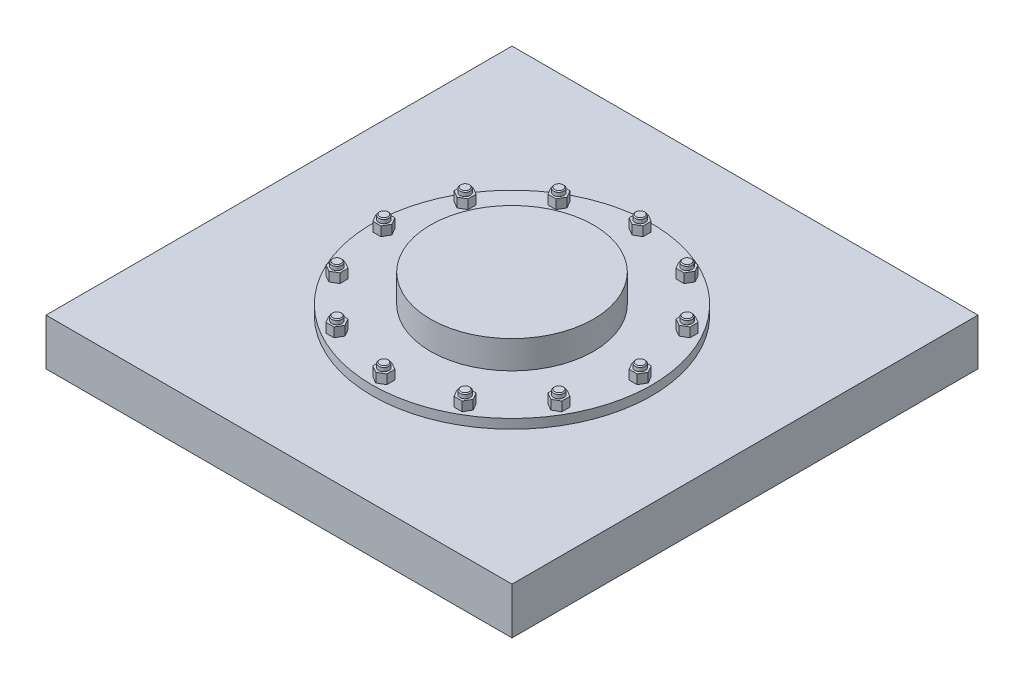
ISO-10303-21;
HEADER;
FILE_DESCRIPTION(('STEP AP214'),'2;1');
FILE_NAME('part.step','',(''),(''),'','','');
FILE_SCHEMA(('AUTOMOTIVE_DESIGN { 1 0 10303 214 1 1 1 1 }'));
ENDSEC;
DATA;
#1=APPLICATION_CONTEXT('core data for automotive mechanical design processes');
#2=APPLICATION_PROTOCOL_DEFINITION('international standard','automotive_design',2000,#1);
#3=PRODUCT_CONTEXT('',#1,'mechanical');
#4=PRODUCT('Part','Part','',(#3));
#5=PRODUCT_RELATED_PRODUCT_CATEGORY('part','',(#4));
#6=PRODUCT_DEFINITION_FORMATION('','',#4);
#7=PRODUCT_DEFINITION_CONTEXT('part definition',#1,'design');
#8=PRODUCT_DEFINITION('design','',#6,#7);
#9=PRODUCT_DEFINITION_SHAPE('','',#8);
#10=(LENGTH_UNIT() NAMED_UNIT(*) SI_UNIT(.MILLI.,.METRE.));
#11=(NAMED_UNIT(*) PLANE_ANGLE_UNIT() SI_UNIT($,.RADIAN.));
#12=(NAMED_UNIT(*) SI_UNIT($,.STERADIAN.) SOLID_ANGLE_UNIT());
#13=UNCERTAINTY_MEASURE_WITH_UNIT(LENGTH_MEASURE(1.E-05),#10,'distance_accuracy_value','');
#14=(GEOMETRIC_REPRESENTATION_CONTEXT(3) GLOBAL_UNCERTAINTY_ASSIGNED_CONTEXT((#13)) GLOBAL_UNIT_ASSIGNED_CONTEXT((#10,
#11,#12)) REPRESENTATION_CONTEXT('',''));
#15=CARTESIAN_POINT('',(0.,0.,0.));
#16=DIRECTION('',(0.,0.,1.));
#17=DIRECTION('',(1.,0.,0.));
#18=AXIS2_PLACEMENT_3D('',#15,#16,#17);
#19=CARTESIAN_POINT('',(0.,120.,0.));
#20=DIRECTION('',(0.,1.,0.));
#21=DIRECTION('',(0.,0.,1.));
#22=AXIS2_PLACEMENT_3D('',#19,#20,#21);
#23=PLANE('',#22);
#24=DIRECTION('',(-1.,0.,0.));
#25=VECTOR('',#24,1.);
#26=CARTESIAN_POINT('',(146.160254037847,120.,-253.156986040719));
#27=LINE('',#26,#25);
#28=CARTESIAN_POINT('',(146.160254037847,120.,-253.156986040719));
#29=VERTEX_POINT('',#28);
#30=CARTESIAN_POINT('',(128.839745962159,120.,-253.156986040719));
#31=VERTEX_POINT('',#30);
#32=EDGE_CURVE('E560',#29,#31,#27,.T.);
#33=ORIENTED_EDGE('',*,*,#32,.F.);
#34=DIRECTION('',(-0.499999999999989,0.,-0.866025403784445));
#35=VECTOR('',#34,1.);
#36=CARTESIAN_POINT('',(154.820508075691,120.,-238.156986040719));
#37=LINE('',#36,#35);
#38=CARTESIAN_POINT('',(154.820508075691,120.,-238.156986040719));
#39=VERTEX_POINT('',#38);
#40=EDGE_CURVE('E538',#39,#29,#37,.T.);
#41=ORIENTED_EDGE('',*,*,#40,.F.);
#42=DIRECTION('',(0.50000000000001,0.,-0.866025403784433));
#43=VECTOR('',#42,1.);
#44=CARTESIAN_POINT('',(146.160254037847,120.,-223.156986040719));
#45=LINE('',#44,#43);
#46=CARTESIAN_POINT('',(146.160254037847,120.,-223.156986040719));
#47=VERTEX_POINT('',#46);
#48=EDGE_CURVE('E547',#47,#39,#45,.T.);
#49=ORIENTED_EDGE('',*,*,#48,.F.);
#50=DIRECTION('',(1.,0.,0.));
#51=VECTOR('',#50,1.);
#52=CARTESIAN_POINT('',(128.839745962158,120.,-223.156986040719));
#53=LINE('',#52,#51);
#54=CARTESIAN_POINT('',(128.839745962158,120.,-223.156986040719));
#55=VERTEX_POINT('',#54);
#56=EDGE_CURVE('E566',#55,#47,#53,.T.);
#57=ORIENTED_EDGE('',*,*,#56,.F.);
#58=DIRECTION('',(0.499999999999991,0.,0.866025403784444));
#59=VECTOR('',#58,1.);
#60=CARTESIAN_POINT('',(120.179491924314,120.,-238.156986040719));
#61=LINE('',#60,#59);
#62=CARTESIAN_POINT('',(120.179491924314,120.,-238.156986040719));
#63=VERTEX_POINT('',#62);
#64=EDGE_CURVE('E564',#63,#55,#61,.T.);
#65=ORIENTED_EDGE('',*,*,#64,.F.);
#66=DIRECTION('',(-0.50000000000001,0.,0.866025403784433));
#67=VECTOR('',#66,1.);
#68=CARTESIAN_POINT('',(128.839745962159,120.,-253.156986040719));
#69=LINE('',#68,#67);
#70=EDGE_CURVE('E562',#31,#63,#69,.T.);
#71=ORIENTED_EDGE('',*,*,#70,.F.);
#72=EDGE_LOOP('',(#33,#41,#49,#57,#65,#71));
#73=FACE_BOUND('',#72,.T.);
#74=DIRECTION('',(-0.500000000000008,0.,0.866025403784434));
#75=VECTOR('',#74,1.);
#76=CARTESIAN_POINT('',(-146.160254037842,120.,-253.156986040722));
#77=LINE('',#76,#75);
#78=CARTESIAN_POINT('',(-146.160254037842,120.,-253.156986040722));
#79=VERTEX_POINT('',#78);
#80=CARTESIAN_POINT('',(-154.820508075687,120.,-238.156986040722));
#81=VERTEX_POINT('',#80);
#82=EDGE_CURVE('E646',#79,#81,#77,.T.);
#83=ORIENTED_EDGE('',*,*,#82,.F.);
#84=DIRECTION('',(-1.,0.,0.));
#85=VECTOR('',#84,1.);
#86=CARTESIAN_POINT('',(-128.839745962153,120.,-253.156986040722));
#87=LINE('',#86,#85);
#88=CARTESIAN_POINT('',(-128.839745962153,120.,-253.156986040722));
#89=VERTEX_POINT('',#88);
#90=EDGE_CURVE('E643',#89,#79,#87,.T.);
#91=ORIENTED_EDGE('',*,*,#90,.F.);
#92=DIRECTION('',(-0.499999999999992,0.,-0.866025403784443));
#93=VECTOR('',#92,1.);
#94=CARTESIAN_POINT('',(-120.179491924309,120.,-238.156986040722));
#95=LINE('',#94,#93);
#96=CARTESIAN_POINT('',(-120.179491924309,120.,-238.156986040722));
#97=VERTEX_POINT('',#96);
#98=EDGE_CURVE('E632',#97,#89,#95,.T.);
#99=ORIENTED_EDGE('',*,*,#98,.F.);
#100=DIRECTION('',(0.50000000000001,0.,-0.866025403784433));
#101=VECTOR('',#100,1.);
#102=CARTESIAN_POINT('',(-128.839745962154,120.,-223.156986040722));
#103=LINE('',#102,#101);
#104=CARTESIAN_POINT('',(-128.839745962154,120.,-223.156986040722));
#105=VERTEX_POINT('',#104);
#106=EDGE_CURVE('E652',#105,#97,#103,.T.);
#107=ORIENTED_EDGE('',*,*,#106,.F.);
#108=DIRECTION('',(1.,0.,0.));
#109=VECTOR('',#108,1.);
#110=CARTESIAN_POINT('',(-146.160254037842,120.,-223.156986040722));
#111=LINE('',#110,#109);
#112=CARTESIAN_POINT('',(-146.160254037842,120.,-223.156986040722));
#113=VERTEX_POINT('',#112);
#114=EDGE_CURVE('E650',#113,#105,#111,.T.);
#115=ORIENTED_EDGE('',*,*,#114,.F.);
#116=DIRECTION('',(0.499999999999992,0.,0.866025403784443));
#117=VECTOR('',#116,1.);
#118=CARTESIAN_POINT('',(-154.820508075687,120.,-238.156986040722));
#119=LINE('',#118,#117);
#120=EDGE_CURVE('E648',#81,#113,#119,.T.);
#121=ORIENTED_EDGE('',*,*,#120,.F.);
#122=EDGE_LOOP('',(#83,#91,#99,#107,#115,#121));
#123=FACE_BOUND('',#122,.T.);
#124=DIRECTION('',(0.500000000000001,0.,0.866025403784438));
#125=VECTOR('',#124,1.);
#126=CARTESIAN_POINT('',(-292.320508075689,120.,0.));
#127=LINE('',#126,#125);
#128=CARTESIAN_POINT('',(-292.320508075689,120.,0.));
#129=VERTEX_POINT('',#128);
#130=CARTESIAN_POINT('',(-283.660254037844,120.,15.));
#131=VERTEX_POINT('',#130);
#132=EDGE_CURVE('E734',#129,#131,#127,.T.);
#133=ORIENTED_EDGE('',*,*,#132,.F.);
#134=DIRECTION('',(-0.500000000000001,0.,0.866025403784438));
#135=VECTOR('',#134,1.);
#136=CARTESIAN_POINT('',(-283.660254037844,120.,-15.));
#137=LINE('',#136,#135);
#138=CARTESIAN_POINT('',(-283.660254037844,120.,-15.));
#139=VERTEX_POINT('',#138);
#140=EDGE_CURVE('E731',#139,#129,#137,.T.);
#141=ORIENTED_EDGE('',*,*,#140,.F.);
#142=DIRECTION('',(-1.,0.,0.));
#143=VECTOR('',#142,1.);
#144=CARTESIAN_POINT('',(-266.339745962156,120.,-15.));
#145=LINE('',#144,#143);
#146=CARTESIAN_POINT('',(-266.339745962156,120.,-15.));
#147=VERTEX_POINT('',#146);
#148=EDGE_CURVE('E720',#147,#139,#145,.T.);
#149=ORIENTED_EDGE('',*,*,#148,.F.);
#150=DIRECTION('',(-0.499999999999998,0.,-0.86602540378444));
#151=VECTOR('',#150,1.);
#152=CARTESIAN_POINT('',(-257.679491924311,120.,0.));
#153=LINE('',#152,#151);
#154=CARTESIAN_POINT('',(-257.679491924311,120.,0.));
#155=VERTEX_POINT('',#154);
#156=EDGE_CURVE('E740',#155,#147,#153,.T.);
#157=ORIENTED_EDGE('',*,*,#156,.F.);
#158=DIRECTION('',(0.499999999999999,0.,-0.866025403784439));
#159=VECTOR('',#158,1.);
#160=CARTESIAN_POINT('',(-266.339745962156,120.,15.));
#161=LINE('',#160,#159);
#162=CARTESIAN_POINT('',(-266.339745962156,120.,15.));
#163=VERTEX_POINT('',#162);
#164=EDGE_CURVE('E738',#163,#155,#161,.T.);
#165=ORIENTED_EDGE('',*,*,#164,.F.);
#166=DIRECTION('',(1.,0.,0.));
#167=VECTOR('',#166,1.);
#168=CARTESIAN_POINT('',(-283.660254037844,120.,15.));
#169=LINE('',#168,#167);
#170=EDGE_CURVE('E736',#131,#163,#169,.T.);
#171=ORIENTED_EDGE('',*,*,#170,.F.);
#172=EDGE_LOOP('',(#133,#141,#149,#157,#165,#171));
#173=FACE_BOUND('',#172,.T.);
#174=DIRECTION('',(1.,0.,0.));
#175=VECTOR('',#174,1.);
#176=CARTESIAN_POINT('',(-146.160254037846,120.,253.15698604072));
#177=LINE('',#176,#175);
#178=CARTESIAN_POINT('',(-146.160254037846,120.,253.15698604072));
#179=VERTEX_POINT('',#178);
#180=CARTESIAN_POINT('',(-128.839745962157,120.,253.15698604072));
#181=VERTEX_POINT('',#180);
#182=EDGE_CURVE('E822',#179,#181,#177,.T.);
#183=ORIENTED_EDGE('',*,*,#182,.F.);
#184=DIRECTION('',(0.499999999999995,0.,0.866025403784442));
#185=VECTOR('',#184,1.);
#186=CARTESIAN_POINT('',(-154.82050807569,120.,238.15698604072));
#187=LINE('',#186,#185);
#188=CARTESIAN_POINT('',(-154.82050807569,120.,238.15698604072));
#189=VERTEX_POINT('',#188);
#190=EDGE_CURVE('E819',#189,#179,#187,.T.);
#191=ORIENTED_EDGE('',*,*,#190,.F.);
#192=DIRECTION('',(-0.500000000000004,0.,0.866025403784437));
#193=VECTOR('',#192,1.);
#194=CARTESIAN_POINT('',(-146.160254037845,120.,223.15698604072));
#195=LINE('',#194,#193);
#196=CARTESIAN_POINT('',(-146.160254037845,120.,223.15698604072));
#197=VERTEX_POINT('',#196);
#198=EDGE_CURVE('E808',#197,#189,#195,.T.);
#199=ORIENTED_EDGE('',*,*,#198,.F.);
#200=DIRECTION('',(-1.,0.,0.));
#201=VECTOR('',#200,1.);
#202=CARTESIAN_POINT('',(-128.839745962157,120.,223.15698604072));
#203=LINE('',#202,#201);
#204=CARTESIAN_POINT('',(-128.839745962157,120.,223.15698604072));
#205=VERTEX_POINT('',#204);
#206=EDGE_CURVE('E828',#205,#197,#203,.T.);
#207=ORIENTED_EDGE('',*,*,#206,.F.);
#208=DIRECTION('',(-0.499999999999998,0.,-0.86602540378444));
#209=VECTOR('',#208,1.);
#210=CARTESIAN_POINT('',(-120.179491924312,120.,238.15698604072));
#211=LINE('',#210,#209);
#212=CARTESIAN_POINT('',(-120.179491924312,120.,238.15698604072));
#213=VERTEX_POINT('',#212);
#214=EDGE_CURVE('E826',#213,#205,#211,.T.);
#215=ORIENTED_EDGE('',*,*,#214,.F.);
#216=DIRECTION('',(0.500000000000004,0.,-0.866025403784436));
#217=VECTOR('',#216,1.);
#218=CARTESIAN_POINT('',(-128.839745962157,120.,253.15698604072));
#219=LINE('',#218,#217);
#220=EDGE_CURVE('E824',#181,#213,#219,.T.);
#221=ORIENTED_EDGE('',*,*,#220,.F.);
#222=EDGE_LOOP('',(#183,#191,#199,#207,#215,#221));
#223=FACE_BOUND('',#222,.T.);
#224=DIRECTION('',(0.500000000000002,0.,-0.866025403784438));
#225=VECTOR('',#224,1.);
#226=CARTESIAN_POINT('',(146.160254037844,120.,253.156986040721));
#227=LINE('',#226,#225);
#228=CARTESIAN_POINT('',(146.160254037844,120.,253.156986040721));
#229=VERTEX_POINT('',#228);
#230=CARTESIAN_POINT('',(154.820508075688,120.,238.156986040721));
#231=VERTEX_POINT('',#230);
#232=EDGE_CURVE('E910',#229,#231,#227,.T.);
#233=ORIENTED_EDGE('',*,*,#232,.F.);
#234=DIRECTION('',(1.,0.,0.));
#235=VECTOR('',#234,1.);
#236=CARTESIAN_POINT('',(128.839745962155,120.,253.156986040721));
#237=LINE('',#236,#235);
#238=CARTESIAN_POINT('',(128.839745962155,120.,253.156986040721));
#239=VERTEX_POINT('',#238);
#240=EDGE_CURVE('E907',#239,#229,#237,.T.);
#241=ORIENTED_EDGE('',*,*,#240,.F.);
#242=DIRECTION('',(0.499999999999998,0.,0.86602540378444));
#243=VECTOR('',#242,1.);
#244=CARTESIAN_POINT('',(120.179491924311,120.,238.156986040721));
#245=LINE('',#244,#243);
#246=CARTESIAN_POINT('',(120.179491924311,120.,238.156986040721));
#247=VERTEX_POINT('',#246);
#248=EDGE_CURVE('E896',#247,#239,#245,.T.);
#249=ORIENTED_EDGE('',*,*,#248,.F.);
#250=DIRECTION('',(-0.500000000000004,0.,0.866025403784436));
#251=VECTOR('',#250,1.);
#252=CARTESIAN_POINT('',(128.839745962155,120.,223.156986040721));
#253=LINE('',#252,#251);
#254=CARTESIAN_POINT('',(128.839745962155,120.,223.156986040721));
#255=VERTEX_POINT('',#254);
#256=EDGE_CURVE('E916',#255,#247,#253,.T.);
#257=ORIENTED_EDGE('',*,*,#256,.F.);
#258=DIRECTION('',(-1.,0.,0.));
#259=VECTOR('',#258,1.);
#260=CARTESIAN_POINT('',(146.160254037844,120.,223.156986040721));
#261=LINE('',#260,#259);
#262=CARTESIAN_POINT('',(146.160254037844,120.,223.156986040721));
#263=VERTEX_POINT('',#262);
#264=EDGE_CURVE('E914',#263,#255,#261,.T.);
#265=ORIENTED_EDGE('',*,*,#264,.F.);
#266=DIRECTION('',(-0.499999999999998,0.,-0.86602540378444));
#267=VECTOR('',#266,1.);
#268=CARTESIAN_POINT('',(154.820508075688,120.,238.156986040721));
#269=LINE('',#268,#267);
#270=EDGE_CURVE('E912',#231,#263,#269,.T.);
#271=ORIENTED_EDGE('',*,*,#270,.F.);
#272=EDGE_LOOP('',(#233,#241,#249,#257,#265,#271));
#273=FACE_BOUND('',#272,.T.);
#274=CARTESIAN_POINT('',(0.,120.,0.));
#275=DIRECTION('',(0.,1.,0.));
#276=DIRECTION('',(0.,0.,1.));
#277=AXIS2_PLACEMENT_3D('',#274,#275,#276);
#278=CIRCLE('',#277,300.);
#279=CARTESIAN_POINT('',(0.,120.,300.));
#280=VERTEX_POINT('',#279);
#281=EDGE_CURVE('E1031',#280,#280,#278,.T.);
#282=ORIENTED_EDGE('',*,*,#281,.T.);
#283=EDGE_LOOP('',(#282));
#284=FACE_BOUND('',#283,.T.);
#285=CARTESIAN_POINT('',(0.,120.,0.));
#286=DIRECTION('',(0.,1.,0.));
#287=DIRECTION('',(0.,0.,1.));
#288=AXIS2_PLACEMENT_3D('',#285,#286,#287);
#289=CIRCLE('',#288,175.);
#290=CARTESIAN_POINT('',(0.,120.,175.));
#291=VERTEX_POINT('',#290);
#292=EDGE_CURVE('E1028',#291,#291,#289,.T.);
#293=ORIENTED_EDGE('',*,*,#292,.F.);
#294=EDGE_LOOP('',(#293));
#295=FACE_BOUND('',#294,.T.);
#296=DIRECTION('',(-0.500000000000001,0.,-0.866025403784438));
#297=VECTOR('',#296,1.);
#298=CARTESIAN_POINT('',(292.320508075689,120.,0.));
#299=LINE('',#298,#297);
#300=CARTESIAN_POINT('',(292.320508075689,120.,0.));
#301=VERTEX_POINT('',#300);
#302=CARTESIAN_POINT('',(283.660254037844,120.,-15.));
#303=VERTEX_POINT('',#302);
#304=EDGE_CURVE('E998',#301,#303,#299,.T.);
#305=ORIENTED_EDGE('',*,*,#304,.F.);
#306=DIRECTION('',(0.500000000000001,0.,-0.866025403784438));
#307=VECTOR('',#306,1.);
#308=CARTESIAN_POINT('',(283.660254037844,120.,15.));
#309=LINE('',#308,#307);
#310=CARTESIAN_POINT('',(283.660254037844,120.,15.));
#311=VERTEX_POINT('',#310);
#312=EDGE_CURVE('E995',#311,#301,#309,.T.);
#313=ORIENTED_EDGE('',*,*,#312,.F.);
#314=DIRECTION('',(1.,0.,0.));
#315=VECTOR('',#314,1.);
#316=CARTESIAN_POINT('',(266.339745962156,120.,15.));
#317=LINE('',#316,#315);
#318=CARTESIAN_POINT('',(266.339745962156,120.,15.));
#319=VERTEX_POINT('',#318);
#320=EDGE_CURVE('E984',#319,#311,#317,.T.);
#321=ORIENTED_EDGE('',*,*,#320,.F.);
#322=DIRECTION('',(0.499999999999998,0.,0.86602540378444));
#323=VECTOR('',#322,1.);
#324=CARTESIAN_POINT('',(257.679491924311,120.,0.));
#325=LINE('',#324,#323);
#326=CARTESIAN_POINT('',(257.679491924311,120.,0.));
#327=VERTEX_POINT('',#326);
#328=EDGE_CURVE('E1004',#327,#319,#325,.T.);
#329=ORIENTED_EDGE('',*,*,#328,.F.);
#330=DIRECTION('',(-0.499999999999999,0.,0.866025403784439));
#331=VECTOR('',#330,1.);
#332=CARTESIAN_POINT('',(266.339745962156,120.,-15.));
#333=LINE('',#332,#331);
#334=CARTESIAN_POINT('',(266.339745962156,120.,-15.));
#335=VERTEX_POINT('',#334);
#336=EDGE_CURVE('E1002',#335,#327,#333,.T.);
#337=ORIENTED_EDGE('',*,*,#336,.F.);
#338=DIRECTION('',(-1.,0.,0.));
#339=VECTOR('',#338,1.);
#340=CARTESIAN_POINT('',(283.660254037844,120.,-15.));
#341=LINE('',#340,#339);
#342=EDGE_CURVE('E1000',#303,#335,#341,.T.);
#343=ORIENTED_EDGE('',*,*,#342,.F.);
#344=EDGE_LOOP('',(#305,#313,#321,#329,#337,#343));
#345=FACE_BOUND('',#344,.T.);
#346=DIRECTION('',(0.,0.,-1.));
#347=VECTOR('',#346,1.);
#348=CARTESIAN_POINT('',(253.15698604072,120.,146.160254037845));
#349=LINE('',#348,#347);
#350=CARTESIAN_POINT('',(253.15698604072,120.,146.160254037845));
#351=VERTEX_POINT('',#350);
#352=CARTESIAN_POINT('',(253.156986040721,120.,128.839745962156));
#353=VERTEX_POINT('',#352);
#354=EDGE_CURVE('E954',#351,#353,#349,.T.);
#355=ORIENTED_EDGE('',*,*,#354,.F.);
#356=DIRECTION('',(0.86602540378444,0.,-0.499999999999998));
#357=VECTOR('',#356,1.);
#358=CARTESIAN_POINT('',(238.15698604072,120.,154.820508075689));
#359=LINE('',#358,#357);
#360=CARTESIAN_POINT('',(238.15698604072,120.,154.820508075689));
#361=VERTEX_POINT('',#360);
#362=EDGE_CURVE('E951',#361,#351,#359,.T.);
#363=ORIENTED_EDGE('',*,*,#362,.F.);
#364=DIRECTION('',(0.866025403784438,0.,0.500000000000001));
#365=VECTOR('',#364,1.);
#366=CARTESIAN_POINT('',(223.15698604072,120.,146.160254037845));
#367=LINE('',#366,#365);
#368=CARTESIAN_POINT('',(223.15698604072,120.,146.160254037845));
#369=VERTEX_POINT('',#368);
#370=EDGE_CURVE('E940',#369,#361,#367,.T.);
#371=ORIENTED_EDGE('',*,*,#370,.F.);
#372=DIRECTION('',(0.,0.,1.));
#373=VECTOR('',#372,1.);
#374=CARTESIAN_POINT('',(223.15698604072,120.,128.839745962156));
#375=LINE('',#374,#373);
#376=CARTESIAN_POINT('',(223.15698604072,120.,128.839745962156));
#377=VERTEX_POINT('',#376);
#378=EDGE_CURVE('E960',#377,#369,#375,.T.);
#379=ORIENTED_EDGE('',*,*,#378,.F.);
#380=DIRECTION('',(-0.866025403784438,0.,0.5));
#381=VECTOR('',#380,1.);
#382=CARTESIAN_POINT('',(238.156986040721,120.,120.179491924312));
#383=LINE('',#382,#381);
#384=CARTESIAN_POINT('',(238.156986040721,120.,120.179491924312));
#385=VERTEX_POINT('',#384);
#386=EDGE_CURVE('E958',#385,#377,#383,.T.);
#387=ORIENTED_EDGE('',*,*,#386,.F.);
#388=DIRECTION('',(-0.866025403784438,0.,-0.500000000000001));
#389=VECTOR('',#388,1.);
#390=CARTESIAN_POINT('',(253.156986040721,120.,128.839745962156));
#391=LINE('',#390,#389);
#392=EDGE_CURVE('E956',#353,#385,#391,.T.);
#393=ORIENTED_EDGE('',*,*,#392,.F.);
#394=EDGE_LOOP('',(#355,#363,#371,#379,#387,#393));
#395=FACE_BOUND('',#394,.T.);
#396=DIRECTION('',(0.86602540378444,0.,-0.499999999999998));
#397=VECTOR('',#396,1.);
#398=CARTESIAN_POINT('',(-9.68664324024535E-13,120.,292.320508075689));
#399=LINE('',#398,#397);
#400=CARTESIAN_POINT('',(-9.68664324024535E-13,120.,292.320508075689));
#401=VERTEX_POINT('',#400);
#402=CARTESIAN_POINT('',(14.999999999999,120.,283.660254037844));
#403=VERTEX_POINT('',#402);
#404=EDGE_CURVE('E866',#401,#403,#399,.T.);
#405=ORIENTED_EDGE('',*,*,#404,.F.);
#406=DIRECTION('',(0.866025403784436,0.,0.500000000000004));
#407=VECTOR('',#406,1.);
#408=CARTESIAN_POINT('',(-15.000000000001,120.,283.660254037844));
#409=LINE('',#408,#407);
#410=CARTESIAN_POINT('',(-15.000000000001,120.,283.660254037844));
#411=VERTEX_POINT('',#410);
#412=EDGE_CURVE('E863',#411,#401,#409,.T.);
#413=ORIENTED_EDGE('',*,*,#412,.F.);
#414=DIRECTION('',(0.,0.,1.));
#415=VECTOR('',#414,1.);
#416=CARTESIAN_POINT('',(-15.0000000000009,120.,266.339745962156));
#417=LINE('',#416,#415);
#418=CARTESIAN_POINT('',(-15.0000000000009,120.,266.339745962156));
#419=VERTEX_POINT('',#418);
#420=EDGE_CURVE('E852',#419,#411,#417,.T.);
#421=ORIENTED_EDGE('',*,*,#420,.F.);
#422=DIRECTION('',(-0.866025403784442,0.,0.499999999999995));
#423=VECTOR('',#422,1.);
#424=CARTESIAN_POINT('',(-9.29516097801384E-13,120.,257.679491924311));
#425=LINE('',#424,#423);
#426=CARTESIAN_POINT('',(-9.29516097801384E-13,120.,257.679491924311));
#427=VERTEX_POINT('',#426);
#428=EDGE_CURVE('E872',#427,#419,#425,.T.);
#429=ORIENTED_EDGE('',*,*,#428,.F.);
#430=DIRECTION('',(-0.866025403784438,0.,-0.500000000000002));
#431=VECTOR('',#430,1.);
#432=CARTESIAN_POINT('',(14.9999999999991,120.,266.339745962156));
#433=LINE('',#432,#431);
#434=CARTESIAN_POINT('',(14.9999999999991,120.,266.339745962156));
#435=VERTEX_POINT('',#434);
#436=EDGE_CURVE('E870',#435,#427,#433,.T.);
#437=ORIENTED_EDGE('',*,*,#436,.F.);
#438=DIRECTION('',(0.,0.,-1.));
#439=VECTOR('',#438,1.);
#440=CARTESIAN_POINT('',(14.999999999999,120.,283.660254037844));
#441=LINE('',#440,#439);
#442=EDGE_CURVE('E868',#403,#435,#441,.T.);
#443=ORIENTED_EDGE('',*,*,#442,.F.);
#444=EDGE_LOOP('',(#405,#413,#421,#429,#437,#443));
#445=FACE_BOUND('',#444,.T.);
#446=DIRECTION('',(0.866025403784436,0.,0.500000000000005));
#447=VECTOR('',#446,1.);
#448=CARTESIAN_POINT('',(-253.156986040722,120.,146.160254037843));
#449=LINE('',#448,#447);
#450=CARTESIAN_POINT('',(-253.156986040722,120.,146.160254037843));
#451=VERTEX_POINT('',#450);
#452=CARTESIAN_POINT('',(-238.156986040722,120.,154.820508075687));
#453=VERTEX_POINT('',#452);
#454=EDGE_CURVE('E778',#451,#453,#449,.T.);
#455=ORIENTED_EDGE('',*,*,#454,.F.);
#456=DIRECTION('',(0.,0.,1.));
#457=VECTOR('',#456,1.);
#458=CARTESIAN_POINT('',(-253.156986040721,120.,128.839745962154));
#459=LINE('',#458,#457);
#460=CARTESIAN_POINT('',(-253.156986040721,120.,128.839745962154));
#461=VERTEX_POINT('',#460);
#462=EDGE_CURVE('E775',#461,#451,#459,.T.);
#463=ORIENTED_EDGE('',*,*,#462,.F.);
#464=DIRECTION('',(-0.866025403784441,0.,0.499999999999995));
#465=VECTOR('',#464,1.);
#466=CARTESIAN_POINT('',(-238.156986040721,120.,120.17949192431));
#467=LINE('',#466,#465);
#468=CARTESIAN_POINT('',(-238.156986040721,120.,120.17949192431));
#469=VERTEX_POINT('',#468);
#470=EDGE_CURVE('E764',#469,#461,#467,.T.);
#471=ORIENTED_EDGE('',*,*,#470,.F.);
#472=DIRECTION('',(-0.866025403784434,0.,-0.500000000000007));
#473=VECTOR('',#472,1.);
#474=CARTESIAN_POINT('',(-223.156986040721,120.,128.839745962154));
#475=LINE('',#474,#473);
#476=CARTESIAN_POINT('',(-223.156986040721,120.,128.839745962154));
#477=VERTEX_POINT('',#476);
#478=EDGE_CURVE('E784',#477,#469,#475,.T.);
#479=ORIENTED_EDGE('',*,*,#478,.F.);
#480=DIRECTION('',(0.,0.,-1.));
#481=VECTOR('',#480,1.);
#482=CARTESIAN_POINT('',(-223.156986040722,120.,146.160254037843));
#483=LINE('',#482,#481);
#484=CARTESIAN_POINT('',(-223.156986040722,120.,146.160254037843));
#485=VERTEX_POINT('',#484);
#486=EDGE_CURVE('E782',#485,#477,#483,.T.);
#487=ORIENTED_EDGE('',*,*,#486,.F.);
#488=DIRECTION('',(0.866025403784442,0.,-0.499999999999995));
#489=VECTOR('',#488,1.);
#490=CARTESIAN_POINT('',(-238.156986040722,120.,154.820508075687));
#491=LINE('',#490,#489);
#492=EDGE_CURVE('E780',#453,#485,#491,.T.);
#493=ORIENTED_EDGE('',*,*,#492,.F.);
#494=EDGE_LOOP('',(#455,#463,#471,#479,#487,#493));
#495=FACE_BOUND('',#494,.T.);
#496=DIRECTION('',(0.,0.,1.));
#497=VECTOR('',#496,1.);
#498=CARTESIAN_POINT('',(-253.156986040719,120.,-146.160254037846));
#499=LINE('',#498,#497);
#500=CARTESIAN_POINT('',(-253.156986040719,120.,-146.160254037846));
#501=VERTEX_POINT('',#500);
#502=CARTESIAN_POINT('',(-253.15698604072,120.,-128.839745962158));
#503=VERTEX_POINT('',#502);
#504=EDGE_CURVE('E690',#501,#503,#499,.T.);
#505=ORIENTED_EDGE('',*,*,#504,.F.);
#506=DIRECTION('',(-0.866025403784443,0.,0.499999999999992));
#507=VECTOR('',#506,1.);
#508=CARTESIAN_POINT('',(-238.156986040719,120.,-154.820508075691));
#509=LINE('',#508,#507);
#510=CARTESIAN_POINT('',(-238.156986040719,120.,-154.820508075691));
#511=VERTEX_POINT('',#510);
#512=EDGE_CURVE('E687',#511,#501,#509,.T.);
#513=ORIENTED_EDGE('',*,*,#512,.F.);
#514=DIRECTION('',(-0.866025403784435,0.,-0.500000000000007));
#515=VECTOR('',#514,1.);
#516=CARTESIAN_POINT('',(-223.156986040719,120.,-146.160254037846));
#517=LINE('',#516,#515);
#518=CARTESIAN_POINT('',(-223.156986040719,120.,-146.160254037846));
#519=VERTEX_POINT('',#518);
#520=EDGE_CURVE('E676',#519,#511,#517,.T.);
#521=ORIENTED_EDGE('',*,*,#520,.F.);
#522=DIRECTION('',(0.,0.,-1.));
#523=VECTOR('',#522,1.);
#524=CARTESIAN_POINT('',(-223.15698604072,120.,-128.839745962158));
#525=LINE('',#524,#523);
#526=CARTESIAN_POINT('',(-223.15698604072,120.,-128.839745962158));
#527=VERTEX_POINT('',#526);
#528=EDGE_CURVE('E696',#527,#519,#525,.T.);
#529=ORIENTED_EDGE('',*,*,#528,.F.);
#530=DIRECTION('',(0.866025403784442,0.,-0.499999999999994));
#531=VECTOR('',#530,1.);
#532=CARTESIAN_POINT('',(-238.15698604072,120.,-120.179491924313));
#533=LINE('',#532,#531);
#534=CARTESIAN_POINT('',(-238.15698604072,120.,-120.179491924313));
#535=VERTEX_POINT('',#534);
#536=EDGE_CURVE('E694',#535,#527,#533,.T.);
#537=ORIENTED_EDGE('',*,*,#536,.F.);
#538=DIRECTION('',(0.866025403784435,0.,0.500000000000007));
#539=VECTOR('',#538,1.);
#540=CARTESIAN_POINT('',(-253.15698604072,120.,-128.839745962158));
#541=LINE('',#540,#539);
#542=EDGE_CURVE('E692',#503,#535,#541,.T.);
#543=ORIENTED_EDGE('',*,*,#542,.F.);
#544=EDGE_LOOP('',(#505,#513,#521,#529,#537,#543));
#545=FACE_BOUND('',#544,.T.);
#546=DIRECTION('',(-0.866025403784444,0.,0.499999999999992));
#547=VECTOR('',#546,1.);
#548=CARTESIAN_POINT('',(3.00992752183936E-12,120.,-292.320508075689));
#549=LINE('',#548,#547);
#550=CARTESIAN_POINT('',(3.00992752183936E-12,120.,-292.320508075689));
#551=VERTEX_POINT('',#550);
#552=CARTESIAN_POINT('',(-14.999999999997,120.,-283.660254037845));
#553=VERTEX_POINT('',#552);
#554=EDGE_CURVE('E602',#551,#553,#549,.T.);
#555=ORIENTED_EDGE('',*,*,#554,.F.);
#556=DIRECTION('',(-0.866025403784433,0.,-0.50000000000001));
#557=VECTOR('',#556,1.);
#558=CARTESIAN_POINT('',(15.000000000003,120.,-283.660254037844));
#559=LINE('',#558,#557);
#560=CARTESIAN_POINT('',(15.000000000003,120.,-283.660254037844));
#561=VERTEX_POINT('',#560);
#562=EDGE_CURVE('E599',#561,#551,#559,.T.);
#563=ORIENTED_EDGE('',*,*,#562,.F.);
#564=DIRECTION('',(0.,0.,-1.));
#565=VECTOR('',#564,1.);
#566=CARTESIAN_POINT('',(15.0000000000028,120.,-266.339745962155));
#567=LINE('',#566,#565);
#568=CARTESIAN_POINT('',(15.0000000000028,120.,-266.339745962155));
#569=VERTEX_POINT('',#568);
#570=EDGE_CURVE('E588',#569,#561,#567,.T.);
#571=ORIENTED_EDGE('',*,*,#570,.F.);
#572=DIRECTION('',(0.866025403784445,0.,-0.499999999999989));
#573=VECTOR('',#572,1.);
#574=CARTESIAN_POINT('',(2.72888237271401E-12,120.,-257.679491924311));
#575=LINE('',#574,#573);
#576=CARTESIAN_POINT('',(2.72888237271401E-12,120.,-257.679491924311));
#577=VERTEX_POINT('',#576);
#578=EDGE_CURVE('E608',#577,#569,#575,.T.);
#579=ORIENTED_EDGE('',*,*,#578,.F.);
#580=DIRECTION('',(0.866025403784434,0.,0.500000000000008));
#581=VECTOR('',#580,1.);
#582=CARTESIAN_POINT('',(-14.9999999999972,120.,-266.339745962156));
#583=LINE('',#582,#581);
#584=CARTESIAN_POINT('',(-14.9999999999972,120.,-266.339745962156));
#585=VERTEX_POINT('',#584);
#586=EDGE_CURVE('E606',#585,#577,#583,.T.);
#587=ORIENTED_EDGE('',*,*,#586,.F.);
#588=DIRECTION('',(0.,0.,1.));
#589=VECTOR('',#588,1.);
#590=CARTESIAN_POINT('',(-14.999999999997,120.,-283.660254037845));
#591=LINE('',#590,#589);
#592=EDGE_CURVE('E604',#553,#585,#591,.T.);
#593=ORIENTED_EDGE('',*,*,#592,.F.);
#594=EDGE_LOOP('',(#555,#563,#571,#579,#587,#593));
#595=FACE_BOUND('',#594,.T.);
#596=DIRECTION('',(-0.866025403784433,0.,-0.500000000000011));
#597=VECTOR('',#596,1.);
#598=CARTESIAN_POINT('',(253.156986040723,120.,-146.160254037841));
#599=LINE('',#598,#597);
#600=CARTESIAN_POINT('',(253.156986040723,120.,-146.160254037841));
#601=VERTEX_POINT('',#600);
#602=CARTESIAN_POINT('',(238.156986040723,120.,-154.820508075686));
#603=VERTEX_POINT('',#602);
#604=EDGE_CURVE('E1435',#601,#603,#599,.T.);
#605=ORIENTED_EDGE('',*,*,#604,.F.);
#606=DIRECTION('',(0.,0.,-1.));
#607=VECTOR('',#606,1.);
#608=CARTESIAN_POINT('',(253.156986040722,120.,-128.839745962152));
#609=LINE('',#608,#607);
#610=CARTESIAN_POINT('',(253.156986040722,120.,-128.839745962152));
#611=VERTEX_POINT('',#610);
#612=EDGE_CURVE('E534',#611,#601,#609,.T.);
#613=ORIENTED_EDGE('',*,*,#612,.F.);
#614=DIRECTION('',(0.866025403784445,0.,-0.499999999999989));
#615=VECTOR('',#614,1.);
#616=CARTESIAN_POINT('',(238.156986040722,120.,-120.179491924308));
#617=LINE('',#616,#615);
#618=CARTESIAN_POINT('',(238.156986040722,120.,-120.179491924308));
#619=VERTEX_POINT('',#618);
#620=EDGE_CURVE('E530',#619,#611,#617,.T.);
#621=ORIENTED_EDGE('',*,*,#620,.F.);
#622=DIRECTION('',(0.866025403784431,0.,0.500000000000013));
#623=VECTOR('',#622,1.);
#624=CARTESIAN_POINT('',(223.156986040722,120.,-128.839745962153));
#625=LINE('',#624,#623);
#626=CARTESIAN_POINT('',(223.156986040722,120.,-128.839745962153));
#627=VERTEX_POINT('',#626);
#628=EDGE_CURVE('E1446',#627,#619,#625,.T.);
#629=ORIENTED_EDGE('',*,*,#628,.F.);
#630=DIRECTION('',(0.,0.,1.));
#631=VECTOR('',#630,1.);
#632=CARTESIAN_POINT('',(223.156986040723,120.,-146.160254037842));
#633=LINE('',#632,#631);
#634=CARTESIAN_POINT('',(223.156986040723,120.,-146.160254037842));
#635=VERTEX_POINT('',#634);
#636=EDGE_CURVE('E1440',#635,#627,#633,.T.);
#637=ORIENTED_EDGE('',*,*,#636,.F.);
#638=DIRECTION('',(-0.866025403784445,0.,0.499999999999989));
#639=VECTOR('',#638,1.);
#640=CARTESIAN_POINT('',(238.156986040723,120.,-154.820508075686));
#641=LINE('',#640,#639);
#642=EDGE_CURVE('E1438',#603,#635,#641,.T.);
#643=ORIENTED_EDGE('',*,*,#642,.F.);
#644=EDGE_LOOP('',(#605,#613,#621,#629,#637,#643));
#645=FACE_BOUND('',#644,.T.);
#646=ADVANCED_FACE('F34',(#73,#123,#173,#223,#273,#284,#295,#345,#395,#445,#495,#545,#595,#645),
#23,.T.);
#647=CARTESIAN_POINT('',(0.,100.,0.));
#648=DIRECTION('',(0.,1.,0.));
#649=DIRECTION('',(0.,0.,1.));
#650=AXIS2_PLACEMENT_3D('',#647,#648,#649);
#651=PLANE('',#650);
#652=DIRECTION('',(0.,0.,1.));
#653=VECTOR('',#652,1.);
#654=CARTESIAN_POINT('',(-500.,100.,-500.));
#655=LINE('',#654,#653);
#656=CARTESIAN_POINT('',(-500.,100.,-500.));
#657=VERTEX_POINT('',#656);
#658=CARTESIAN_POINT('',(-500.,100.,500.));
#659=VERTEX_POINT('',#658);
#660=EDGE_CURVE('E1037',#657,#659,#655,.T.);
#661=ORIENTED_EDGE('',*,*,#660,.T.);
#662=DIRECTION('',(1.,0.,0.));
#663=VECTOR('',#662,1.);
#664=CARTESIAN_POINT('',(-500.,100.,500.));
#665=LINE('',#664,#663);
#666=CARTESIAN_POINT('',(500.,100.,500.));
#667=VERTEX_POINT('',#666);
#668=EDGE_CURVE('E1040',#659,#667,#665,.T.);
#669=ORIENTED_EDGE('',*,*,#668,.T.);
#670=DIRECTION('',(0.,0.,-1.));
#671=VECTOR('',#670,1.);
#672=CARTESIAN_POINT('',(500.,100.,-500.));
#673=LINE('',#672,#671);
#674=CARTESIAN_POINT('',(500.,100.,-500.));
#675=VERTEX_POINT('',#674);
#676=EDGE_CURVE('E1043',#667,#675,#673,.T.);
#677=ORIENTED_EDGE('',*,*,#676,.T.);
#678=DIRECTION('',(-1.,0.,0.));
#679=VECTOR('',#678,1.);
#680=CARTESIAN_POINT('',(-500.,100.,-500.));
#681=LINE('',#680,#679);
#682=EDGE_CURVE('E1045',#675,#657,#681,.T.);
#683=ORIENTED_EDGE('',*,*,#682,.T.);
#684=EDGE_LOOP('',(#661,#669,#677,#683));
#685=FACE_BOUND('',#684,.T.);
#686=CARTESIAN_POINT('',(0.,100.,0.));
#687=DIRECTION('',(0.,1.,0.));
#688=DIRECTION('',(0.,0.,1.));
#689=AXIS2_PLACEMENT_3D('',#686,#687,#688);
#690=CIRCLE('',#689,300.);
#691=CARTESIAN_POINT('',(0.,100.,300.));
#692=VERTEX_POINT('',#691);
#693=EDGE_CURVE('E1027',#692,#692,#690,.T.);
#694=ORIENTED_EDGE('',*,*,#693,.F.);
#695=EDGE_LOOP('',(#694));
#696=FACE_BOUND('',#695,.T.);
#697=ADVANCED_FACE('F1178',(#685,#696),#651,.T.);
#698=CARTESIAN_POINT('',(-500.,100.,-500.));
#699=DIRECTION('',(1.,0.,0.));
#700=DIRECTION('',(0.,0.,-1.));
#701=AXIS2_PLACEMENT_3D('',#698,#699,#700);
#702=PLANE('',#701);
#703=DIRECTION('',(0.,0.,1.));
#704=VECTOR('',#703,1.);
#705=CARTESIAN_POINT('',(-500.,0.,-500.));
#706=LINE('',#705,#704);
#707=CARTESIAN_POINT('',(-500.,0.,-500.));
#708=VERTEX_POINT('',#707);
#709=CARTESIAN_POINT('',(-500.,0.,500.));
#710=VERTEX_POINT('',#709);
#711=EDGE_CURVE('E1034',#708,#710,#706,.T.);
#712=ORIENTED_EDGE('',*,*,#711,.T.);
#713=DIRECTION('',(0.,-1.,0.));
#714=VECTOR('',#713,1.);
#715=CARTESIAN_POINT('',(-500.,100.,500.));
#716=LINE('',#715,#714);
#717=EDGE_CURVE('E1063',#659,#710,#716,.T.);
#718=ORIENTED_EDGE('',*,*,#717,.F.);
#719=ORIENTED_EDGE('',*,*,#660,.F.);
#720=DIRECTION('',(0.,-1.,0.));
#721=VECTOR('',#720,1.);
#722=CARTESIAN_POINT('',(-500.,100.,-500.));
#723=LINE('',#722,#721);
#724=EDGE_CURVE('E1047',#657,#708,#723,.T.);
#725=ORIENTED_EDGE('',*,*,#724,.T.);
#726=EDGE_LOOP('',(#712,#718,#719,#725));
#727=FACE_BOUND('',#726,.T.);
#728=ADVANCED_FACE('F1184',(#727),#702,.F.);
#729=CARTESIAN_POINT('',(-500.,100.,500.));
#730=DIRECTION('',(0.,0.,-1.));
#731=DIRECTION('',(-1.,0.,0.));
#732=AXIS2_PLACEMENT_3D('',#729,#730,#731);
#733=PLANE('',#732);
#734=DIRECTION('',(1.,0.,0.));
#735=VECTOR('',#734,1.);
#736=CARTESIAN_POINT('',(-500.,0.,500.));
#737=LINE('',#736,#735);
#738=CARTESIAN_POINT('',(500.,0.,500.));
#739=VERTEX_POINT('',#738);
#740=EDGE_CURVE('E1050',#710,#739,#737,.T.);
#741=ORIENTED_EDGE('',*,*,#740,.T.);
#742=DIRECTION('',(0.,-1.,0.));
#743=VECTOR('',#742,1.);
#744=CARTESIAN_POINT('',(500.,100.,500.));
#745=LINE('',#744,#743);
#746=EDGE_CURVE('E1060',#667,#739,#745,.T.);
#747=ORIENTED_EDGE('',*,*,#746,.F.);
#748=ORIENTED_EDGE('',*,*,#668,.F.);
#749=ORIENTED_EDGE('',*,*,#717,.T.);
#750=EDGE_LOOP('',(#741,#747,#748,#749));
#751=FACE_BOUND('',#750,.T.);
#752=ADVANCED_FACE('F1208',(#751),#733,.F.);
#753=CARTESIAN_POINT('',(500.,100.,-500.));
#754=DIRECTION('',(-1.,0.,0.));
#755=DIRECTION('',(0.,0.,1.));
#756=AXIS2_PLACEMENT_3D('',#753,#754,#755);
#757=PLANE('',#756);
#758=DIRECTION('',(0.,0.,-1.));
#759=VECTOR('',#758,1.);
#760=CARTESIAN_POINT('',(500.,0.,-500.));
#761=LINE('',#760,#759);
#762=CARTESIAN_POINT('',(500.,0.,-500.));
#763=VERTEX_POINT('',#762);
#764=EDGE_CURVE('E1052',#739,#763,#761,.T.);
#765=ORIENTED_EDGE('',*,*,#764,.T.);
#766=DIRECTION('',(0.,-1.,0.));
#767=VECTOR('',#766,1.);
#768=CARTESIAN_POINT('',(500.,100.,-500.));
#769=LINE('',#768,#767);
#770=EDGE_CURVE('E1057',#675,#763,#769,.T.);
#771=ORIENTED_EDGE('',*,*,#770,.F.);
#772=ORIENTED_EDGE('',*,*,#676,.F.);
#773=ORIENTED_EDGE('',*,*,#746,.T.);
#774=EDGE_LOOP('',(#765,#771,#772,#773));
#775=FACE_BOUND('',#774,.T.);
#776=ADVANCED_FACE('F1204',(#775),#757,.F.);
#777=CARTESIAN_POINT('',(-500.,100.,-500.));
#778=DIRECTION('',(0.,0.,1.));
#779=DIRECTION('',(1.,0.,0.));
#780=AXIS2_PLACEMENT_3D('',#777,#778,#779);
#781=PLANE('',#780);
#782=DIRECTION('',(-1.,0.,0.));
#783=VECTOR('',#782,1.);
#784=CARTESIAN_POINT('',(-500.,0.,-500.));
#785=LINE('',#784,#783);
#786=EDGE_CURVE('E1041',#763,#708,#785,.T.);
#787=ORIENTED_EDGE('',*,*,#786,.T.);
#788=ORIENTED_EDGE('',*,*,#724,.F.);
#789=ORIENTED_EDGE('',*,*,#682,.F.);
#790=ORIENTED_EDGE('',*,*,#770,.T.);
#791=EDGE_LOOP('',(#787,#788,#789,#790));
#792=FACE_BOUND('',#791,.T.);
#793=ADVANCED_FACE('F1200',(#792),#781,.F.);
#794=CARTESIAN_POINT('',(0.,0.,0.));
#795=DIRECTION('',(0.,1.,0.));
#796=DIRECTION('',(0.,0.,1.));
#797=AXIS2_PLACEMENT_3D('',#794,#795,#796);
#798=PLANE('',#797);
#799=ORIENTED_EDGE('',*,*,#711,.F.);
#800=ORIENTED_EDGE('',*,*,#786,.F.);
#801=ORIENTED_EDGE('',*,*,#764,.F.);
#802=ORIENTED_EDGE('',*,*,#740,.F.);
#803=EDGE_LOOP('',(#799,#800,#801,#802));
#804=FACE_BOUND('',#803,.T.);
#805=ADVANCED_FACE('F1195',(#804),#798,.F.);
#806=CARTESIAN_POINT('',(0.,120.,0.));
#807=DIRECTION('',(0.,-1.,0.));
#808=DIRECTION('',(0.,0.,-1.));
#809=AXIS2_PLACEMENT_3D('',#806,#807,#808);
#810=CYLINDRICAL_SURFACE('',#809,300.);
#811=ORIENTED_EDGE('',*,*,#281,.F.);
#812=EDGE_LOOP('',(#811));
#813=FACE_BOUND('',#812,.T.);
#814=ORIENTED_EDGE('',*,*,#693,.T.);
#815=EDGE_LOOP('',(#814));
#816=FACE_BOUND('',#815,.T.);
#817=ADVANCED_FACE('F1193',(#813,#816),#810,.T.);
#818=CARTESIAN_POINT('',(0.,180.,0.));
#819=DIRECTION('',(0.,-1.,0.));
#820=DIRECTION('',(0.,0.,-1.));
#821=AXIS2_PLACEMENT_3D('',#818,#819,#820);
#822=CYLINDRICAL_SURFACE('',#821,175.);
#823=CARTESIAN_POINT('',(0.,180.,0.));
#824=DIRECTION('',(0.,1.,0.));
#825=DIRECTION('',(0.,0.,1.));
#826=AXIS2_PLACEMENT_3D('',#823,#824,#825);
#827=CIRCLE('',#826,175.);
#828=CARTESIAN_POINT('',(0.,180.,175.));
#829=VERTEX_POINT('',#828);
#830=EDGE_CURVE('E1024',#829,#829,#827,.T.);
#831=ORIENTED_EDGE('',*,*,#830,.F.);
#832=EDGE_LOOP('',(#831));
#833=FACE_BOUND('',#832,.T.);
#834=ORIENTED_EDGE('',*,*,#292,.T.);
#835=EDGE_LOOP('',(#834));
#836=FACE_BOUND('',#835,.T.);
#837=ADVANCED_FACE('F1191',(#833,#836),#822,.T.);
#838=CARTESIAN_POINT('',(0.,180.,0.));
#839=DIRECTION('',(0.,1.,0.));
#840=DIRECTION('',(0.,0.,1.));
#841=AXIS2_PLACEMENT_3D('',#838,#839,#840);
#842=PLANE('',#841);
#843=ORIENTED_EDGE('',*,*,#830,.T.);
#844=EDGE_LOOP('',(#843));
#845=FACE_BOUND('',#844,.T.);
#846=ADVANCED_FACE('F1368',(#845),#842,.T.);
#847=CARTESIAN_POINT('',(0.,140.,0.));
#848=DIRECTION('',(0.,1.,0.));
#849=DIRECTION('',(0.,0.,1.));
#850=AXIS2_PLACEMENT_3D('',#847,#848,#849);
#851=PLANE('',#850);
#852=DIRECTION('',(0.500000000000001,0.,-0.866025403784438));
#853=VECTOR('',#852,1.);
#854=CARTESIAN_POINT('',(283.660254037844,140.,15.));
#855=LINE('',#854,#853);
#856=CARTESIAN_POINT('',(283.660254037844,140.,15.));
#857=VERTEX_POINT('',#856);
#858=CARTESIAN_POINT('',(292.320508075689,140.,0.));
#859=VERTEX_POINT('',#858);
#860=EDGE_CURVE('E980',#857,#859,#855,.T.);
#861=ORIENTED_EDGE('',*,*,#860,.T.);
#862=DIRECTION('',(-0.500000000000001,0.,-0.866025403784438));
#863=VECTOR('',#862,1.);
#864=CARTESIAN_POINT('',(292.320508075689,140.,0.));
#865=LINE('',#864,#863);
#866=CARTESIAN_POINT('',(283.660254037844,140.,-15.));
#867=VERTEX_POINT('',#866);
#868=EDGE_CURVE('E983',#859,#867,#865,.T.);
#869=ORIENTED_EDGE('',*,*,#868,.T.);
#870=DIRECTION('',(-1.,0.,0.));
#871=VECTOR('',#870,1.);
#872=CARTESIAN_POINT('',(283.660254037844,140.,-15.));
#873=LINE('',#872,#871);
#874=CARTESIAN_POINT('',(266.339745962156,140.,-15.));
#875=VERTEX_POINT('',#874);
#876=EDGE_CURVE('E986',#867,#875,#873,.T.);
#877=ORIENTED_EDGE('',*,*,#876,.T.);
#878=DIRECTION('',(-0.499999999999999,0.,0.866025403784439));
#879=VECTOR('',#878,1.);
#880=CARTESIAN_POINT('',(266.339745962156,140.,-15.));
#881=LINE('',#880,#879);
#882=CARTESIAN_POINT('',(257.679491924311,140.,0.));
#883=VERTEX_POINT('',#882);
#884=EDGE_CURVE('E988',#875,#883,#881,.T.);
#885=ORIENTED_EDGE('',*,*,#884,.T.);
#886=DIRECTION('',(0.499999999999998,0.,0.86602540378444));
#887=VECTOR('',#886,1.);
#888=CARTESIAN_POINT('',(257.679491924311,140.,0.));
#889=LINE('',#888,#887);
#890=CARTESIAN_POINT('',(266.339745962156,140.,15.));
#891=VERTEX_POINT('',#890);
#892=EDGE_CURVE('E990',#883,#891,#889,.T.);
#893=ORIENTED_EDGE('',*,*,#892,.T.);
#894=DIRECTION('',(1.,0.,0.));
#895=VECTOR('',#894,1.);
#896=CARTESIAN_POINT('',(266.339745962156,140.,15.));
#897=LINE('',#896,#895);
#898=EDGE_CURVE('E992',#891,#857,#897,.T.);
#899=ORIENTED_EDGE('',*,*,#898,.T.);
#900=EDGE_LOOP('',(#861,#869,#877,#885,#893,#899));
#901=FACE_BOUND('',#900,.T.);
#902=CARTESIAN_POINT('',(275.,140.,0.));
#903=DIRECTION('',(0.,1.,0.));
#904=DIRECTION('',(0.,0.,1.));
#905=AXIS2_PLACEMENT_3D('',#902,#903,#904);
#906=CIRCLE('',#905,11.);
#907=CARTESIAN_POINT('',(275.,140.,11.));
#908=VERTEX_POINT('',#907);
#909=EDGE_CURVE('E1023',#908,#908,#906,.T.);
#910=ORIENTED_EDGE('',*,*,#909,.F.);
#911=EDGE_LOOP('',(#910));
#912=FACE_BOUND('',#911,.T.);
#913=ADVANCED_FACE('F1364',(#901,#912),#851,.T.);
#914=CARTESIAN_POINT('',(283.660254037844,140.,15.));
#915=DIRECTION('',(-0.866025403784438,0.,-0.500000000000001));
#916=DIRECTION('',(-0.500000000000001,0.,0.866025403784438));
#917=AXIS2_PLACEMENT_3D('',#914,#915,#916);
#918=PLANE('',#917);
#919=ORIENTED_EDGE('',*,*,#312,.T.);
#920=DIRECTION('',(0.,-1.,0.));
#921=VECTOR('',#920,1.);
#922=CARTESIAN_POINT('',(292.320508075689,140.,0.));
#923=LINE('',#922,#921);
#924=EDGE_CURVE('E1021',#859,#301,#923,.T.);
#925=ORIENTED_EDGE('',*,*,#924,.F.);
#926=ORIENTED_EDGE('',*,*,#860,.F.);
#927=DIRECTION('',(0.,-1.,0.));
#928=VECTOR('',#927,1.);
#929=CARTESIAN_POINT('',(283.660254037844,140.,15.));
#930=LINE('',#929,#928);
#931=EDGE_CURVE('E994',#857,#311,#930,.T.);
#932=ORIENTED_EDGE('',*,*,#931,.T.);
#933=EDGE_LOOP('',(#919,#925,#926,#932));
#934=FACE_BOUND('',#933,.T.);
#935=ADVANCED_FACE('F1367',(#934),#918,.F.);
#936=CARTESIAN_POINT('',(292.320508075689,140.,0.));
#937=DIRECTION('',(-0.866025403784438,0.,0.500000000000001));
#938=DIRECTION('',(0.500000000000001,0.,0.866025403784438));
#939=AXIS2_PLACEMENT_3D('',#936,#937,#938);
#940=PLANE('',#939);
#941=ORIENTED_EDGE('',*,*,#304,.T.);
#942=DIRECTION('',(0.,-1.,0.));
#943=VECTOR('',#942,1.);
#944=CARTESIAN_POINT('',(283.660254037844,140.,-15.));
#945=LINE('',#944,#943);
#946=EDGE_CURVE('E1018',#867,#303,#945,.T.);
#947=ORIENTED_EDGE('',*,*,#946,.F.);
#948=ORIENTED_EDGE('',*,*,#868,.F.);
#949=ORIENTED_EDGE('',*,*,#924,.T.);
#950=EDGE_LOOP('',(#941,#947,#948,#949));
#951=FACE_BOUND('',#950,.T.);
#952=ADVANCED_FACE('F1385',(#951),#940,.F.);
#953=CARTESIAN_POINT('',(283.660254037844,140.,-15.));
#954=DIRECTION('',(0.,0.,1.));
#955=DIRECTION('',(1.,0.,0.));
#956=AXIS2_PLACEMENT_3D('',#953,#954,#955);
#957=PLANE('',#956);
#958=ORIENTED_EDGE('',*,*,#342,.T.);
#959=DIRECTION('',(0.,-1.,0.));
#960=VECTOR('',#959,1.);
#961=CARTESIAN_POINT('',(266.339745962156,140.,-15.));
#962=LINE('',#961,#960);
#963=EDGE_CURVE('E1015',#875,#335,#962,.T.);
#964=ORIENTED_EDGE('',*,*,#963,.F.);
#965=ORIENTED_EDGE('',*,*,#876,.F.);
#966=ORIENTED_EDGE('',*,*,#946,.T.);
#967=EDGE_LOOP('',(#958,#964,#965,#966));
#968=FACE_BOUND('',#967,.T.);
#969=ADVANCED_FACE('F1381',(#968),#957,.F.);
#970=CARTESIAN_POINT('',(266.339745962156,140.,-15.));
#971=DIRECTION('',(0.866025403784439,0.,0.499999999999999));
#972=DIRECTION('',(0.499999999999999,0.,-0.866025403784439));
#973=AXIS2_PLACEMENT_3D('',#970,#971,#972);
#974=PLANE('',#973);
#975=ORIENTED_EDGE('',*,*,#336,.T.);
#976=DIRECTION('',(0.,-1.,0.));
#977=VECTOR('',#976,1.);
#978=CARTESIAN_POINT('',(257.679491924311,140.,0.));
#979=LINE('',#978,#977);
#980=EDGE_CURVE('E1012',#883,#327,#979,.T.);
#981=ORIENTED_EDGE('',*,*,#980,.F.);
#982=ORIENTED_EDGE('',*,*,#884,.F.);
#983=ORIENTED_EDGE('',*,*,#963,.T.);
#984=EDGE_LOOP('',(#975,#981,#982,#983));
#985=FACE_BOUND('',#984,.T.);
#986=ADVANCED_FACE('F1377',(#985),#974,.F.);
#987=CARTESIAN_POINT('',(257.679491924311,140.,0.));
#988=DIRECTION('',(0.86602540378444,0.,-0.499999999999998));
#989=DIRECTION('',(-0.499999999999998,0.,-0.86602540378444));
#990=AXIS2_PLACEMENT_3D('',#987,#988,#989);
#991=PLANE('',#990);
#992=ORIENTED_EDGE('',*,*,#328,.T.);
#993=DIRECTION('',(0.,-1.,0.));
#994=VECTOR('',#993,1.);
#995=CARTESIAN_POINT('',(266.339745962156,140.,15.));
#996=LINE('',#995,#994);
#997=EDGE_CURVE('E1010',#891,#319,#996,.T.);
#998=ORIENTED_EDGE('',*,*,#997,.F.);
#999=ORIENTED_EDGE('',*,*,#892,.F.);
#1000=ORIENTED_EDGE('',*,*,#980,.T.);
#1001=EDGE_LOOP('',(#992,#998,#999,#1000));
#1002=FACE_BOUND('',#1001,.T.);
#1003=ADVANCED_FACE('F1373',(#1002),#991,.F.);
#1004=CARTESIAN_POINT('',(266.339745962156,140.,15.));
#1005=DIRECTION('',(0.,0.,-1.));
#1006=DIRECTION('',(-1.,0.,0.));
#1007=AXIS2_PLACEMENT_3D('',#1004,#1005,#1006);
#1008=PLANE('',#1007);
#1009=ORIENTED_EDGE('',*,*,#320,.T.);
#1010=ORIENTED_EDGE('',*,*,#931,.F.);
#1011=ORIENTED_EDGE('',*,*,#898,.F.);
#1012=ORIENTED_EDGE('',*,*,#997,.T.);
#1013=EDGE_LOOP('',(#1009,#1010,#1011,#1012));
#1014=FACE_BOUND('',#1013,.T.);
#1015=ADVANCED_FACE('F1370',(#1014),#1008,.F.);
#1016=CARTESIAN_POINT('',(275.,150.,0.));
#1017=DIRECTION('',(0.,1.,0.));
#1018=DIRECTION('',(0.,0.,1.));
#1019=AXIS2_PLACEMENT_3D('',#1016,#1017,#1018);
#1020=PLANE('',#1019);
#1021=CARTESIAN_POINT('',(275.,150.,0.));
#1022=DIRECTION('',(0.,1.,0.));
#1023=DIRECTION('',(0.,0.,1.));
#1024=AXIS2_PLACEMENT_3D('',#1021,#1022,#1023);
#1025=CIRCLE('',#1024,8.99999999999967);
#1026=CARTESIAN_POINT('',(275.,150.,8.99999999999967));
#1027=VERTEX_POINT('',#1026);
#1028=EDGE_CURVE('E1066',#1027,#1027,#1025,.T.);
#1029=ORIENTED_EDGE('',*,*,#1028,.T.);
#1030=EDGE_LOOP('',(#1029));
#1031=FACE_BOUND('',#1030,.T.);
#1032=ADVANCED_FACE('F1220',(#1031),#1020,.T.);
#1033=CARTESIAN_POINT('',(275.,150.,0.));
#1034=DIRECTION('',(0.,-1.,0.));
#1035=DIRECTION('',(0.,0.,-1.));
#1036=AXIS2_PLACEMENT_3D('',#1033,#1034,#1035);
#1037=CONICAL_SURFACE('',#1036,8.99999999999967,0.785398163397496);
#1038=CARTESIAN_POINT('',(275.,148.,0.));
#1039=DIRECTION('',(0.,1.,0.));
#1040=DIRECTION('',(0.,0.,1.));
#1041=AXIS2_PLACEMENT_3D('',#1038,#1039,#1040);
#1042=CIRCLE('',#1041,11.);
#1043=CARTESIAN_POINT('',(275.,148.,11.));
#1044=VERTEX_POINT('',#1043);
#1045=EDGE_CURVE('E1069',#1044,#1044,#1042,.F.);
#1046=ORIENTED_EDGE('',*,*,#1045,.F.);
#1047=EDGE_LOOP('',(#1046));
#1048=FACE_BOUND('',#1047,.T.);
#1049=ORIENTED_EDGE('',*,*,#1028,.F.);
#1050=EDGE_LOOP('',(#1049));
#1051=FACE_BOUND('',#1050,.T.);
#1052=ADVANCED_FACE('F1216',(#1048,#1051),#1037,.T.);
#1053=CARTESIAN_POINT('',(275.,150.,0.));
#1054=DIRECTION('',(0.,-1.,0.));
#1055=DIRECTION('',(0.,0.,-1.));
#1056=AXIS2_PLACEMENT_3D('',#1053,#1054,#1055);
#1057=CYLINDRICAL_SURFACE('',#1056,11.);
#1058=ORIENTED_EDGE('',*,*,#909,.T.);
#1059=EDGE_LOOP('',(#1058));
#1060=FACE_BOUND('',#1059,.T.);
#1061=ORIENTED_EDGE('',*,*,#1045,.T.);
#1062=EDGE_LOOP('',(#1061));
#1063=FACE_BOUND('',#1062,.T.);
#1064=ADVANCED_FACE('F1219',(#1060,#1063),#1057,.T.);
#1065=CARTESIAN_POINT('',(0.,140.,0.));
#1066=DIRECTION('',(0.,1.,0.));
#1067=DIRECTION('',(-0.500000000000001,0.,0.866025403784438));
#1068=AXIS2_PLACEMENT_3D('',#1065,#1066,#1067);
#1069=PLANE('',#1068);
#1070=DIRECTION('',(0.86602540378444,0.,-0.499999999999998));
#1071=VECTOR('',#1070,1.);
#1072=CARTESIAN_POINT('',(238.15698604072,140.,154.820508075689));
#1073=LINE('',#1072,#1071);
#1074=CARTESIAN_POINT('',(238.15698604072,140.,154.820508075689));
#1075=VERTEX_POINT('',#1074);
#1076=CARTESIAN_POINT('',(253.15698604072,140.,146.160254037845));
#1077=VERTEX_POINT('',#1076);
#1078=EDGE_CURVE('E936',#1075,#1077,#1073,.T.);
#1079=ORIENTED_EDGE('',*,*,#1078,.T.);
#1080=DIRECTION('',(0.,0.,-1.));
#1081=VECTOR('',#1080,1.);
#1082=CARTESIAN_POINT('',(253.15698604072,140.,146.160254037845));
#1083=LINE('',#1082,#1081);
#1084=CARTESIAN_POINT('',(253.156986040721,140.,128.839745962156));
#1085=VERTEX_POINT('',#1084);
#1086=EDGE_CURVE('E939',#1077,#1085,#1083,.T.);
#1087=ORIENTED_EDGE('',*,*,#1086,.T.);
#1088=DIRECTION('',(-0.866025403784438,0.,-0.500000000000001));
#1089=VECTOR('',#1088,1.);
#1090=CARTESIAN_POINT('',(253.156986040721,140.,128.839745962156));
#1091=LINE('',#1090,#1089);
#1092=CARTESIAN_POINT('',(238.156986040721,140.,120.179491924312));
#1093=VERTEX_POINT('',#1092);
#1094=EDGE_CURVE('E942',#1085,#1093,#1091,.T.);
#1095=ORIENTED_EDGE('',*,*,#1094,.T.);
#1096=DIRECTION('',(-0.866025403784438,0.,0.5));
#1097=VECTOR('',#1096,1.);
#1098=CARTESIAN_POINT('',(238.156986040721,140.,120.179491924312));
#1099=LINE('',#1098,#1097);
#1100=CARTESIAN_POINT('',(223.15698604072,140.,128.839745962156));
#1101=VERTEX_POINT('',#1100);
#1102=EDGE_CURVE('E944',#1093,#1101,#1099,.T.);
#1103=ORIENTED_EDGE('',*,*,#1102,.T.);
#1104=DIRECTION('',(0.,0.,1.));
#1105=VECTOR('',#1104,1.);
#1106=CARTESIAN_POINT('',(223.15698604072,140.,128.839745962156));
#1107=LINE('',#1106,#1105);
#1108=CARTESIAN_POINT('',(223.15698604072,140.,146.160254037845));
#1109=VERTEX_POINT('',#1108);
#1110=EDGE_CURVE('E946',#1101,#1109,#1107,.T.);
#1111=ORIENTED_EDGE('',*,*,#1110,.T.);
#1112=DIRECTION('',(0.866025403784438,0.,0.500000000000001));
#1113=VECTOR('',#1112,1.);
#1114=CARTESIAN_POINT('',(223.15698604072,140.,146.160254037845));
#1115=LINE('',#1114,#1113);
#1116=EDGE_CURVE('E948',#1109,#1075,#1115,.T.);
#1117=ORIENTED_EDGE('',*,*,#1116,.T.);
#1118=EDGE_LOOP('',(#1079,#1087,#1095,#1103,#1111,#1117));
#1119=FACE_BOUND('',#1118,.T.);
#1120=CARTESIAN_POINT('',(238.15698604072,140.,137.5));
#1121=DIRECTION('',(0.,1.,0.));
#1122=DIRECTION('',(0.,0.,1.));
#1123=AXIS2_PLACEMENT_3D('',#1120,#1121,#1122);
#1124=CIRCLE('',#1123,11.);
#1125=CARTESIAN_POINT('',(238.15698604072,140.,148.5));
#1126=VERTEX_POINT('',#1125);
#1127=EDGE_CURVE('E979',#1126,#1126,#1124,.T.);
#1128=ORIENTED_EDGE('',*,*,#1127,.F.);
#1129=EDGE_LOOP('',(#1128));
#1130=FACE_BOUND('',#1129,.T.);
#1131=ADVANCED_FACE('F1397',(#1119,#1130),#1069,.T.);
#1132=CARTESIAN_POINT('',(238.15698604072,140.,154.820508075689));
#1133=DIRECTION('',(-0.499999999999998,0.,-0.86602540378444));
#1134=DIRECTION('',(-0.86602540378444,0.,0.499999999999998));
#1135=AXIS2_PLACEMENT_3D('',#1132,#1133,#1134);
#1136=PLANE('',#1135);
#1137=ORIENTED_EDGE('',*,*,#362,.T.);
#1138=DIRECTION('',(0.,-1.,0.));
#1139=VECTOR('',#1138,1.);
#1140=CARTESIAN_POINT('',(253.15698604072,140.,146.160254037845));
#1141=LINE('',#1140,#1139);
#1142=EDGE_CURVE('E977',#1077,#351,#1141,.T.);
#1143=ORIENTED_EDGE('',*,*,#1142,.F.);
#1144=ORIENTED_EDGE('',*,*,#1078,.F.);
#1145=DIRECTION('',(0.,-1.,0.));
#1146=VECTOR('',#1145,1.);
#1147=CARTESIAN_POINT('',(238.15698604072,140.,154.820508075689));
#1148=LINE('',#1147,#1146);
#1149=EDGE_CURVE('E950',#1075,#361,#1148,.T.);
#1150=ORIENTED_EDGE('',*,*,#1149,.T.);
#1151=EDGE_LOOP('',(#1137,#1143,#1144,#1150));
#1152=FACE_BOUND('',#1151,.T.);
#1153=ADVANCED_FACE('F2406',(#1152),#1136,.F.);
#1154=CARTESIAN_POINT('',(253.15698604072,140.,146.160254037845));
#1155=DIRECTION('',(-1.,0.,0.));
#1156=DIRECTION('',(0.,0.,1.));
#1157=AXIS2_PLACEMENT_3D('',#1154,#1155,#1156);
#1158=PLANE('',#1157);
#1159=ORIENTED_EDGE('',*,*,#354,.T.);
#1160=DIRECTION('',(0.,-1.,0.));
#1161=VECTOR('',#1160,1.);
#1162=CARTESIAN_POINT('',(253.156986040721,140.,128.839745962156));
#1163=LINE('',#1162,#1161);
#1164=EDGE_CURVE('E974',#1085,#353,#1163,.T.);
#1165=ORIENTED_EDGE('',*,*,#1164,.F.);
#1166=ORIENTED_EDGE('',*,*,#1086,.F.);
#1167=ORIENTED_EDGE('',*,*,#1142,.T.);
#1168=EDGE_LOOP('',(#1159,#1165,#1166,#1167));
#1169=FACE_BOUND('',#1168,.T.);
#1170=ADVANCED_FACE('F1526',(#1169),#1158,.F.);
#1171=CARTESIAN_POINT('',(253.156986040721,140.,128.839745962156));
#1172=DIRECTION('',(-0.500000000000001,0.,0.866025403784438));
#1173=DIRECTION('',(0.866025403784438,0.,0.500000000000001));
#1174=AXIS2_PLACEMENT_3D('',#1171,#1172,#1173);
#1175=PLANE('',#1174);
#1176=ORIENTED_EDGE('',*,*,#392,.T.);
#1177=DIRECTION('',(0.,-1.,0.));
#1178=VECTOR('',#1177,1.);
#1179=CARTESIAN_POINT('',(238.156986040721,140.,120.179491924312));
#1180=LINE('',#1179,#1178);
#1181=EDGE_CURVE('E971',#1093,#385,#1180,.T.);
#1182=ORIENTED_EDGE('',*,*,#1181,.F.);
#1183=ORIENTED_EDGE('',*,*,#1094,.F.);
#1184=ORIENTED_EDGE('',*,*,#1164,.T.);
#1185=EDGE_LOOP('',(#1176,#1182,#1183,#1184));
#1186=FACE_BOUND('',#1185,.T.);
#1187=ADVANCED_FACE('F2390',(#1186),#1175,.F.);
#1188=CARTESIAN_POINT('',(238.156986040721,140.,120.179491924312));
#1189=DIRECTION('',(0.5,0.,0.866025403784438));
#1190=DIRECTION('',(0.866025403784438,0.,-0.5));
#1191=AXIS2_PLACEMENT_3D('',#1188,#1189,#1190);
#1192=PLANE('',#1191);
#1193=ORIENTED_EDGE('',*,*,#386,.T.);
#1194=DIRECTION('',(0.,-1.,0.));
#1195=VECTOR('',#1194,1.);
#1196=CARTESIAN_POINT('',(223.15698604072,140.,128.839745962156));
#1197=LINE('',#1196,#1195);
#1198=EDGE_CURVE('E968',#1101,#377,#1197,.T.);
#1199=ORIENTED_EDGE('',*,*,#1198,.F.);
#1200=ORIENTED_EDGE('',*,*,#1102,.F.);
#1201=ORIENTED_EDGE('',*,*,#1181,.T.);
#1202=EDGE_LOOP('',(#1193,#1199,#1200,#1201));
#1203=FACE_BOUND('',#1202,.T.);
#1204=ADVANCED_FACE('F2380',(#1203),#1192,.F.);
#1205=CARTESIAN_POINT('',(223.15698604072,140.,128.839745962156));
#1206=DIRECTION('',(1.,0.,0.));
#1207=DIRECTION('',(0.,0.,-1.));
#1208=AXIS2_PLACEMENT_3D('',#1205,#1206,#1207);
#1209=PLANE('',#1208);
#1210=ORIENTED_EDGE('',*,*,#378,.T.);
#1211=DIRECTION('',(0.,-1.,0.));
#1212=VECTOR('',#1211,1.);
#1213=CARTESIAN_POINT('',(223.15698604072,140.,146.160254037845));
#1214=LINE('',#1213,#1212);
#1215=EDGE_CURVE('E966',#1109,#369,#1214,.T.);
#1216=ORIENTED_EDGE('',*,*,#1215,.F.);
#1217=ORIENTED_EDGE('',*,*,#1110,.F.);
#1218=ORIENTED_EDGE('',*,*,#1198,.T.);
#1219=EDGE_LOOP('',(#1210,#1216,#1217,#1218));
#1220=FACE_BOUND('',#1219,.T.);
#1221=ADVANCED_FACE('F2369',(#1220),#1209,.F.);
#1222=CARTESIAN_POINT('',(223.15698604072,140.,146.160254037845));
#1223=DIRECTION('',(0.500000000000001,0.,-0.866025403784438));
#1224=DIRECTION('',(-0.866025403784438,0.,-0.500000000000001));
#1225=AXIS2_PLACEMENT_3D('',#1222,#1223,#1224);
#1226=PLANE('',#1225);
#1227=ORIENTED_EDGE('',*,*,#370,.T.);
#1228=ORIENTED_EDGE('',*,*,#1149,.F.);
#1229=ORIENTED_EDGE('',*,*,#1116,.F.);
#1230=ORIENTED_EDGE('',*,*,#1215,.T.);
#1231=EDGE_LOOP('',(#1227,#1228,#1229,#1230));
#1232=FACE_BOUND('',#1231,.T.);
#1233=ADVANCED_FACE('F1358',(#1232),#1226,.F.);
#1234=CARTESIAN_POINT('',(238.15698604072,150.,137.5));
#1235=DIRECTION('',(0.,1.,0.));
#1236=DIRECTION('',(-0.500000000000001,0.,0.866025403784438));
#1237=AXIS2_PLACEMENT_3D('',#1234,#1235,#1236);
#1238=PLANE('',#1237);
#1239=CARTESIAN_POINT('',(238.15698604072,150.,137.5));
#1240=DIRECTION('',(0.,1.,0.));
#1241=DIRECTION('',(0.,0.,1.));
#1242=AXIS2_PLACEMENT_3D('',#1239,#1240,#1241);
#1243=CIRCLE('',#1242,9.00000000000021);
#1244=CARTESIAN_POINT('',(238.15698604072,150.,146.5));
#1245=VERTEX_POINT('',#1244);
#1246=EDGE_CURVE('E1072',#1245,#1245,#1243,.T.);
#1247=ORIENTED_EDGE('',*,*,#1246,.T.);
#1248=EDGE_LOOP('',(#1247));
#1249=FACE_BOUND('',#1248,.T.);
#1250=ADVANCED_FACE('F1226',(#1249),#1238,.T.);
#1251=CARTESIAN_POINT('',(238.15698604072,150.,137.5));
#1252=DIRECTION('',(0.,-1.,0.));
#1253=DIRECTION('',(0.,0.,-1.));
#1254=AXIS2_PLACEMENT_3D('',#1251,#1252,#1253);
#1255=CONICAL_SURFACE('',#1254,9.00000000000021,0.785398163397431);
#1256=CARTESIAN_POINT('',(238.15698604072,148.,137.5));
#1257=DIRECTION('',(0.,1.,0.));
#1258=DIRECTION('',(0.,0.,1.));
#1259=AXIS2_PLACEMENT_3D('',#1256,#1257,#1258);
#1260=CIRCLE('',#1259,11.);
#1261=CARTESIAN_POINT('',(238.15698604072,148.,148.5));
#1262=VERTEX_POINT('',#1261);
#1263=EDGE_CURVE('E1077',#1262,#1262,#1260,.F.);
#1264=ORIENTED_EDGE('',*,*,#1263,.F.);
#1265=EDGE_LOOP('',(#1264));
#1266=FACE_BOUND('',#1265,.T.);
#1267=ORIENTED_EDGE('',*,*,#1246,.F.);
#1268=EDGE_LOOP('',(#1267));
#1269=FACE_BOUND('',#1268,.T.);
#1270=ADVANCED_FACE('F1222',(#1266,#1269),#1255,.T.);
#1271=CARTESIAN_POINT('',(238.15698604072,150.,137.5));
#1272=DIRECTION('',(0.,-1.,0.));
#1273=DIRECTION('',(0.,0.,-1.));
#1274=AXIS2_PLACEMENT_3D('',#1271,#1272,#1273);
#1275=CYLINDRICAL_SURFACE('',#1274,11.);
#1276=ORIENTED_EDGE('',*,*,#1127,.T.);
#1277=EDGE_LOOP('',(#1276));
#1278=FACE_BOUND('',#1277,.T.);
#1279=ORIENTED_EDGE('',*,*,#1263,.T.);
#1280=EDGE_LOOP('',(#1279));
#1281=FACE_BOUND('',#1280,.T.);
#1282=ADVANCED_FACE('F1225',(#1278,#1281),#1275,.T.);
#1283=CARTESIAN_POINT('',(0.,140.,0.));
#1284=DIRECTION('',(0.,1.,0.));
#1285=DIRECTION('',(-0.86602540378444,0.,0.499999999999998));
#1286=AXIS2_PLACEMENT_3D('',#1283,#1284,#1285);
#1287=PLANE('',#1286);
#1288=DIRECTION('',(1.,0.,0.));
#1289=VECTOR('',#1288,1.);
#1290=CARTESIAN_POINT('',(128.839745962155,140.,253.156986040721));
#1291=LINE('',#1290,#1289);
#1292=CARTESIAN_POINT('',(128.839745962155,140.,253.156986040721));
#1293=VERTEX_POINT('',#1292);
#1294=CARTESIAN_POINT('',(146.160254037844,140.,253.156986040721));
#1295=VERTEX_POINT('',#1294);
#1296=EDGE_CURVE('E892',#1293,#1295,#1291,.T.);
#1297=ORIENTED_EDGE('',*,*,#1296,.T.);
#1298=DIRECTION('',(0.500000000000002,0.,-0.866025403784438));
#1299=VECTOR('',#1298,1.);
#1300=CARTESIAN_POINT('',(146.160254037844,140.,253.156986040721));
#1301=LINE('',#1300,#1299);
#1302=CARTESIAN_POINT('',(154.820508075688,140.,238.156986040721));
#1303=VERTEX_POINT('',#1302);
#1304=EDGE_CURVE('E895',#1295,#1303,#1301,.T.);
#1305=ORIENTED_EDGE('',*,*,#1304,.T.);
#1306=DIRECTION('',(-0.499999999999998,0.,-0.86602540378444));
#1307=VECTOR('',#1306,1.);
#1308=CARTESIAN_POINT('',(154.820508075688,140.,238.156986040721));
#1309=LINE('',#1308,#1307);
#1310=CARTESIAN_POINT('',(146.160254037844,140.,223.156986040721));
#1311=VERTEX_POINT('',#1310);
#1312=EDGE_CURVE('E898',#1303,#1311,#1309,.T.);
#1313=ORIENTED_EDGE('',*,*,#1312,.T.);
#1314=DIRECTION('',(-1.,0.,0.));
#1315=VECTOR('',#1314,1.);
#1316=CARTESIAN_POINT('',(146.160254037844,140.,223.156986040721));
#1317=LINE('',#1316,#1315);
#1318=CARTESIAN_POINT('',(128.839745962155,140.,223.156986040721));
#1319=VERTEX_POINT('',#1318);
#1320=EDGE_CURVE('E900',#1311,#1319,#1317,.T.);
#1321=ORIENTED_EDGE('',*,*,#1320,.T.);
#1322=DIRECTION('',(-0.500000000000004,0.,0.866025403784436));
#1323=VECTOR('',#1322,1.);
#1324=CARTESIAN_POINT('',(128.839745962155,140.,223.156986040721));
#1325=LINE('',#1324,#1323);
#1326=CARTESIAN_POINT('',(120.179491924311,140.,238.156986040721));
#1327=VERTEX_POINT('',#1326);
#1328=EDGE_CURVE('E902',#1319,#1327,#1325,.T.);
#1329=ORIENTED_EDGE('',*,*,#1328,.T.);
#1330=DIRECTION('',(0.499999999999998,0.,0.86602540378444));
#1331=VECTOR('',#1330,1.);
#1332=CARTESIAN_POINT('',(120.179491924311,140.,238.156986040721));
#1333=LINE('',#1332,#1331);
#1334=EDGE_CURVE('E904',#1327,#1293,#1333,.T.);
#1335=ORIENTED_EDGE('',*,*,#1334,.T.);
#1336=EDGE_LOOP('',(#1297,#1305,#1313,#1321,#1329,#1335));
#1337=FACE_BOUND('',#1336,.T.);
#1338=CARTESIAN_POINT('',(137.499999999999,140.,238.156986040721));
#1339=DIRECTION('',(0.,1.,0.));
#1340=DIRECTION('',(0.,0.,1.));
#1341=AXIS2_PLACEMENT_3D('',#1338,#1339,#1340);
#1342=CIRCLE('',#1341,11.);
#1343=CARTESIAN_POINT('',(137.499999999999,140.,249.156986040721));
#1344=VERTEX_POINT('',#1343);
#1345=EDGE_CURVE('E935',#1344,#1344,#1342,.T.);
#1346=ORIENTED_EDGE('',*,*,#1345,.F.);
#1347=EDGE_LOOP('',(#1346));
#1348=FACE_BOUND('',#1347,.T.);
#1349=ADVANCED_FACE('F1362',(#1337,#1348),#1287,.T.);
#1350=CARTESIAN_POINT('',(128.839745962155,140.,253.156986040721));
#1351=DIRECTION('',(0.,0.,-1.));
#1352=DIRECTION('',(-1.,0.,0.));
#1353=AXIS2_PLACEMENT_3D('',#1350,#1351,#1352);
#1354=PLANE('',#1353);
#1355=ORIENTED_EDGE('',*,*,#240,.T.);
#1356=DIRECTION('',(0.,-1.,0.));
#1357=VECTOR('',#1356,1.);
#1358=CARTESIAN_POINT('',(146.160254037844,140.,253.156986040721));
#1359=LINE('',#1358,#1357);
#1360=EDGE_CURVE('E933',#1295,#229,#1359,.T.);
#1361=ORIENTED_EDGE('',*,*,#1360,.F.);
#1362=ORIENTED_EDGE('',*,*,#1296,.F.);
#1363=DIRECTION('',(0.,-1.,0.));
#1364=VECTOR('',#1363,1.);
#1365=CARTESIAN_POINT('',(128.839745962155,140.,253.156986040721));
#1366=LINE('',#1365,#1364);
#1367=EDGE_CURVE('E906',#1293,#239,#1366,.T.);
#1368=ORIENTED_EDGE('',*,*,#1367,.T.);
#1369=EDGE_LOOP('',(#1355,#1361,#1362,#1368));
#1370=FACE_BOUND('',#1369,.T.);
#1371=ADVANCED_FACE('F1621',(#1370),#1354,.F.);
#1372=CARTESIAN_POINT('',(146.160254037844,140.,253.156986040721));
#1373=DIRECTION('',(-0.866025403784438,0.,-0.500000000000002));
#1374=DIRECTION('',(-0.500000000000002,0.,0.866025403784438));
#1375=AXIS2_PLACEMENT_3D('',#1372,#1373,#1374);
#1376=PLANE('',#1375);
#1377=ORIENTED_EDGE('',*,*,#232,.T.);
#1378=DIRECTION('',(0.,-1.,0.));
#1379=VECTOR('',#1378,1.);
#1380=CARTESIAN_POINT('',(154.820508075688,140.,238.156986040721));
#1381=LINE('',#1380,#1379);
#1382=EDGE_CURVE('E930',#1303,#231,#1381,.T.);
#1383=ORIENTED_EDGE('',*,*,#1382,.F.);
#1384=ORIENTED_EDGE('',*,*,#1304,.F.);
#1385=ORIENTED_EDGE('',*,*,#1360,.T.);
#1386=EDGE_LOOP('',(#1377,#1383,#1384,#1385));
#1387=FACE_BOUND('',#1386,.T.);
#1388=ADVANCED_FACE('F1630',(#1387),#1376,.F.);
#1389=CARTESIAN_POINT('',(154.820508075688,140.,238.156986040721));
#1390=DIRECTION('',(-0.86602540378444,0.,0.499999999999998));
#1391=DIRECTION('',(0.499999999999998,0.,0.86602540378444));
#1392=AXIS2_PLACEMENT_3D('',#1389,#1390,#1391);
#1393=PLANE('',#1392);
#1394=ORIENTED_EDGE('',*,*,#270,.T.);
#1395=DIRECTION('',(0.,-1.,0.));
#1396=VECTOR('',#1395,1.);
#1397=CARTESIAN_POINT('',(146.160254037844,140.,223.156986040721));
#1398=LINE('',#1397,#1396);
#1399=EDGE_CURVE('E927',#1311,#263,#1398,.T.);
#1400=ORIENTED_EDGE('',*,*,#1399,.F.);
#1401=ORIENTED_EDGE('',*,*,#1312,.F.);
#1402=ORIENTED_EDGE('',*,*,#1382,.T.);
#1403=EDGE_LOOP('',(#1394,#1400,#1401,#1402));
#1404=FACE_BOUND('',#1403,.T.);
#1405=ADVANCED_FACE('F1640',(#1404),#1393,.F.);
#1406=CARTESIAN_POINT('',(146.160254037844,140.,223.156986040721));
#1407=DIRECTION('',(0.,0.,1.));
#1408=DIRECTION('',(1.,0.,0.));
#1409=AXIS2_PLACEMENT_3D('',#1406,#1407,#1408);
#1410=PLANE('',#1409);
#1411=ORIENTED_EDGE('',*,*,#264,.T.);
#1412=DIRECTION('',(0.,-1.,0.));
#1413=VECTOR('',#1412,1.);
#1414=CARTESIAN_POINT('',(128.839745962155,140.,223.156986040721));
#1415=LINE('',#1414,#1413);
#1416=EDGE_CURVE('E924',#1319,#255,#1415,.T.);
#1417=ORIENTED_EDGE('',*,*,#1416,.F.);
#1418=ORIENTED_EDGE('',*,*,#1320,.F.);
#1419=ORIENTED_EDGE('',*,*,#1399,.T.);
#1420=EDGE_LOOP('',(#1411,#1417,#1418,#1419));
#1421=FACE_BOUND('',#1420,.T.);
#1422=ADVANCED_FACE('F1649',(#1421),#1410,.F.);
#1423=CARTESIAN_POINT('',(128.839745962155,140.,223.156986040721));
#1424=DIRECTION('',(0.866025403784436,0.,0.500000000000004));
#1425=DIRECTION('',(0.500000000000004,0.,-0.866025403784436));
#1426=AXIS2_PLACEMENT_3D('',#1423,#1424,#1425);
#1427=PLANE('',#1426);
#1428=ORIENTED_EDGE('',*,*,#256,.T.);
#1429=DIRECTION('',(0.,-1.,0.));
#1430=VECTOR('',#1429,1.);
#1431=CARTESIAN_POINT('',(120.179491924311,140.,238.156986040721));
#1432=LINE('',#1431,#1430);
#1433=EDGE_CURVE('E922',#1327,#247,#1432,.T.);
#1434=ORIENTED_EDGE('',*,*,#1433,.F.);
#1435=ORIENTED_EDGE('',*,*,#1328,.F.);
#1436=ORIENTED_EDGE('',*,*,#1416,.T.);
#1437=EDGE_LOOP('',(#1428,#1434,#1435,#1436));
#1438=FACE_BOUND('',#1437,.T.);
#1439=ADVANCED_FACE('F1657',(#1438),#1427,.F.);
#1440=CARTESIAN_POINT('',(120.179491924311,140.,238.156986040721));
#1441=DIRECTION('',(0.86602540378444,0.,-0.499999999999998));
#1442=DIRECTION('',(-0.499999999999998,0.,-0.86602540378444));
#1443=AXIS2_PLACEMENT_3D('',#1440,#1441,#1442);
#1444=PLANE('',#1443);
#1445=ORIENTED_EDGE('',*,*,#248,.T.);
#1446=ORIENTED_EDGE('',*,*,#1367,.F.);
#1447=ORIENTED_EDGE('',*,*,#1334,.F.);
#1448=ORIENTED_EDGE('',*,*,#1433,.T.);
#1449=EDGE_LOOP('',(#1445,#1446,#1447,#1448));
#1450=FACE_BOUND('',#1449,.T.);
#1451=ADVANCED_FACE('F1350',(#1450),#1444,.F.);
#1452=CARTESIAN_POINT('',(137.499999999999,150.,238.156986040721));
#1453=DIRECTION('',(0.,1.,0.));
#1454=DIRECTION('',(-0.86602540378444,0.,0.499999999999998));
#1455=AXIS2_PLACEMENT_3D('',#1452,#1453,#1454);
#1456=PLANE('',#1455);
#1457=CARTESIAN_POINT('',(137.499999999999,150.,238.156986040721));
#1458=DIRECTION('',(0.,1.,0.));
#1459=DIRECTION('',(0.,0.,1.));
#1460=AXIS2_PLACEMENT_3D('',#1457,#1458,#1459);
#1461=CIRCLE('',#1460,9.0000000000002);
#1462=CARTESIAN_POINT('',(137.499999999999,150.,247.156986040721));
#1463=VERTEX_POINT('',#1462);
#1464=EDGE_CURVE('E1080',#1463,#1463,#1461,.T.);
#1465=ORIENTED_EDGE('',*,*,#1464,.T.);
#1466=EDGE_LOOP('',(#1465));
#1467=FACE_BOUND('',#1466,.T.);
#1468=ADVANCED_FACE('F1232',(#1467),#1456,.T.);
#1469=CARTESIAN_POINT('',(137.499999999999,150.,238.156986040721));
#1470=DIRECTION('',(0.,-1.,0.));
#1471=DIRECTION('',(0.,0.,-1.));
#1472=AXIS2_PLACEMENT_3D('',#1469,#1470,#1471);
#1473=CONICAL_SURFACE('',#1472,9.0000000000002,0.785398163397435);
#1474=CARTESIAN_POINT('',(137.499999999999,148.,238.156986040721));
#1475=DIRECTION('',(0.,1.,0.));
#1476=DIRECTION('',(0.,0.,1.));
#1477=AXIS2_PLACEMENT_3D('',#1474,#1475,#1476);
#1478=CIRCLE('',#1477,11.);
#1479=CARTESIAN_POINT('',(137.499999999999,148.,249.156986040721));
#1480=VERTEX_POINT('',#1479);
#1481=EDGE_CURVE('E1083',#1480,#1480,#1478,.F.);
#1482=ORIENTED_EDGE('',*,*,#1481,.F.);
#1483=EDGE_LOOP('',(#1482));
#1484=FACE_BOUND('',#1483,.T.);
#1485=ORIENTED_EDGE('',*,*,#1464,.F.);
#1486=EDGE_LOOP('',(#1485));
#1487=FACE_BOUND('',#1486,.T.);
#1488=ADVANCED_FACE('F1228',(#1484,#1487),#1473,.T.);
#1489=CARTESIAN_POINT('',(137.499999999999,150.,238.156986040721));
#1490=DIRECTION('',(0.,-1.,0.));
#1491=DIRECTION('',(0.,0.,-1.));
#1492=AXIS2_PLACEMENT_3D('',#1489,#1490,#1491);
#1493=CYLINDRICAL_SURFACE('',#1492,11.);
#1494=ORIENTED_EDGE('',*,*,#1345,.T.);
#1495=EDGE_LOOP('',(#1494));
#1496=FACE_BOUND('',#1495,.T.);
#1497=ORIENTED_EDGE('',*,*,#1481,.T.);
#1498=EDGE_LOOP('',(#1497));
#1499=FACE_BOUND('',#1498,.T.);
#1500=ADVANCED_FACE('F1231',(#1496,#1499),#1493,.T.);
#1501=CARTESIAN_POINT('',(0.,140.,0.));
#1502=DIRECTION('',(0.,1.,0.));
#1503=DIRECTION('',(-1.,0.,0.));
#1504=AXIS2_PLACEMENT_3D('',#1501,#1502,#1503);
#1505=PLANE('',#1504);
#1506=DIRECTION('',(0.866025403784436,0.,0.500000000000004));
#1507=VECTOR('',#1506,1.);
#1508=CARTESIAN_POINT('',(-15.000000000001,140.,283.660254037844));
#1509=LINE('',#1508,#1507);
#1510=CARTESIAN_POINT('',(-15.000000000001,140.,283.660254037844));
#1511=VERTEX_POINT('',#1510);
#1512=CARTESIAN_POINT('',(-9.68664324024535E-13,140.,292.320508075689));
#1513=VERTEX_POINT('',#1512);
#1514=EDGE_CURVE('E848',#1511,#1513,#1509,.T.);
#1515=ORIENTED_EDGE('',*,*,#1514,.T.);
#1516=DIRECTION('',(0.86602540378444,0.,-0.499999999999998));
#1517=VECTOR('',#1516,1.);
#1518=CARTESIAN_POINT('',(-9.68664324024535E-13,140.,292.320508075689));
#1519=LINE('',#1518,#1517);
#1520=CARTESIAN_POINT('',(14.999999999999,140.,283.660254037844));
#1521=VERTEX_POINT('',#1520);
#1522=EDGE_CURVE('E851',#1513,#1521,#1519,.T.);
#1523=ORIENTED_EDGE('',*,*,#1522,.T.);
#1524=DIRECTION('',(0.,0.,-1.));
#1525=VECTOR('',#1524,1.);
#1526=CARTESIAN_POINT('',(14.999999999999,140.,283.660254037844));
#1527=LINE('',#1526,#1525);
#1528=CARTESIAN_POINT('',(14.9999999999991,140.,266.339745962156));
#1529=VERTEX_POINT('',#1528);
#1530=EDGE_CURVE('E854',#1521,#1529,#1527,.T.);
#1531=ORIENTED_EDGE('',*,*,#1530,.T.);
#1532=DIRECTION('',(-0.866025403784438,0.,-0.500000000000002));
#1533=VECTOR('',#1532,1.);
#1534=CARTESIAN_POINT('',(14.9999999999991,140.,266.339745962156));
#1535=LINE('',#1534,#1533);
#1536=CARTESIAN_POINT('',(-9.29516097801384E-13,140.,257.679491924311));
#1537=VERTEX_POINT('',#1536);
#1538=EDGE_CURVE('E856',#1529,#1537,#1535,.T.);
#1539=ORIENTED_EDGE('',*,*,#1538,.T.);
#1540=DIRECTION('',(-0.866025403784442,0.,0.499999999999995));
#1541=VECTOR('',#1540,1.);
#1542=CARTESIAN_POINT('',(-9.29516097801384E-13,140.,257.679491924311));
#1543=LINE('',#1542,#1541);
#1544=CARTESIAN_POINT('',(-15.0000000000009,140.,266.339745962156));
#1545=VERTEX_POINT('',#1544);
#1546=EDGE_CURVE('E858',#1537,#1545,#1543,.T.);
#1547=ORIENTED_EDGE('',*,*,#1546,.T.);
#1548=DIRECTION('',(0.,0.,1.));
#1549=VECTOR('',#1548,1.);
#1550=CARTESIAN_POINT('',(-15.0000000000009,140.,266.339745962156));
#1551=LINE('',#1550,#1549);
#1552=EDGE_CURVE('E860',#1545,#1511,#1551,.T.);
#1553=ORIENTED_EDGE('',*,*,#1552,.T.);
#1554=EDGE_LOOP('',(#1515,#1523,#1531,#1539,#1547,#1553));
#1555=FACE_BOUND('',#1554,.T.);
#1556=CARTESIAN_POINT('',(-9.60157368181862E-13,140.,275.));
#1557=DIRECTION('',(0.,1.,0.));
#1558=DIRECTION('',(0.,0.,1.));
#1559=AXIS2_PLACEMENT_3D('',#1556,#1557,#1558);
#1560=CIRCLE('',#1559,11.);
#1561=CARTESIAN_POINT('',(-9.60157368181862E-13,140.,286.));
#1562=VERTEX_POINT('',#1561);
#1563=EDGE_CURVE('E891',#1562,#1562,#1560,.T.);
#1564=ORIENTED_EDGE('',*,*,#1563,.F.);
#1565=EDGE_LOOP('',(#1564));
#1566=FACE_BOUND('',#1565,.T.);
#1567=ADVANCED_FACE('F1354',(#1555,#1566),#1505,.T.);
#1568=CARTESIAN_POINT('',(-15.000000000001,140.,283.660254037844));
#1569=DIRECTION('',(0.500000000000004,0.,-0.866025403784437));
#1570=DIRECTION('',(-0.866025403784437,0.,-0.500000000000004));
#1571=AXIS2_PLACEMENT_3D('',#1568,#1569,#1570);
#1572=PLANE('',#1571);
#1573=ORIENTED_EDGE('',*,*,#412,.T.);
#1574=DIRECTION('',(0.,-1.,0.));
#1575=VECTOR('',#1574,1.);
#1576=CARTESIAN_POINT('',(-9.68664324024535E-13,140.,292.320508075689));
#1577=LINE('',#1576,#1575);
#1578=EDGE_CURVE('E889',#1513,#401,#1577,.T.);
#1579=ORIENTED_EDGE('',*,*,#1578,.F.);
#1580=ORIENTED_EDGE('',*,*,#1514,.F.);
#1581=DIRECTION('',(0.,-1.,0.));
#1582=VECTOR('',#1581,1.);
#1583=CARTESIAN_POINT('',(-15.000000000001,140.,283.660254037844));
#1584=LINE('',#1583,#1582);
#1585=EDGE_CURVE('E862',#1511,#411,#1584,.T.);
#1586=ORIENTED_EDGE('',*,*,#1585,.T.);
#1587=EDGE_LOOP('',(#1573,#1579,#1580,#1586));
#1588=FACE_BOUND('',#1587,.T.);
#1589=ADVANCED_FACE('F1867',(#1588),#1572,.F.);
#1590=CARTESIAN_POINT('',(-9.68664324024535E-13,140.,292.320508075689));
#1591=DIRECTION('',(-0.499999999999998,0.,-0.86602540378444));
#1592=DIRECTION('',(-0.86602540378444,0.,0.499999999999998));
#1593=AXIS2_PLACEMENT_3D('',#1590,#1591,#1592);
#1594=PLANE('',#1593);
#1595=ORIENTED_EDGE('',*,*,#404,.T.);
#1596=DIRECTION('',(0.,-1.,0.));
#1597=VECTOR('',#1596,1.);
#1598=CARTESIAN_POINT('',(14.999999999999,140.,283.660254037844));
#1599=LINE('',#1598,#1597);
#1600=EDGE_CURVE('E886',#1521,#403,#1599,.T.);
#1601=ORIENTED_EDGE('',*,*,#1600,.F.);
#1602=ORIENTED_EDGE('',*,*,#1522,.F.);
#1603=ORIENTED_EDGE('',*,*,#1578,.T.);
#1604=EDGE_LOOP('',(#1595,#1601,#1602,#1603));
#1605=FACE_BOUND('',#1604,.T.);
#1606=ADVANCED_FACE('F1878',(#1605),#1594,.F.);
#1607=CARTESIAN_POINT('',(14.999999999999,140.,283.660254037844));
#1608=DIRECTION('',(-1.,0.,0.));
#1609=DIRECTION('',(0.,0.,1.));
#1610=AXIS2_PLACEMENT_3D('',#1607,#1608,#1609);
#1611=PLANE('',#1610);
#1612=ORIENTED_EDGE('',*,*,#442,.T.);
#1613=DIRECTION('',(0.,-1.,0.));
#1614=VECTOR('',#1613,1.);
#1615=CARTESIAN_POINT('',(14.9999999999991,140.,266.339745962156));
#1616=LINE('',#1615,#1614);
#1617=EDGE_CURVE('E883',#1529,#435,#1616,.T.);
#1618=ORIENTED_EDGE('',*,*,#1617,.F.);
#1619=ORIENTED_EDGE('',*,*,#1530,.F.);
#1620=ORIENTED_EDGE('',*,*,#1600,.T.);
#1621=EDGE_LOOP('',(#1612,#1618,#1619,#1620));
#1622=FACE_BOUND('',#1621,.T.);
#1623=ADVANCED_FACE('F1886',(#1622),#1611,.F.);
#1624=CARTESIAN_POINT('',(14.9999999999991,140.,266.339745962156));
#1625=DIRECTION('',(-0.500000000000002,0.,0.866025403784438));
#1626=DIRECTION('',(0.866025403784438,0.,0.500000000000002));
#1627=AXIS2_PLACEMENT_3D('',#1624,#1625,#1626);
#1628=PLANE('',#1627);
#1629=ORIENTED_EDGE('',*,*,#436,.T.);
#1630=DIRECTION('',(0.,-1.,0.));
#1631=VECTOR('',#1630,1.);
#1632=CARTESIAN_POINT('',(-9.29516097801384E-13,140.,257.679491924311));
#1633=LINE('',#1632,#1631);
#1634=EDGE_CURVE('E880',#1537,#427,#1633,.T.);
#1635=ORIENTED_EDGE('',*,*,#1634,.F.);
#1636=ORIENTED_EDGE('',*,*,#1538,.F.);
#1637=ORIENTED_EDGE('',*,*,#1617,.T.);
#1638=EDGE_LOOP('',(#1629,#1635,#1636,#1637));
#1639=FACE_BOUND('',#1638,.T.);
#1640=ADVANCED_FACE('F1894',(#1639),#1628,.F.);
#1641=CARTESIAN_POINT('',(-9.29516097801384E-13,140.,257.679491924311));
#1642=DIRECTION('',(0.499999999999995,0.,0.866025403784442));
#1643=DIRECTION('',(0.866025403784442,0.,-0.499999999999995));
#1644=AXIS2_PLACEMENT_3D('',#1641,#1642,#1643);
#1645=PLANE('',#1644);
#1646=ORIENTED_EDGE('',*,*,#428,.T.);
#1647=DIRECTION('',(0.,-1.,0.));
#1648=VECTOR('',#1647,1.);
#1649=CARTESIAN_POINT('',(-15.0000000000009,140.,266.339745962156));
#1650=LINE('',#1649,#1648);
#1651=EDGE_CURVE('E878',#1545,#419,#1650,.T.);
#1652=ORIENTED_EDGE('',*,*,#1651,.F.);
#1653=ORIENTED_EDGE('',*,*,#1546,.F.);
#1654=ORIENTED_EDGE('',*,*,#1634,.T.);
#1655=EDGE_LOOP('',(#1646,#1652,#1653,#1654));
#1656=FACE_BOUND('',#1655,.T.);
#1657=ADVANCED_FACE('F1902',(#1656),#1645,.F.);
#1658=CARTESIAN_POINT('',(-15.0000000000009,140.,266.339745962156));
#1659=DIRECTION('',(1.,0.,0.));
#1660=DIRECTION('',(0.,0.,-1.));
#1661=AXIS2_PLACEMENT_3D('',#1658,#1659,#1660);
#1662=PLANE('',#1661);
#1663=ORIENTED_EDGE('',*,*,#420,.T.);
#1664=ORIENTED_EDGE('',*,*,#1585,.F.);
#1665=ORIENTED_EDGE('',*,*,#1552,.F.);
#1666=ORIENTED_EDGE('',*,*,#1651,.T.);
#1667=EDGE_LOOP('',(#1663,#1664,#1665,#1666));
#1668=FACE_BOUND('',#1667,.T.);
#1669=ADVANCED_FACE('F1342',(#1668),#1662,.F.);
#1670=CARTESIAN_POINT('',(-9.60157368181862E-13,150.,275.));
#1671=DIRECTION('',(0.,1.,0.));
#1672=DIRECTION('',(-1.,0.,0.));
#1673=AXIS2_PLACEMENT_3D('',#1670,#1671,#1672);
#1674=PLANE('',#1673);
#1675=CARTESIAN_POINT('',(-9.60157368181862E-13,150.,275.));
#1676=DIRECTION('',(0.,1.,0.));
#1677=DIRECTION('',(0.,0.,1.));
#1678=AXIS2_PLACEMENT_3D('',#1675,#1676,#1677);
#1679=CIRCLE('',#1678,8.99999999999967);
#1680=CARTESIAN_POINT('',(-9.60157368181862E-13,150.,284.));
#1681=VERTEX_POINT('',#1680);
#1682=EDGE_CURVE('E1086',#1681,#1681,#1679,.T.);
#1683=ORIENTED_EDGE('',*,*,#1682,.T.);
#1684=EDGE_LOOP('',(#1683));
#1685=FACE_BOUND('',#1684,.T.);
#1686=ADVANCED_FACE('F1238',(#1685),#1674,.T.);
#1687=CARTESIAN_POINT('',(-9.60157368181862E-13,150.,275.));
#1688=DIRECTION('',(0.,-1.,0.));
#1689=DIRECTION('',(0.,0.,-1.));
#1690=AXIS2_PLACEMENT_3D('',#1687,#1688,#1689);
#1691=CONICAL_SURFACE('',#1690,8.99999999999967,0.785398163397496);
#1692=CARTESIAN_POINT('',(-9.60157368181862E-13,148.,275.));
#1693=DIRECTION('',(0.,1.,0.));
#1694=DIRECTION('',(0.,0.,1.));
#1695=AXIS2_PLACEMENT_3D('',#1692,#1693,#1694);
#1696=CIRCLE('',#1695,11.);
#1697=CARTESIAN_POINT('',(-9.60157368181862E-13,148.,286.));
#1698=VERTEX_POINT('',#1697);
#1699=EDGE_CURVE('E1089',#1698,#1698,#1696,.F.);
#1700=ORIENTED_EDGE('',*,*,#1699,.F.);
#1701=EDGE_LOOP('',(#1700));
#1702=FACE_BOUND('',#1701,.T.);
#1703=ORIENTED_EDGE('',*,*,#1682,.F.);
#1704=EDGE_LOOP('',(#1703));
#1705=FACE_BOUND('',#1704,.T.);
#1706=ADVANCED_FACE('F1234',(#1702,#1705),#1691,.T.);
#1707=CARTESIAN_POINT('',(-9.60157368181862E-13,150.,275.));
#1708=DIRECTION('',(0.,-1.,0.));
#1709=DIRECTION('',(0.,0.,-1.));
#1710=AXIS2_PLACEMENT_3D('',#1707,#1708,#1709);
#1711=CYLINDRICAL_SURFACE('',#1710,11.);
#1712=ORIENTED_EDGE('',*,*,#1563,.T.);
#1713=EDGE_LOOP('',(#1712));
#1714=FACE_BOUND('',#1713,.T.);
#1715=ORIENTED_EDGE('',*,*,#1699,.T.);
#1716=EDGE_LOOP('',(#1715));
#1717=FACE_BOUND('',#1716,.T.);
#1718=ADVANCED_FACE('F1237',(#1714,#1717),#1711,.T.);
#1719=CARTESIAN_POINT('',(0.,140.,0.));
#1720=DIRECTION('',(0.,1.,0.));
#1721=DIRECTION('',(-0.866025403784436,0.,-0.500000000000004));
#1722=AXIS2_PLACEMENT_3D('',#1719,#1720,#1721);
#1723=PLANE('',#1722);
#1724=DIRECTION('',(0.499999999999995,0.,0.866025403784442));
#1725=VECTOR('',#1724,1.);
#1726=CARTESIAN_POINT('',(-154.82050807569,140.,238.15698604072));
#1727=LINE('',#1726,#1725);
#1728=CARTESIAN_POINT('',(-154.82050807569,140.,238.15698604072));
#1729=VERTEX_POINT('',#1728);
#1730=CARTESIAN_POINT('',(-146.160254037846,140.,253.15698604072));
#1731=VERTEX_POINT('',#1730);
#1732=EDGE_CURVE('E804',#1729,#1731,#1727,.T.);
#1733=ORIENTED_EDGE('',*,*,#1732,.T.);
#1734=DIRECTION('',(1.,0.,0.));
#1735=VECTOR('',#1734,1.);
#1736=CARTESIAN_POINT('',(-146.160254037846,140.,253.15698604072));
#1737=LINE('',#1736,#1735);
#1738=CARTESIAN_POINT('',(-128.839745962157,140.,253.15698604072));
#1739=VERTEX_POINT('',#1738);
#1740=EDGE_CURVE('E807',#1731,#1739,#1737,.T.);
#1741=ORIENTED_EDGE('',*,*,#1740,.T.);
#1742=DIRECTION('',(0.500000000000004,0.,-0.866025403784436));
#1743=VECTOR('',#1742,1.);
#1744=CARTESIAN_POINT('',(-128.839745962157,140.,253.15698604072));
#1745=LINE('',#1744,#1743);
#1746=CARTESIAN_POINT('',(-120.179491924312,140.,238.15698604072));
#1747=VERTEX_POINT('',#1746);
#1748=EDGE_CURVE('E810',#1739,#1747,#1745,.T.);
#1749=ORIENTED_EDGE('',*,*,#1748,.T.);
#1750=DIRECTION('',(-0.499999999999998,0.,-0.86602540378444));
#1751=VECTOR('',#1750,1.);
#1752=CARTESIAN_POINT('',(-120.179491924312,140.,238.15698604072));
#1753=LINE('',#1752,#1751);
#1754=CARTESIAN_POINT('',(-128.839745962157,140.,223.15698604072));
#1755=VERTEX_POINT('',#1754);
#1756=EDGE_CURVE('E812',#1747,#1755,#1753,.T.);
#1757=ORIENTED_EDGE('',*,*,#1756,.T.);
#1758=DIRECTION('',(-1.,0.,0.));
#1759=VECTOR('',#1758,1.);
#1760=CARTESIAN_POINT('',(-128.839745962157,140.,223.15698604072));
#1761=LINE('',#1760,#1759);
#1762=CARTESIAN_POINT('',(-146.160254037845,140.,223.15698604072));
#1763=VERTEX_POINT('',#1762);
#1764=EDGE_CURVE('E814',#1755,#1763,#1761,.T.);
#1765=ORIENTED_EDGE('',*,*,#1764,.T.);
#1766=DIRECTION('',(-0.500000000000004,0.,0.866025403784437));
#1767=VECTOR('',#1766,1.);
#1768=CARTESIAN_POINT('',(-146.160254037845,140.,223.15698604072));
#1769=LINE('',#1768,#1767);
#1770=EDGE_CURVE('E816',#1763,#1729,#1769,.T.);
#1771=ORIENTED_EDGE('',*,*,#1770,.T.);
#1772=EDGE_LOOP('',(#1733,#1741,#1749,#1757,#1765,#1771));
#1773=FACE_BOUND('',#1772,.T.);
#1774=CARTESIAN_POINT('',(-137.500000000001,140.,238.15698604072));
#1775=DIRECTION('',(0.,1.,0.));
#1776=DIRECTION('',(0.,0.,1.));
#1777=AXIS2_PLACEMENT_3D('',#1774,#1775,#1776);
#1778=CIRCLE('',#1777,11.);
#1779=CARTESIAN_POINT('',(-137.500000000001,140.,249.15698604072));
#1780=VERTEX_POINT('',#1779);
#1781=EDGE_CURVE('E847',#1780,#1780,#1778,.T.);
#1782=ORIENTED_EDGE('',*,*,#1781,.F.);
#1783=EDGE_LOOP('',(#1782));
#1784=FACE_BOUND('',#1783,.T.);
#1785=ADVANCED_FACE('F1346',(#1773,#1784),#1723,.T.);
#1786=CARTESIAN_POINT('',(-154.82050807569,140.,238.15698604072));
#1787=DIRECTION('',(0.866025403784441,0.,-0.499999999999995));
#1788=DIRECTION('',(-0.499999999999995,0.,-0.866025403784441));
#1789=AXIS2_PLACEMENT_3D('',#1786,#1787,#1788);
#1790=PLANE('',#1789);
#1791=ORIENTED_EDGE('',*,*,#190,.T.);
#1792=DIRECTION('',(0.,-1.,0.));
#1793=VECTOR('',#1792,1.);
#1794=CARTESIAN_POINT('',(-146.160254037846,140.,253.15698604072));
#1795=LINE('',#1794,#1793);
#1796=EDGE_CURVE('E845',#1731,#179,#1795,.T.);
#1797=ORIENTED_EDGE('',*,*,#1796,.F.);
#1798=ORIENTED_EDGE('',*,*,#1732,.F.);
#1799=DIRECTION('',(0.,-1.,0.));
#1800=VECTOR('',#1799,1.);
#1801=CARTESIAN_POINT('',(-154.82050807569,140.,238.15698604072));
#1802=LINE('',#1801,#1800);
#1803=EDGE_CURVE('E818',#1729,#189,#1802,.T.);
#1804=ORIENTED_EDGE('',*,*,#1803,.T.);
#1805=EDGE_LOOP('',(#1791,#1797,#1798,#1804));
#1806=FACE_BOUND('',#1805,.T.);
#1807=ADVANCED_FACE('F1858',(#1806),#1790,.F.);
#1808=CARTESIAN_POINT('',(-146.160254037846,140.,253.15698604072));
#1809=DIRECTION('',(0.,0.,-1.));
#1810=DIRECTION('',(-1.,0.,0.));
#1811=AXIS2_PLACEMENT_3D('',#1808,#1809,#1810);
#1812=PLANE('',#1811);
#1813=ORIENTED_EDGE('',*,*,#182,.T.);
#1814=DIRECTION('',(0.,-1.,0.));
#1815=VECTOR('',#1814,1.);
#1816=CARTESIAN_POINT('',(-128.839745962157,140.,253.15698604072));
#1817=LINE('',#1816,#1815);
#1818=EDGE_CURVE('E842',#1739,#181,#1817,.T.);
#1819=ORIENTED_EDGE('',*,*,#1818,.F.);
#1820=ORIENTED_EDGE('',*,*,#1740,.F.);
#1821=ORIENTED_EDGE('',*,*,#1796,.T.);
#1822=EDGE_LOOP('',(#1813,#1819,#1820,#1821));
#1823=FACE_BOUND('',#1822,.T.);
#1824=ADVANCED_FACE('F2288',(#1823),#1812,.F.);
#1825=CARTESIAN_POINT('',(-128.839745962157,140.,253.15698604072));
#1826=DIRECTION('',(-0.866025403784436,0.,-0.500000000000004));
#1827=DIRECTION('',(-0.500000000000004,0.,0.866025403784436));
#1828=AXIS2_PLACEMENT_3D('',#1825,#1826,#1827);
#1829=PLANE('',#1828);
#1830=ORIENTED_EDGE('',*,*,#220,.T.);
#1831=DIRECTION('',(0.,-1.,0.));
#1832=VECTOR('',#1831,1.);
#1833=CARTESIAN_POINT('',(-120.179491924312,140.,238.15698604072));
#1834=LINE('',#1833,#1832);
#1835=EDGE_CURVE('E839',#1747,#213,#1834,.T.);
#1836=ORIENTED_EDGE('',*,*,#1835,.F.);
#1837=ORIENTED_EDGE('',*,*,#1748,.F.);
#1838=ORIENTED_EDGE('',*,*,#1818,.T.);
#1839=EDGE_LOOP('',(#1830,#1836,#1837,#1838));
#1840=FACE_BOUND('',#1839,.T.);
#1841=ADVANCED_FACE('F2278',(#1840),#1829,.F.);
#1842=CARTESIAN_POINT('',(-120.179491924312,140.,238.15698604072));
#1843=DIRECTION('',(-0.86602540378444,0.,0.499999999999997));
#1844=DIRECTION('',(0.499999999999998,0.,0.86602540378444));
#1845=AXIS2_PLACEMENT_3D('',#1842,#1843,#1844);
#1846=PLANE('',#1845);
#1847=ORIENTED_EDGE('',*,*,#214,.T.);
#1848=DIRECTION('',(0.,-1.,0.));
#1849=VECTOR('',#1848,1.);
#1850=CARTESIAN_POINT('',(-128.839745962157,140.,223.15698604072));
#1851=LINE('',#1850,#1849);
#1852=EDGE_CURVE('E836',#1755,#205,#1851,.T.);
#1853=ORIENTED_EDGE('',*,*,#1852,.F.);
#1854=ORIENTED_EDGE('',*,*,#1756,.F.);
#1855=ORIENTED_EDGE('',*,*,#1835,.T.);
#1856=EDGE_LOOP('',(#1847,#1853,#1854,#1855));
#1857=FACE_BOUND('',#1856,.T.);
#1858=ADVANCED_FACE('F2268',(#1857),#1846,.F.);
#1859=CARTESIAN_POINT('',(-128.839745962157,140.,223.15698604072));
#1860=DIRECTION('',(0.,0.,1.));
#1861=DIRECTION('',(1.,0.,0.));
#1862=AXIS2_PLACEMENT_3D('',#1859,#1860,#1861);
#1863=PLANE('',#1862);
#1864=ORIENTED_EDGE('',*,*,#206,.T.);
#1865=DIRECTION('',(0.,-1.,0.));
#1866=VECTOR('',#1865,1.);
#1867=CARTESIAN_POINT('',(-146.160254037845,140.,223.15698604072));
#1868=LINE('',#1867,#1866);
#1869=EDGE_CURVE('E834',#1763,#197,#1868,.T.);
#1870=ORIENTED_EDGE('',*,*,#1869,.F.);
#1871=ORIENTED_EDGE('',*,*,#1764,.F.);
#1872=ORIENTED_EDGE('',*,*,#1852,.T.);
#1873=EDGE_LOOP('',(#1864,#1870,#1871,#1872));
#1874=FACE_BOUND('',#1873,.T.);
#1875=ADVANCED_FACE('F2258',(#1874),#1863,.F.);
#1876=CARTESIAN_POINT('',(-146.160254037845,140.,223.15698604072));
#1877=DIRECTION('',(0.866025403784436,0.,0.500000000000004));
#1878=DIRECTION('',(0.500000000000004,0.,-0.866025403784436));
#1879=AXIS2_PLACEMENT_3D('',#1876,#1877,#1878);
#1880=PLANE('',#1879);
#1881=ORIENTED_EDGE('',*,*,#198,.T.);
#1882=ORIENTED_EDGE('',*,*,#1803,.F.);
#1883=ORIENTED_EDGE('',*,*,#1770,.F.);
#1884=ORIENTED_EDGE('',*,*,#1869,.T.);
#1885=EDGE_LOOP('',(#1881,#1882,#1883,#1884));
#1886=FACE_BOUND('',#1885,.T.);
#1887=ADVANCED_FACE('F1334',(#1886),#1880,.F.);
#1888=CARTESIAN_POINT('',(-137.500000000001,150.,238.15698604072));
#1889=DIRECTION('',(0.,1.,0.));
#1890=DIRECTION('',(-0.866025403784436,0.,-0.500000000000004));
#1891=AXIS2_PLACEMENT_3D('',#1888,#1889,#1890);
#1892=PLANE('',#1891);
#1893=CARTESIAN_POINT('',(-137.500000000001,150.,238.15698604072));
#1894=DIRECTION('',(0.,1.,0.));
#1895=DIRECTION('',(0.,0.,1.));
#1896=AXIS2_PLACEMENT_3D('',#1893,#1894,#1895);
#1897=CIRCLE('',#1896,9.00000000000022);
#1898=CARTESIAN_POINT('',(-137.500000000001,150.,247.15698604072));
#1899=VERTEX_POINT('',#1898);
#1900=EDGE_CURVE('E1092',#1899,#1899,#1897,.T.);
#1901=ORIENTED_EDGE('',*,*,#1900,.T.);
#1902=EDGE_LOOP('',(#1901));
#1903=FACE_BOUND('',#1902,.T.);
#1904=ADVANCED_FACE('F1244',(#1903),#1892,.T.);
#1905=CARTESIAN_POINT('',(-137.500000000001,150.,238.15698604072));
#1906=DIRECTION('',(0.,-1.,0.));
#1907=DIRECTION('',(0.,0.,-1.));
#1908=AXIS2_PLACEMENT_3D('',#1905,#1906,#1907);
#1909=CONICAL_SURFACE('',#1908,9.00000000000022,0.785398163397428);
#1910=CARTESIAN_POINT('',(-137.500000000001,148.,238.15698604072));
#1911=DIRECTION('',(0.,1.,0.));
#1912=DIRECTION('',(0.,0.,1.));
#1913=AXIS2_PLACEMENT_3D('',#1910,#1911,#1912);
#1914=CIRCLE('',#1913,11.);
#1915=CARTESIAN_POINT('',(-137.500000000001,148.,249.15698604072));
#1916=VERTEX_POINT('',#1915);
#1917=EDGE_CURVE('E1095',#1916,#1916,#1914,.F.);
#1918=ORIENTED_EDGE('',*,*,#1917,.F.);
#1919=EDGE_LOOP('',(#1918));
#1920=FACE_BOUND('',#1919,.T.);
#1921=ORIENTED_EDGE('',*,*,#1900,.F.);
#1922=EDGE_LOOP('',(#1921));
#1923=FACE_BOUND('',#1922,.T.);
#1924=ADVANCED_FACE('F1240',(#1920,#1923),#1909,.T.);
#1925=CARTESIAN_POINT('',(-137.500000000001,150.,238.15698604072));
#1926=DIRECTION('',(0.,-1.,0.));
#1927=DIRECTION('',(0.,0.,-1.));
#1928=AXIS2_PLACEMENT_3D('',#1925,#1926,#1927);
#1929=CYLINDRICAL_SURFACE('',#1928,11.);
#1930=ORIENTED_EDGE('',*,*,#1781,.T.);
#1931=EDGE_LOOP('',(#1930));
#1932=FACE_BOUND('',#1931,.T.);
#1933=ORIENTED_EDGE('',*,*,#1917,.T.);
#1934=EDGE_LOOP('',(#1933));
#1935=FACE_BOUND('',#1934,.T.);
#1936=ADVANCED_FACE('F1243',(#1932,#1935),#1929,.T.);
#1937=CARTESIAN_POINT('',(0.,140.,0.));
#1938=DIRECTION('',(0.,1.,0.));
#1939=DIRECTION('',(-0.499999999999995,0.,-0.866025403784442));
#1940=AXIS2_PLACEMENT_3D('',#1937,#1938,#1939);
#1941=PLANE('',#1940);
#1942=DIRECTION('',(0.,0.,1.));
#1943=VECTOR('',#1942,1.);
#1944=CARTESIAN_POINT('',(-253.156986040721,140.,128.839745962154));
#1945=LINE('',#1944,#1943);
#1946=CARTESIAN_POINT('',(-253.156986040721,140.,128.839745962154));
#1947=VERTEX_POINT('',#1946);
#1948=CARTESIAN_POINT('',(-253.156986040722,140.,146.160254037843));
#1949=VERTEX_POINT('',#1948);
#1950=EDGE_CURVE('E760',#1947,#1949,#1945,.T.);
#1951=ORIENTED_EDGE('',*,*,#1950,.T.);
#1952=DIRECTION('',(0.866025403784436,0.,0.500000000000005));
#1953=VECTOR('',#1952,1.);
#1954=CARTESIAN_POINT('',(-253.156986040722,140.,146.160254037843));
#1955=LINE('',#1954,#1953);
#1956=CARTESIAN_POINT('',(-238.156986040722,140.,154.820508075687));
#1957=VERTEX_POINT('',#1956);
#1958=EDGE_CURVE('E763',#1949,#1957,#1955,.T.);
#1959=ORIENTED_EDGE('',*,*,#1958,.T.);
#1960=DIRECTION('',(0.866025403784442,0.,-0.499999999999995));
#1961=VECTOR('',#1960,1.);
#1962=CARTESIAN_POINT('',(-238.156986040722,140.,154.820508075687));
#1963=LINE('',#1962,#1961);
#1964=CARTESIAN_POINT('',(-223.156986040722,140.,146.160254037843));
#1965=VERTEX_POINT('',#1964);
#1966=EDGE_CURVE('E766',#1957,#1965,#1963,.T.);
#1967=ORIENTED_EDGE('',*,*,#1966,.T.);
#1968=DIRECTION('',(0.,0.,-1.));
#1969=VECTOR('',#1968,1.);
#1970=CARTESIAN_POINT('',(-223.156986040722,140.,146.160254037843));
#1971=LINE('',#1970,#1969);
#1972=CARTESIAN_POINT('',(-223.156986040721,140.,128.839745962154));
#1973=VERTEX_POINT('',#1972);
#1974=EDGE_CURVE('E768',#1965,#1973,#1971,.T.);
#1975=ORIENTED_EDGE('',*,*,#1974,.T.);
#1976=DIRECTION('',(-0.866025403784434,0.,-0.500000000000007));
#1977=VECTOR('',#1976,1.);
#1978=CARTESIAN_POINT('',(-223.156986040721,140.,128.839745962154));
#1979=LINE('',#1978,#1977);
#1980=CARTESIAN_POINT('',(-238.156986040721,140.,120.17949192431));
#1981=VERTEX_POINT('',#1980);
#1982=EDGE_CURVE('E770',#1973,#1981,#1979,.T.);
#1983=ORIENTED_EDGE('',*,*,#1982,.T.);
#1984=DIRECTION('',(-0.866025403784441,0.,0.499999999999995));
#1985=VECTOR('',#1984,1.);
#1986=CARTESIAN_POINT('',(-238.156986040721,140.,120.17949192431));
#1987=LINE('',#1986,#1985);
#1988=EDGE_CURVE('E772',#1981,#1947,#1987,.T.);
#1989=ORIENTED_EDGE('',*,*,#1988,.T.);
#1990=EDGE_LOOP('',(#1951,#1959,#1967,#1975,#1983,#1989));
#1991=FACE_BOUND('',#1990,.T.);
#1992=CARTESIAN_POINT('',(-238.156986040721,140.,137.499999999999));
#1993=DIRECTION('',(0.,1.,0.));
#1994=DIRECTION('',(0.,0.,1.));
#1995=AXIS2_PLACEMENT_3D('',#1992,#1993,#1994);
#1996=CIRCLE('',#1995,11.);
#1997=CARTESIAN_POINT('',(-238.156986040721,140.,148.499999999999));
#1998=VERTEX_POINT('',#1997);
#1999=EDGE_CURVE('E803',#1998,#1998,#1996,.T.);
#2000=ORIENTED_EDGE('',*,*,#1999,.F.);
#2001=EDGE_LOOP('',(#2000));
#2002=FACE_BOUND('',#2001,.T.);
#2003=ADVANCED_FACE('F1338',(#1991,#2002),#1941,.T.);
#2004=CARTESIAN_POINT('',(-253.156986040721,140.,128.839745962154));
#2005=DIRECTION('',(1.,0.,0.));
#2006=DIRECTION('',(0.,0.,-1.));
#2007=AXIS2_PLACEMENT_3D('',#2004,#2005,#2006);
#2008=PLANE('',#2007);
#2009=ORIENTED_EDGE('',*,*,#462,.T.);
#2010=DIRECTION('',(0.,-1.,0.));
#2011=VECTOR('',#2010,1.);
#2012=CARTESIAN_POINT('',(-253.156986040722,140.,146.160254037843));
#2013=LINE('',#2012,#2011);
#2014=EDGE_CURVE('E801',#1949,#451,#2013,.T.);
#2015=ORIENTED_EDGE('',*,*,#2014,.F.);
#2016=ORIENTED_EDGE('',*,*,#1950,.F.);
#2017=DIRECTION('',(0.,-1.,0.));
#2018=VECTOR('',#2017,1.);
#2019=CARTESIAN_POINT('',(-253.156986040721,140.,128.839745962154));
#2020=LINE('',#2019,#2018);
#2021=EDGE_CURVE('E774',#1947,#461,#2020,.T.);
#2022=ORIENTED_EDGE('',*,*,#2021,.T.);
#2023=EDGE_LOOP('',(#2009,#2015,#2016,#2022));
#2024=FACE_BOUND('',#2023,.T.);
#2025=ADVANCED_FACE('F1849',(#2024),#2008,.F.);
#2026=CARTESIAN_POINT('',(-253.156986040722,140.,146.160254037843));
#2027=DIRECTION('',(0.500000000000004,0.,-0.866025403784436));
#2028=DIRECTION('',(-0.866025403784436,0.,-0.500000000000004));
#2029=AXIS2_PLACEMENT_3D('',#2026,#2027,#2028);
#2030=PLANE('',#2029);
#2031=ORIENTED_EDGE('',*,*,#454,.T.);
#2032=DIRECTION('',(0.,-1.,0.));
#2033=VECTOR('',#2032,1.);
#2034=CARTESIAN_POINT('',(-238.156986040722,140.,154.820508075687));
#2035=LINE('',#2034,#2033);
#2036=EDGE_CURVE('E798',#1957,#453,#2035,.T.);
#2037=ORIENTED_EDGE('',*,*,#2036,.F.);
#2038=ORIENTED_EDGE('',*,*,#1958,.F.);
#2039=ORIENTED_EDGE('',*,*,#2014,.T.);
#2040=EDGE_LOOP('',(#2031,#2037,#2038,#2039));
#2041=FACE_BOUND('',#2040,.T.);
#2042=ADVANCED_FACE('F2232',(#2041),#2030,.F.);
#2043=CARTESIAN_POINT('',(-238.156986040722,140.,154.820508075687));
#2044=DIRECTION('',(-0.499999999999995,0.,-0.866025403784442));
#2045=DIRECTION('',(-0.866025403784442,0.,0.499999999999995));
#2046=AXIS2_PLACEMENT_3D('',#2043,#2044,#2045);
#2047=PLANE('',#2046);
#2048=ORIENTED_EDGE('',*,*,#492,.T.);
#2049=DIRECTION('',(0.,-1.,0.));
#2050=VECTOR('',#2049,1.);
#2051=CARTESIAN_POINT('',(-223.156986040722,140.,146.160254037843));
#2052=LINE('',#2051,#2050);
#2053=EDGE_CURVE('E795',#1965,#485,#2052,.T.);
#2054=ORIENTED_EDGE('',*,*,#2053,.F.);
#2055=ORIENTED_EDGE('',*,*,#1966,.F.);
#2056=ORIENTED_EDGE('',*,*,#2036,.T.);
#2057=EDGE_LOOP('',(#2048,#2054,#2055,#2056));
#2058=FACE_BOUND('',#2057,.T.);
#2059=ADVANCED_FACE('F2222',(#2058),#2047,.F.);
#2060=CARTESIAN_POINT('',(-223.156986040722,140.,146.160254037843));
#2061=DIRECTION('',(-1.,0.,0.));
#2062=DIRECTION('',(0.,0.,1.));
#2063=AXIS2_PLACEMENT_3D('',#2060,#2061,#2062);
#2064=PLANE('',#2063);
#2065=ORIENTED_EDGE('',*,*,#486,.T.);
#2066=DIRECTION('',(0.,-1.,0.));
#2067=VECTOR('',#2066,1.);
#2068=CARTESIAN_POINT('',(-223.156986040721,140.,128.839745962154));
#2069=LINE('',#2068,#2067);
#2070=EDGE_CURVE('E792',#1973,#477,#2069,.T.);
#2071=ORIENTED_EDGE('',*,*,#2070,.F.);
#2072=ORIENTED_EDGE('',*,*,#1974,.F.);
#2073=ORIENTED_EDGE('',*,*,#2053,.T.);
#2074=EDGE_LOOP('',(#2065,#2071,#2072,#2073));
#2075=FACE_BOUND('',#2074,.T.);
#2076=ADVANCED_FACE('F2212',(#2075),#2064,.F.);
#2077=CARTESIAN_POINT('',(-223.156986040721,140.,128.839745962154));
#2078=DIRECTION('',(-0.500000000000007,0.,0.866025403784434));
#2079=DIRECTION('',(0.866025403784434,0.,0.500000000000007));
#2080=AXIS2_PLACEMENT_3D('',#2077,#2078,#2079);
#2081=PLANE('',#2080);
#2082=ORIENTED_EDGE('',*,*,#478,.T.);
#2083=DIRECTION('',(0.,-1.,0.));
#2084=VECTOR('',#2083,1.);
#2085=CARTESIAN_POINT('',(-238.156986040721,140.,120.17949192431));
#2086=LINE('',#2085,#2084);
#2087=EDGE_CURVE('E790',#1981,#469,#2086,.T.);
#2088=ORIENTED_EDGE('',*,*,#2087,.F.);
#2089=ORIENTED_EDGE('',*,*,#1982,.F.);
#2090=ORIENTED_EDGE('',*,*,#2070,.T.);
#2091=EDGE_LOOP('',(#2082,#2088,#2089,#2090));
#2092=FACE_BOUND('',#2091,.T.);
#2093=ADVANCED_FACE('F2202',(#2092),#2081,.F.);
#2094=CARTESIAN_POINT('',(-238.156986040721,140.,120.17949192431));
#2095=DIRECTION('',(0.499999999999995,0.,0.866025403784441));
#2096=DIRECTION('',(0.866025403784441,0.,-0.499999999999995));
#2097=AXIS2_PLACEMENT_3D('',#2094,#2095,#2096);
#2098=PLANE('',#2097);
#2099=ORIENTED_EDGE('',*,*,#470,.T.);
#2100=ORIENTED_EDGE('',*,*,#2021,.F.);
#2101=ORIENTED_EDGE('',*,*,#1988,.F.);
#2102=ORIENTED_EDGE('',*,*,#2087,.T.);
#2103=EDGE_LOOP('',(#2099,#2100,#2101,#2102));
#2104=FACE_BOUND('',#2103,.T.);
#2105=ADVANCED_FACE('F1326',(#2104),#2098,.F.);
#2106=CARTESIAN_POINT('',(-238.156986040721,150.,137.499999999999));
#2107=DIRECTION('',(0.,1.,0.));
#2108=DIRECTION('',(-0.499999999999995,0.,-0.866025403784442));
#2109=AXIS2_PLACEMENT_3D('',#2106,#2107,#2108);
#2110=PLANE('',#2109);
#2111=CARTESIAN_POINT('',(-238.156986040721,150.,137.499999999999));
#2112=DIRECTION('',(0.,1.,0.));
#2113=DIRECTION('',(0.,0.,1.));
#2114=AXIS2_PLACEMENT_3D('',#2111,#2112,#2113);
#2115=CIRCLE('',#2114,9.00000000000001);
#2116=CARTESIAN_POINT('',(-238.156986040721,150.,146.499999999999));
#2117=VERTEX_POINT('',#2116);
#2118=EDGE_CURVE('E1098',#2117,#2117,#2115,.T.);
#2119=ORIENTED_EDGE('',*,*,#2118,.T.);
#2120=EDGE_LOOP('',(#2119));
#2121=FACE_BOUND('',#2120,.T.);
#2122=ADVANCED_FACE('F1250',(#2121),#2110,.T.);
#2123=CARTESIAN_POINT('',(-238.156986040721,150.,137.499999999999));
#2124=DIRECTION('',(0.,-1.,0.));
#2125=DIRECTION('',(0.,0.,-1.));
#2126=AXIS2_PLACEMENT_3D('',#2123,#2124,#2125);
#2127=CONICAL_SURFACE('',#2126,9.00000000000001,0.785398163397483);
#2128=CARTESIAN_POINT('',(-238.156986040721,148.,137.499999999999));
#2129=DIRECTION('',(0.,1.,0.));
#2130=DIRECTION('',(0.,0.,1.));
#2131=AXIS2_PLACEMENT_3D('',#2128,#2129,#2130);
#2132=CIRCLE('',#2131,11.);
#2133=CARTESIAN_POINT('',(-238.156986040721,148.,148.499999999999));
#2134=VERTEX_POINT('',#2133);
#2135=EDGE_CURVE('E1101',#2134,#2134,#2132,.F.);
#2136=ORIENTED_EDGE('',*,*,#2135,.F.);
#2137=EDGE_LOOP('',(#2136));
#2138=FACE_BOUND('',#2137,.T.);
#2139=ORIENTED_EDGE('',*,*,#2118,.F.);
#2140=EDGE_LOOP('',(#2139));
#2141=FACE_BOUND('',#2140,.T.);
#2142=ADVANCED_FACE('F1246',(#2138,#2141),#2127,.T.);
#2143=CARTESIAN_POINT('',(-238.156986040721,150.,137.499999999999));
#2144=DIRECTION('',(0.,-1.,0.));
#2145=DIRECTION('',(0.,0.,-1.));
#2146=AXIS2_PLACEMENT_3D('',#2143,#2144,#2145);
#2147=CYLINDRICAL_SURFACE('',#2146,11.);
#2148=ORIENTED_EDGE('',*,*,#1999,.T.);
#2149=EDGE_LOOP('',(#2148));
#2150=FACE_BOUND('',#2149,.T.);
#2151=ORIENTED_EDGE('',*,*,#2135,.T.);
#2152=EDGE_LOOP('',(#2151));
#2153=FACE_BOUND('',#2152,.T.);
#2154=ADVANCED_FACE('F1249',(#2150,#2153),#2147,.T.);
#2155=CARTESIAN_POINT('',(0.,140.,0.));
#2156=DIRECTION('',(0.,1.,0.));
#2157=DIRECTION('',(0.,0.,-1.));
#2158=AXIS2_PLACEMENT_3D('',#2155,#2156,#2157);
#2159=PLANE('',#2158);
#2160=DIRECTION('',(-0.500000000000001,0.,0.866025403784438));
#2161=VECTOR('',#2160,1.);
#2162=CARTESIAN_POINT('',(-283.660254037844,140.,-15.));
#2163=LINE('',#2162,#2161);
#2164=CARTESIAN_POINT('',(-283.660254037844,140.,-15.));
#2165=VERTEX_POINT('',#2164);
#2166=CARTESIAN_POINT('',(-292.320508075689,140.,0.));
#2167=VERTEX_POINT('',#2166);
#2168=EDGE_CURVE('E716',#2165,#2167,#2163,.T.);
#2169=ORIENTED_EDGE('',*,*,#2168,.T.);
#2170=DIRECTION('',(0.500000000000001,0.,0.866025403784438));
#2171=VECTOR('',#2170,1.);
#2172=CARTESIAN_POINT('',(-292.320508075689,140.,0.));
#2173=LINE('',#2172,#2171);
#2174=CARTESIAN_POINT('',(-283.660254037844,140.,15.));
#2175=VERTEX_POINT('',#2174);
#2176=EDGE_CURVE('E719',#2167,#2175,#2173,.T.);
#2177=ORIENTED_EDGE('',*,*,#2176,.T.);
#2178=DIRECTION('',(1.,0.,0.));
#2179=VECTOR('',#2178,1.);
#2180=CARTESIAN_POINT('',(-283.660254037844,140.,15.));
#2181=LINE('',#2180,#2179);
#2182=CARTESIAN_POINT('',(-266.339745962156,140.,15.));
#2183=VERTEX_POINT('',#2182);
#2184=EDGE_CURVE('E722',#2175,#2183,#2181,.T.);
#2185=ORIENTED_EDGE('',*,*,#2184,.T.);
#2186=DIRECTION('',(0.499999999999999,0.,-0.866025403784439));
#2187=VECTOR('',#2186,1.);
#2188=CARTESIAN_POINT('',(-266.339745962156,140.,15.));
#2189=LINE('',#2188,#2187);
#2190=CARTESIAN_POINT('',(-257.679491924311,140.,0.));
#2191=VERTEX_POINT('',#2190);
#2192=EDGE_CURVE('E724',#2183,#2191,#2189,.T.);
#2193=ORIENTED_EDGE('',*,*,#2192,.T.);
#2194=DIRECTION('',(-0.499999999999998,0.,-0.86602540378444));
#2195=VECTOR('',#2194,1.);
#2196=CARTESIAN_POINT('',(-257.679491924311,140.,0.));
#2197=LINE('',#2196,#2195);
#2198=CARTESIAN_POINT('',(-266.339745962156,140.,-15.));
#2199=VERTEX_POINT('',#2198);
#2200=EDGE_CURVE('E726',#2191,#2199,#2197,.T.);
#2201=ORIENTED_EDGE('',*,*,#2200,.T.);
#2202=DIRECTION('',(-1.,0.,0.));
#2203=VECTOR('',#2202,1.);
#2204=CARTESIAN_POINT('',(-266.339745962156,140.,-15.));
#2205=LINE('',#2204,#2203);
#2206=EDGE_CURVE('E728',#2199,#2165,#2205,.T.);
#2207=ORIENTED_EDGE('',*,*,#2206,.T.);
#2208=EDGE_LOOP('',(#2169,#2177,#2185,#2193,#2201,#2207));
#2209=FACE_BOUND('',#2208,.T.);
#2210=CARTESIAN_POINT('',(-275.,140.,0.));
#2211=DIRECTION('',(0.,1.,0.));
#2212=DIRECTION('',(0.,0.,1.));
#2213=AXIS2_PLACEMENT_3D('',#2210,#2211,#2212);
#2214=CIRCLE('',#2213,11.);
#2215=CARTESIAN_POINT('',(-275.,140.,11.));
#2216=VERTEX_POINT('',#2215);
#2217=EDGE_CURVE('E759',#2216,#2216,#2214,.T.);
#2218=ORIENTED_EDGE('',*,*,#2217,.F.);
#2219=EDGE_LOOP('',(#2218));
#2220=FACE_BOUND('',#2219,.T.);
#2221=ADVANCED_FACE('F1330',(#2209,#2220),#2159,.T.);
#2222=CARTESIAN_POINT('',(-283.660254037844,140.,-15.));
#2223=DIRECTION('',(0.866025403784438,0.,0.500000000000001));
#2224=DIRECTION('',(0.500000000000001,0.,-0.866025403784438));
#2225=AXIS2_PLACEMENT_3D('',#2222,#2223,#2224);
#2226=PLANE('',#2225);
#2227=ORIENTED_EDGE('',*,*,#140,.T.);
#2228=DIRECTION('',(0.,-1.,0.));
#2229=VECTOR('',#2228,1.);
#2230=CARTESIAN_POINT('',(-292.320508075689,140.,0.));
#2231=LINE('',#2230,#2229);
#2232=EDGE_CURVE('E757',#2167,#129,#2231,.T.);
#2233=ORIENTED_EDGE('',*,*,#2232,.F.);
#2234=ORIENTED_EDGE('',*,*,#2168,.F.);
#2235=DIRECTION('',(0.,-1.,0.));
#2236=VECTOR('',#2235,1.);
#2237=CARTESIAN_POINT('',(-283.660254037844,140.,-15.));
#2238=LINE('',#2237,#2236);
#2239=EDGE_CURVE('E730',#2165,#139,#2238,.T.);
#2240=ORIENTED_EDGE('',*,*,#2239,.T.);
#2241=EDGE_LOOP('',(#2227,#2233,#2234,#2240));
#2242=FACE_BOUND('',#2241,.T.);
#2243=ADVANCED_FACE('F1839',(#2242),#2226,.F.);
#2244=CARTESIAN_POINT('',(-292.320508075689,140.,0.));
#2245=DIRECTION('',(0.866025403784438,0.,-0.500000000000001));
#2246=DIRECTION('',(-0.500000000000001,0.,-0.866025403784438));
#2247=AXIS2_PLACEMENT_3D('',#2244,#2245,#2246);
#2248=PLANE('',#2247);
#2249=ORIENTED_EDGE('',*,*,#132,.T.);
#2250=DIRECTION('',(0.,-1.,0.));
#2251=VECTOR('',#2250,1.);
#2252=CARTESIAN_POINT('',(-283.660254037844,140.,15.));
#2253=LINE('',#2252,#2251);
#2254=EDGE_CURVE('E754',#2175,#131,#2253,.T.);
#2255=ORIENTED_EDGE('',*,*,#2254,.F.);
#2256=ORIENTED_EDGE('',*,*,#2176,.F.);
#2257=ORIENTED_EDGE('',*,*,#2232,.T.);
#2258=EDGE_LOOP('',(#2249,#2255,#2256,#2257));
#2259=FACE_BOUND('',#2258,.T.);
#2260=ADVANCED_FACE('F2176',(#2259),#2248,.F.);
#2261=CARTESIAN_POINT('',(-283.660254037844,140.,15.));
#2262=DIRECTION('',(0.,0.,-1.));
#2263=DIRECTION('',(-1.,0.,0.));
#2264=AXIS2_PLACEMENT_3D('',#2261,#2262,#2263);
#2265=PLANE('',#2264);
#2266=ORIENTED_EDGE('',*,*,#170,.T.);
#2267=DIRECTION('',(0.,-1.,0.));
#2268=VECTOR('',#2267,1.);
#2269=CARTESIAN_POINT('',(-266.339745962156,140.,15.));
#2270=LINE('',#2269,#2268);
#2271=EDGE_CURVE('E751',#2183,#163,#2270,.T.);
#2272=ORIENTED_EDGE('',*,*,#2271,.F.);
#2273=ORIENTED_EDGE('',*,*,#2184,.F.);
#2274=ORIENTED_EDGE('',*,*,#2254,.T.);
#2275=EDGE_LOOP('',(#2266,#2272,#2273,#2274));
#2276=FACE_BOUND('',#2275,.T.);
#2277=ADVANCED_FACE('F2166',(#2276),#2265,.F.);
#2278=CARTESIAN_POINT('',(-266.339745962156,140.,15.));
#2279=DIRECTION('',(-0.866025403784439,0.,-0.499999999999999));
#2280=DIRECTION('',(-0.499999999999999,0.,0.866025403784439));
#2281=AXIS2_PLACEMENT_3D('',#2278,#2279,#2280);
#2282=PLANE('',#2281);
#2283=ORIENTED_EDGE('',*,*,#164,.T.);
#2284=DIRECTION('',(0.,-1.,0.));
#2285=VECTOR('',#2284,1.);
#2286=CARTESIAN_POINT('',(-257.679491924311,140.,0.));
#2287=LINE('',#2286,#2285);
#2288=EDGE_CURVE('E748',#2191,#155,#2287,.T.);
#2289=ORIENTED_EDGE('',*,*,#2288,.F.);
#2290=ORIENTED_EDGE('',*,*,#2192,.F.);
#2291=ORIENTED_EDGE('',*,*,#2271,.T.);
#2292=EDGE_LOOP('',(#2283,#2289,#2290,#2291));
#2293=FACE_BOUND('',#2292,.T.);
#2294=ADVANCED_FACE('F2156',(#2293),#2282,.F.);
#2295=CARTESIAN_POINT('',(-257.679491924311,140.,0.));
#2296=DIRECTION('',(-0.86602540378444,0.,0.499999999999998));
#2297=DIRECTION('',(0.499999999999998,0.,0.86602540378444));
#2298=AXIS2_PLACEMENT_3D('',#2295,#2296,#2297);
#2299=PLANE('',#2298);
#2300=ORIENTED_EDGE('',*,*,#156,.T.);
#2301=DIRECTION('',(0.,-1.,0.));
#2302=VECTOR('',#2301,1.);
#2303=CARTESIAN_POINT('',(-266.339745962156,140.,-15.));
#2304=LINE('',#2303,#2302);
#2305=EDGE_CURVE('E746',#2199,#147,#2304,.T.);
#2306=ORIENTED_EDGE('',*,*,#2305,.F.);
#2307=ORIENTED_EDGE('',*,*,#2200,.F.);
#2308=ORIENTED_EDGE('',*,*,#2288,.T.);
#2309=EDGE_LOOP('',(#2300,#2306,#2307,#2308));
#2310=FACE_BOUND('',#2309,.T.);
#2311=ADVANCED_FACE('F2146',(#2310),#2299,.F.);
#2312=CARTESIAN_POINT('',(-266.339745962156,140.,-15.));
#2313=DIRECTION('',(0.,0.,1.));
#2314=DIRECTION('',(1.,0.,0.));
#2315=AXIS2_PLACEMENT_3D('',#2312,#2313,#2314);
#2316=PLANE('',#2315);
#2317=ORIENTED_EDGE('',*,*,#148,.T.);
#2318=ORIENTED_EDGE('',*,*,#2239,.F.);
#2319=ORIENTED_EDGE('',*,*,#2206,.F.);
#2320=ORIENTED_EDGE('',*,*,#2305,.T.);
#2321=EDGE_LOOP('',(#2317,#2318,#2319,#2320));
#2322=FACE_BOUND('',#2321,.T.);
#2323=ADVANCED_FACE('F1318',(#2322),#2316,.F.);
#2324=CARTESIAN_POINT('',(-275.,150.,0.));
#2325=DIRECTION('',(0.,1.,0.));
#2326=DIRECTION('',(0.,0.,-1.));
#2327=AXIS2_PLACEMENT_3D('',#2324,#2325,#2326);
#2328=PLANE('',#2327);
#2329=CARTESIAN_POINT('',(-275.,150.,0.));
#2330=DIRECTION('',(0.,1.,0.));
#2331=DIRECTION('',(0.,0.,1.));
#2332=AXIS2_PLACEMENT_3D('',#2329,#2330,#2331);
#2333=CIRCLE('',#2332,8.99999999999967);
#2334=CARTESIAN_POINT('',(-275.,150.,8.99999999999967));
#2335=VERTEX_POINT('',#2334);
#2336=EDGE_CURVE('E1104',#2335,#2335,#2333,.T.);
#2337=ORIENTED_EDGE('',*,*,#2336,.T.);
#2338=EDGE_LOOP('',(#2337));
#2339=FACE_BOUND('',#2338,.T.);
#2340=ADVANCED_FACE('F1256',(#2339),#2328,.T.);
#2341=CARTESIAN_POINT('',(-275.,150.,0.));
#2342=DIRECTION('',(0.,-1.,0.));
#2343=DIRECTION('',(0.,0.,-1.));
#2344=AXIS2_PLACEMENT_3D('',#2341,#2342,#2343);
#2345=CONICAL_SURFACE('',#2344,8.99999999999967,0.785398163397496);
#2346=CARTESIAN_POINT('',(-275.,148.,0.));
#2347=DIRECTION('',(0.,1.,0.));
#2348=DIRECTION('',(0.,0.,1.));
#2349=AXIS2_PLACEMENT_3D('',#2346,#2347,#2348);
#2350=CIRCLE('',#2349,11.);
#2351=CARTESIAN_POINT('',(-275.,148.,11.));
#2352=VERTEX_POINT('',#2351);
#2353=EDGE_CURVE('E1107',#2352,#2352,#2350,.F.);
#2354=ORIENTED_EDGE('',*,*,#2353,.F.);
#2355=EDGE_LOOP('',(#2354));
#2356=FACE_BOUND('',#2355,.T.);
#2357=ORIENTED_EDGE('',*,*,#2336,.F.);
#2358=EDGE_LOOP('',(#2357));
#2359=FACE_BOUND('',#2358,.T.);
#2360=ADVANCED_FACE('F1252',(#2356,#2359),#2345,.T.);
#2361=CARTESIAN_POINT('',(-275.,150.,0.));
#2362=DIRECTION('',(0.,-1.,0.));
#2363=DIRECTION('',(0.,0.,-1.));
#2364=AXIS2_PLACEMENT_3D('',#2361,#2362,#2363);
#2365=CYLINDRICAL_SURFACE('',#2364,11.);
#2366=ORIENTED_EDGE('',*,*,#2217,.T.);
#2367=EDGE_LOOP('',(#2366));
#2368=FACE_BOUND('',#2367,.T.);
#2369=ORIENTED_EDGE('',*,*,#2353,.T.);
#2370=EDGE_LOOP('',(#2369));
#2371=FACE_BOUND('',#2370,.T.);
#2372=ADVANCED_FACE('F1255',(#2368,#2371),#2365,.T.);
#2373=CARTESIAN_POINT('',(0.,140.,0.));
#2374=DIRECTION('',(0.,1.,0.));
#2375=DIRECTION('',(0.500000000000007,0.,-0.866025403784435));
#2376=AXIS2_PLACEMENT_3D('',#2373,#2374,#2375);
#2377=PLANE('',#2376);
#2378=DIRECTION('',(-0.866025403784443,0.,0.499999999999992));
#2379=VECTOR('',#2378,1.);
#2380=CARTESIAN_POINT('',(-238.156986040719,140.,-154.820508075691));
#2381=LINE('',#2380,#2379);
#2382=CARTESIAN_POINT('',(-238.156986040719,140.,-154.820508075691));
#2383=VERTEX_POINT('',#2382);
#2384=CARTESIAN_POINT('',(-253.156986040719,140.,-146.160254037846));
#2385=VERTEX_POINT('',#2384);
#2386=EDGE_CURVE('E672',#2383,#2385,#2381,.T.);
#2387=ORIENTED_EDGE('',*,*,#2386,.T.);
#2388=DIRECTION('',(0.,0.,1.));
#2389=VECTOR('',#2388,1.);
#2390=CARTESIAN_POINT('',(-253.156986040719,140.,-146.160254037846));
#2391=LINE('',#2390,#2389);
#2392=CARTESIAN_POINT('',(-253.15698604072,140.,-128.839745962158));
#2393=VERTEX_POINT('',#2392);
#2394=EDGE_CURVE('E675',#2385,#2393,#2391,.T.);
#2395=ORIENTED_EDGE('',*,*,#2394,.T.);
#2396=DIRECTION('',(0.866025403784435,0.,0.500000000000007));
#2397=VECTOR('',#2396,1.);
#2398=CARTESIAN_POINT('',(-253.15698604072,140.,-128.839745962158));
#2399=LINE('',#2398,#2397);
#2400=CARTESIAN_POINT('',(-238.15698604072,140.,-120.179491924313));
#2401=VERTEX_POINT('',#2400);
#2402=EDGE_CURVE('E678',#2393,#2401,#2399,.T.);
#2403=ORIENTED_EDGE('',*,*,#2402,.T.);
#2404=DIRECTION('',(0.866025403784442,0.,-0.499999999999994));
#2405=VECTOR('',#2404,1.);
#2406=CARTESIAN_POINT('',(-238.15698604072,140.,-120.179491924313));
#2407=LINE('',#2406,#2405);
#2408=CARTESIAN_POINT('',(-223.15698604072,140.,-128.839745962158));
#2409=VERTEX_POINT('',#2408);
#2410=EDGE_CURVE('E680',#2401,#2409,#2407,.T.);
#2411=ORIENTED_EDGE('',*,*,#2410,.T.);
#2412=DIRECTION('',(0.,0.,-1.));
#2413=VECTOR('',#2412,1.);
#2414=CARTESIAN_POINT('',(-223.15698604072,140.,-128.839745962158));
#2415=LINE('',#2414,#2413);
#2416=CARTESIAN_POINT('',(-223.156986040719,140.,-146.160254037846));
#2417=VERTEX_POINT('',#2416);
#2418=EDGE_CURVE('E682',#2409,#2417,#2415,.T.);
#2419=ORIENTED_EDGE('',*,*,#2418,.T.);
#2420=DIRECTION('',(-0.866025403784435,0.,-0.500000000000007));
#2421=VECTOR('',#2420,1.);
#2422=CARTESIAN_POINT('',(-223.156986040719,140.,-146.160254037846));
#2423=LINE('',#2422,#2421);
#2424=EDGE_CURVE('E684',#2417,#2383,#2423,.T.);
#2425=ORIENTED_EDGE('',*,*,#2424,.T.);
#2426=EDGE_LOOP('',(#2387,#2395,#2403,#2411,#2419,#2425));
#2427=FACE_BOUND('',#2426,.T.);
#2428=CARTESIAN_POINT('',(-238.15698604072,140.,-137.500000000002));
#2429=DIRECTION('',(0.,1.,0.));
#2430=DIRECTION('',(0.,0.,1.));
#2431=AXIS2_PLACEMENT_3D('',#2428,#2429,#2430);
#2432=CIRCLE('',#2431,11.);
#2433=CARTESIAN_POINT('',(-238.15698604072,140.,-126.500000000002));
#2434=VERTEX_POINT('',#2433);
#2435=EDGE_CURVE('E715',#2434,#2434,#2432,.T.);
#2436=ORIENTED_EDGE('',*,*,#2435,.F.);
#2437=EDGE_LOOP('',(#2436));
#2438=FACE_BOUND('',#2437,.T.);
#2439=ADVANCED_FACE('F1322',(#2427,#2438),#2377,.T.);
#2440=CARTESIAN_POINT('',(-238.156986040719,140.,-154.820508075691));
#2441=DIRECTION('',(0.499999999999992,0.,0.866025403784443));
#2442=DIRECTION('',(0.866025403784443,0.,-0.499999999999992));
#2443=AXIS2_PLACEMENT_3D('',#2440,#2441,#2442);
#2444=PLANE('',#2443);
#2445=ORIENTED_EDGE('',*,*,#512,.T.);
#2446=DIRECTION('',(0.,-1.,0.));
#2447=VECTOR('',#2446,1.);
#2448=CARTESIAN_POINT('',(-253.156986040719,140.,-146.160254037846));
#2449=LINE('',#2448,#2447);
#2450=EDGE_CURVE('E713',#2385,#501,#2449,.T.);
#2451=ORIENTED_EDGE('',*,*,#2450,.F.);
#2452=ORIENTED_EDGE('',*,*,#2386,.F.);
#2453=DIRECTION('',(0.,-1.,0.));
#2454=VECTOR('',#2453,1.);
#2455=CARTESIAN_POINT('',(-238.156986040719,140.,-154.820508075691));
#2456=LINE('',#2455,#2454);
#2457=EDGE_CURVE('E686',#2383,#511,#2456,.T.);
#2458=ORIENTED_EDGE('',*,*,#2457,.T.);
#2459=EDGE_LOOP('',(#2445,#2451,#2452,#2458));
#2460=FACE_BOUND('',#2459,.T.);
#2461=ADVANCED_FACE('F1829',(#2460),#2444,.F.);
#2462=CARTESIAN_POINT('',(-253.156986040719,140.,-146.160254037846));
#2463=DIRECTION('',(1.,0.,0.));
#2464=DIRECTION('',(0.,0.,-1.));
#2465=AXIS2_PLACEMENT_3D('',#2462,#2463,#2464);
#2466=PLANE('',#2465);
#2467=ORIENTED_EDGE('',*,*,#504,.T.);
#2468=DIRECTION('',(0.,-1.,0.));
#2469=VECTOR('',#2468,1.);
#2470=CARTESIAN_POINT('',(-253.15698604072,140.,-128.839745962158));
#2471=LINE('',#2470,#2469);
#2472=EDGE_CURVE('E710',#2393,#503,#2471,.T.);
#2473=ORIENTED_EDGE('',*,*,#2472,.F.);
#2474=ORIENTED_EDGE('',*,*,#2394,.F.);
#2475=ORIENTED_EDGE('',*,*,#2450,.T.);
#2476=EDGE_LOOP('',(#2467,#2473,#2474,#2475));
#2477=FACE_BOUND('',#2476,.T.);
#2478=ADVANCED_FACE('F2120',(#2477),#2466,.F.);
#2479=CARTESIAN_POINT('',(-253.15698604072,140.,-128.839745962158));
#2480=DIRECTION('',(0.500000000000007,0.,-0.866025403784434));
#2481=DIRECTION('',(-0.866025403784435,0.,-0.500000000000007));
#2482=AXIS2_PLACEMENT_3D('',#2479,#2480,#2481);
#2483=PLANE('',#2482);
#2484=ORIENTED_EDGE('',*,*,#542,.T.);
#2485=DIRECTION('',(0.,-1.,0.));
#2486=VECTOR('',#2485,1.);
#2487=CARTESIAN_POINT('',(-238.15698604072,140.,-120.179491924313));
#2488=LINE('',#2487,#2486);
#2489=EDGE_CURVE('E707',#2401,#535,#2488,.T.);
#2490=ORIENTED_EDGE('',*,*,#2489,.F.);
#2491=ORIENTED_EDGE('',*,*,#2402,.F.);
#2492=ORIENTED_EDGE('',*,*,#2472,.T.);
#2493=EDGE_LOOP('',(#2484,#2490,#2491,#2492));
#2494=FACE_BOUND('',#2493,.T.);
#2495=ADVANCED_FACE('F2110',(#2494),#2483,.F.);
#2496=CARTESIAN_POINT('',(-238.15698604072,140.,-120.179491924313));
#2497=DIRECTION('',(-0.499999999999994,0.,-0.866025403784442));
#2498=DIRECTION('',(-0.866025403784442,0.,0.499999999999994));
#2499=AXIS2_PLACEMENT_3D('',#2496,#2497,#2498);
#2500=PLANE('',#2499);
#2501=ORIENTED_EDGE('',*,*,#536,.T.);
#2502=DIRECTION('',(0.,-1.,0.));
#2503=VECTOR('',#2502,1.);
#2504=CARTESIAN_POINT('',(-223.15698604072,140.,-128.839745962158));
#2505=LINE('',#2504,#2503);
#2506=EDGE_CURVE('E704',#2409,#527,#2505,.T.);
#2507=ORIENTED_EDGE('',*,*,#2506,.F.);
#2508=ORIENTED_EDGE('',*,*,#2410,.F.);
#2509=ORIENTED_EDGE('',*,*,#2489,.T.);
#2510=EDGE_LOOP('',(#2501,#2507,#2508,#2509));
#2511=FACE_BOUND('',#2510,.T.);
#2512=ADVANCED_FACE('F2100',(#2511),#2500,.F.);
#2513=CARTESIAN_POINT('',(-223.15698604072,140.,-128.839745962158));
#2514=DIRECTION('',(-1.,0.,0.));
#2515=DIRECTION('',(0.,0.,1.));
#2516=AXIS2_PLACEMENT_3D('',#2513,#2514,#2515);
#2517=PLANE('',#2516);
#2518=ORIENTED_EDGE('',*,*,#528,.T.);
#2519=DIRECTION('',(0.,-1.,0.));
#2520=VECTOR('',#2519,1.);
#2521=CARTESIAN_POINT('',(-223.156986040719,140.,-146.160254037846));
#2522=LINE('',#2521,#2520);
#2523=EDGE_CURVE('E702',#2417,#519,#2522,.T.);
#2524=ORIENTED_EDGE('',*,*,#2523,.F.);
#2525=ORIENTED_EDGE('',*,*,#2418,.F.);
#2526=ORIENTED_EDGE('',*,*,#2506,.T.);
#2527=EDGE_LOOP('',(#2518,#2524,#2525,#2526));
#2528=FACE_BOUND('',#2527,.T.);
#2529=ADVANCED_FACE('F2090',(#2528),#2517,.F.);
#2530=CARTESIAN_POINT('',(-223.156986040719,140.,-146.160254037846));
#2531=DIRECTION('',(-0.500000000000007,0.,0.866025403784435));
#2532=DIRECTION('',(0.866025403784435,0.,0.500000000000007));
#2533=AXIS2_PLACEMENT_3D('',#2530,#2531,#2532);
#2534=PLANE('',#2533);
#2535=ORIENTED_EDGE('',*,*,#520,.T.);
#2536=ORIENTED_EDGE('',*,*,#2457,.F.);
#2537=ORIENTED_EDGE('',*,*,#2424,.F.);
#2538=ORIENTED_EDGE('',*,*,#2523,.T.);
#2539=EDGE_LOOP('',(#2535,#2536,#2537,#2538));
#2540=FACE_BOUND('',#2539,.T.);
#2541=ADVANCED_FACE('F1310',(#2540),#2534,.F.);
#2542=CARTESIAN_POINT('',(-238.15698604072,150.,-137.500000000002));
#2543=DIRECTION('',(0.,1.,0.));
#2544=DIRECTION('',(0.500000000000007,0.,-0.866025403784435));
#2545=AXIS2_PLACEMENT_3D('',#2542,#2543,#2544);
#2546=PLANE('',#2545);
#2547=CARTESIAN_POINT('',(-238.15698604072,150.,-137.500000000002));
#2548=DIRECTION('',(0.,1.,0.));
#2549=DIRECTION('',(0.,0.,1.));
#2550=AXIS2_PLACEMENT_3D('',#2547,#2548,#2549);
#2551=CIRCLE('',#2550,8.99999999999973);
#2552=CARTESIAN_POINT('',(-238.15698604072,150.,-128.500000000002));
#2553=VERTEX_POINT('',#2552);
#2554=EDGE_CURVE('E1110',#2553,#2553,#2551,.T.);
#2555=ORIENTED_EDGE('',*,*,#2554,.T.);
#2556=EDGE_LOOP('',(#2555));
#2557=FACE_BOUND('',#2556,.T.);
#2558=ADVANCED_FACE('F1262',(#2557),#2546,.T.);
#2559=CARTESIAN_POINT('',(-238.15698604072,150.,-137.500000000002));
#2560=DIRECTION('',(0.,-1.,0.));
#2561=DIRECTION('',(0.,0.,-1.));
#2562=AXIS2_PLACEMENT_3D('',#2559,#2560,#2561);
#2563=CONICAL_SURFACE('',#2562,8.99999999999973,0.785398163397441);
#2564=CARTESIAN_POINT('',(-238.15698604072,148.,-137.500000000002));
#2565=DIRECTION('',(0.,1.,0.));
#2566=DIRECTION('',(0.,0.,1.));
#2567=AXIS2_PLACEMENT_3D('',#2564,#2565,#2566);
#2568=CIRCLE('',#2567,11.);
#2569=CARTESIAN_POINT('',(-238.15698604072,148.,-126.500000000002));
#2570=VERTEX_POINT('',#2569);
#2571=EDGE_CURVE('E1113',#2570,#2570,#2568,.F.);
#2572=ORIENTED_EDGE('',*,*,#2571,.F.);
#2573=EDGE_LOOP('',(#2572));
#2574=FACE_BOUND('',#2573,.T.);
#2575=ORIENTED_EDGE('',*,*,#2554,.F.);
#2576=EDGE_LOOP('',(#2575));
#2577=FACE_BOUND('',#2576,.T.);
#2578=ADVANCED_FACE('F1258',(#2574,#2577),#2563,.T.);
#2579=CARTESIAN_POINT('',(-238.15698604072,150.,-137.500000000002));
#2580=DIRECTION('',(0.,-1.,0.));
#2581=DIRECTION('',(0.,0.,-1.));
#2582=AXIS2_PLACEMENT_3D('',#2579,#2580,#2581);
#2583=CYLINDRICAL_SURFACE('',#2582,11.);
#2584=ORIENTED_EDGE('',*,*,#2435,.T.);
#2585=EDGE_LOOP('',(#2584));
#2586=FACE_BOUND('',#2585,.T.);
#2587=ORIENTED_EDGE('',*,*,#2571,.T.);
#2588=EDGE_LOOP('',(#2587));
#2589=FACE_BOUND('',#2588,.T.);
#2590=ADVANCED_FACE('F1261',(#2586,#2589),#2583,.T.);
#2591=CARTESIAN_POINT('',(0.,140.,0.));
#2592=DIRECTION('',(0.,1.,0.));
#2593=DIRECTION('',(0.866025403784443,0.,-0.499999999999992));
#2594=AXIS2_PLACEMENT_3D('',#2591,#2592,#2593);
#2595=PLANE('',#2594);
#2596=DIRECTION('',(-1.,0.,0.));
#2597=VECTOR('',#2596,1.);
#2598=CARTESIAN_POINT('',(-128.839745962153,140.,-253.156986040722));
#2599=LINE('',#2598,#2597);
#2600=CARTESIAN_POINT('',(-128.839745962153,140.,-253.156986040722));
#2601=VERTEX_POINT('',#2600);
#2602=CARTESIAN_POINT('',(-146.160254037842,140.,-253.156986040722));
#2603=VERTEX_POINT('',#2602);
#2604=EDGE_CURVE('E628',#2601,#2603,#2599,.T.);
#2605=ORIENTED_EDGE('',*,*,#2604,.T.);
#2606=DIRECTION('',(-0.500000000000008,0.,0.866025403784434));
#2607=VECTOR('',#2606,1.);
#2608=CARTESIAN_POINT('',(-146.160254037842,140.,-253.156986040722));
#2609=LINE('',#2608,#2607);
#2610=CARTESIAN_POINT('',(-154.820508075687,140.,-238.156986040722));
#2611=VERTEX_POINT('',#2610);
#2612=EDGE_CURVE('E631',#2603,#2611,#2609,.T.);
#2613=ORIENTED_EDGE('',*,*,#2612,.T.);
#2614=DIRECTION('',(0.499999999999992,0.,0.866025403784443));
#2615=VECTOR('',#2614,1.);
#2616=CARTESIAN_POINT('',(-154.820508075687,140.,-238.156986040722));
#2617=LINE('',#2616,#2615);
#2618=CARTESIAN_POINT('',(-146.160254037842,140.,-223.156986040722));
#2619=VERTEX_POINT('',#2618);
#2620=EDGE_CURVE('E634',#2611,#2619,#2617,.T.);
#2621=ORIENTED_EDGE('',*,*,#2620,.T.);
#2622=DIRECTION('',(1.,0.,0.));
#2623=VECTOR('',#2622,1.);
#2624=CARTESIAN_POINT('',(-146.160254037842,140.,-223.156986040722));
#2625=LINE('',#2624,#2623);
#2626=CARTESIAN_POINT('',(-128.839745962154,140.,-223.156986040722));
#2627=VERTEX_POINT('',#2626);
#2628=EDGE_CURVE('E636',#2619,#2627,#2625,.T.);
#2629=ORIENTED_EDGE('',*,*,#2628,.T.);
#2630=DIRECTION('',(0.50000000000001,0.,-0.866025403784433));
#2631=VECTOR('',#2630,1.);
#2632=CARTESIAN_POINT('',(-128.839745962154,140.,-223.156986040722));
#2633=LINE('',#2632,#2631);
#2634=CARTESIAN_POINT('',(-120.179491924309,140.,-238.156986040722));
#2635=VERTEX_POINT('',#2634);
#2636=EDGE_CURVE('E638',#2627,#2635,#2633,.T.);
#2637=ORIENTED_EDGE('',*,*,#2636,.T.);
#2638=DIRECTION('',(-0.499999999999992,0.,-0.866025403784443));
#2639=VECTOR('',#2638,1.);
#2640=CARTESIAN_POINT('',(-120.179491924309,140.,-238.156986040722));
#2641=LINE('',#2640,#2639);
#2642=EDGE_CURVE('E640',#2635,#2601,#2641,.T.);
#2643=ORIENTED_EDGE('',*,*,#2642,.T.);
#2644=EDGE_LOOP('',(#2605,#2613,#2621,#2629,#2637,#2643));
#2645=FACE_BOUND('',#2644,.T.);
#2646=CARTESIAN_POINT('',(-137.499999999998,140.,-238.156986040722));
#2647=DIRECTION('',(0.,1.,0.));
#2648=DIRECTION('',(0.,0.,1.));
#2649=AXIS2_PLACEMENT_3D('',#2646,#2647,#2648);
#2650=CIRCLE('',#2649,11.);
#2651=CARTESIAN_POINT('',(-137.499999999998,140.,-227.156986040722));
#2652=VERTEX_POINT('',#2651);
#2653=EDGE_CURVE('E671',#2652,#2652,#2650,.T.);
#2654=ORIENTED_EDGE('',*,*,#2653,.F.);
#2655=EDGE_LOOP('',(#2654));
#2656=FACE_BOUND('',#2655,.T.);
#2657=ADVANCED_FACE('F1314',(#2645,#2656),#2595,.T.);
#2658=CARTESIAN_POINT('',(-128.839745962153,140.,-253.156986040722));
#2659=DIRECTION('',(0.,0.,1.));
#2660=DIRECTION('',(1.,0.,0.));
#2661=AXIS2_PLACEMENT_3D('',#2658,#2659,#2660);
#2662=PLANE('',#2661);
#2663=ORIENTED_EDGE('',*,*,#90,.T.);
#2664=DIRECTION('',(0.,-1.,0.));
#2665=VECTOR('',#2664,1.);
#2666=CARTESIAN_POINT('',(-146.160254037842,140.,-253.156986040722));
#2667=LINE('',#2666,#2665);
#2668=EDGE_CURVE('E669',#2603,#79,#2667,.T.);
#2669=ORIENTED_EDGE('',*,*,#2668,.F.);
#2670=ORIENTED_EDGE('',*,*,#2604,.F.);
#2671=DIRECTION('',(0.,-1.,0.));
#2672=VECTOR('',#2671,1.);
#2673=CARTESIAN_POINT('',(-128.839745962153,140.,-253.156986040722));
#2674=LINE('',#2673,#2672);
#2675=EDGE_CURVE('E642',#2601,#89,#2674,.T.);
#2676=ORIENTED_EDGE('',*,*,#2675,.T.);
#2677=EDGE_LOOP('',(#2663,#2669,#2670,#2676));
#2678=FACE_BOUND('',#2677,.T.);
#2679=ADVANCED_FACE('F1819',(#2678),#2662,.F.);
#2680=CARTESIAN_POINT('',(-146.160254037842,140.,-253.156986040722));
#2681=DIRECTION('',(0.866025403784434,0.,0.500000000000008));
#2682=DIRECTION('',(0.500000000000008,0.,-0.866025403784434));
#2683=AXIS2_PLACEMENT_3D('',#2680,#2681,#2682);
#2684=PLANE('',#2683);
#2685=ORIENTED_EDGE('',*,*,#82,.T.);
#2686=DIRECTION('',(0.,-1.,0.));
#2687=VECTOR('',#2686,1.);
#2688=CARTESIAN_POINT('',(-154.820508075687,140.,-238.156986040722));
#2689=LINE('',#2688,#2687);
#2690=EDGE_CURVE('E666',#2611,#81,#2689,.T.);
#2691=ORIENTED_EDGE('',*,*,#2690,.F.);
#2692=ORIENTED_EDGE('',*,*,#2612,.F.);
#2693=ORIENTED_EDGE('',*,*,#2668,.T.);
#2694=EDGE_LOOP('',(#2685,#2691,#2692,#2693));
#2695=FACE_BOUND('',#2694,.T.);
#2696=ADVANCED_FACE('F2065',(#2695),#2684,.F.);
#2697=CARTESIAN_POINT('',(-154.820508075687,140.,-238.156986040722));
#2698=DIRECTION('',(0.866025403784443,0.,-0.499999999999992));
#2699=DIRECTION('',(-0.499999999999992,0.,-0.866025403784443));
#2700=AXIS2_PLACEMENT_3D('',#2697,#2698,#2699);
#2701=PLANE('',#2700);
#2702=ORIENTED_EDGE('',*,*,#120,.T.);
#2703=DIRECTION('',(0.,-1.,0.));
#2704=VECTOR('',#2703,1.);
#2705=CARTESIAN_POINT('',(-146.160254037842,140.,-223.156986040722));
#2706=LINE('',#2705,#2704);
#2707=EDGE_CURVE('E663',#2619,#113,#2706,.T.);
#2708=ORIENTED_EDGE('',*,*,#2707,.F.);
#2709=ORIENTED_EDGE('',*,*,#2620,.F.);
#2710=ORIENTED_EDGE('',*,*,#2690,.T.);
#2711=EDGE_LOOP('',(#2702,#2708,#2709,#2710));
#2712=FACE_BOUND('',#2711,.T.);
#2713=ADVANCED_FACE('F2055',(#2712),#2701,.F.);
#2714=CARTESIAN_POINT('',(-146.160254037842,140.,-223.156986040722));
#2715=DIRECTION('',(0.,0.,-1.));
#2716=DIRECTION('',(-1.,0.,0.));
#2717=AXIS2_PLACEMENT_3D('',#2714,#2715,#2716);
#2718=PLANE('',#2717);
#2719=ORIENTED_EDGE('',*,*,#114,.T.);
#2720=DIRECTION('',(0.,-1.,0.));
#2721=VECTOR('',#2720,1.);
#2722=CARTESIAN_POINT('',(-128.839745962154,140.,-223.156986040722));
#2723=LINE('',#2722,#2721);
#2724=EDGE_CURVE('E660',#2627,#105,#2723,.T.);
#2725=ORIENTED_EDGE('',*,*,#2724,.F.);
#2726=ORIENTED_EDGE('',*,*,#2628,.F.);
#2727=ORIENTED_EDGE('',*,*,#2707,.T.);
#2728=EDGE_LOOP('',(#2719,#2725,#2726,#2727));
#2729=FACE_BOUND('',#2728,.T.);
#2730=ADVANCED_FACE('F2045',(#2729),#2718,.F.);
#2731=CARTESIAN_POINT('',(-128.839745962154,140.,-223.156986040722));
#2732=DIRECTION('',(-0.866025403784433,0.,-0.50000000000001));
#2733=DIRECTION('',(-0.50000000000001,0.,0.866025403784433));
#2734=AXIS2_PLACEMENT_3D('',#2731,#2732,#2733);
#2735=PLANE('',#2734);
#2736=ORIENTED_EDGE('',*,*,#106,.T.);
#2737=DIRECTION('',(0.,-1.,0.));
#2738=VECTOR('',#2737,1.);
#2739=CARTESIAN_POINT('',(-120.179491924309,140.,-238.156986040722));
#2740=LINE('',#2739,#2738);
#2741=EDGE_CURVE('E658',#2635,#97,#2740,.T.);
#2742=ORIENTED_EDGE('',*,*,#2741,.F.);
#2743=ORIENTED_EDGE('',*,*,#2636,.F.);
#2744=ORIENTED_EDGE('',*,*,#2724,.T.);
#2745=EDGE_LOOP('',(#2736,#2742,#2743,#2744));
#2746=FACE_BOUND('',#2745,.T.);
#2747=ADVANCED_FACE('F2035',(#2746),#2735,.F.);
#2748=CARTESIAN_POINT('',(-120.179491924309,140.,-238.156986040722));
#2749=DIRECTION('',(-0.866025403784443,0.,0.499999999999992));
#2750=DIRECTION('',(0.499999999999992,0.,0.866025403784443));
#2751=AXIS2_PLACEMENT_3D('',#2748,#2749,#2750);
#2752=PLANE('',#2751);
#2753=ORIENTED_EDGE('',*,*,#98,.T.);
#2754=ORIENTED_EDGE('',*,*,#2675,.F.);
#2755=ORIENTED_EDGE('',*,*,#2642,.F.);
#2756=ORIENTED_EDGE('',*,*,#2741,.T.);
#2757=EDGE_LOOP('',(#2753,#2754,#2755,#2756));
#2758=FACE_BOUND('',#2757,.T.);
#2759=ADVANCED_FACE('F1302',(#2758),#2752,.F.);
#2760=CARTESIAN_POINT('',(-137.499999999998,150.,-238.156986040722));
#2761=DIRECTION('',(0.,1.,0.));
#2762=DIRECTION('',(0.866025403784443,0.,-0.499999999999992));
#2763=AXIS2_PLACEMENT_3D('',#2760,#2761,#2762);
#2764=PLANE('',#2763);
#2765=CARTESIAN_POINT('',(-137.499999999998,150.,-238.156986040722));
#2766=DIRECTION('',(0.,1.,0.));
#2767=DIRECTION('',(0.,0.,1.));
#2768=AXIS2_PLACEMENT_3D('',#2765,#2766,#2767);
#2769=CIRCLE('',#2768,8.99999999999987);
#2770=CARTESIAN_POINT('',(-137.499999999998,150.,-229.156986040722));
#2771=VERTEX_POINT('',#2770);
#2772=EDGE_CURVE('E1116',#2771,#2771,#2769,.T.);
#2773=ORIENTED_EDGE('',*,*,#2772,.T.);
#2774=EDGE_LOOP('',(#2773));
#2775=FACE_BOUND('',#2774,.T.);
#2776=ADVANCED_FACE('F1268',(#2775),#2764,.T.);
#2777=CARTESIAN_POINT('',(-137.499999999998,150.,-238.156986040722));
#2778=DIRECTION('',(0.,-1.,0.));
#2779=DIRECTION('',(0.,0.,-1.));
#2780=AXIS2_PLACEMENT_3D('',#2777,#2778,#2779);
#2781=CONICAL_SURFACE('',#2780,8.99999999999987,0.785398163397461);
#2782=CARTESIAN_POINT('',(-137.499999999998,148.,-238.156986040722));
#2783=DIRECTION('',(0.,1.,0.));
#2784=DIRECTION('',(0.,0.,1.));
#2785=AXIS2_PLACEMENT_3D('',#2782,#2783,#2784);
#2786=CIRCLE('',#2785,11.);
#2787=CARTESIAN_POINT('',(-137.499999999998,148.,-227.156986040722));
#2788=VERTEX_POINT('',#2787);
#2789=EDGE_CURVE('E1119',#2788,#2788,#2786,.F.);
#2790=ORIENTED_EDGE('',*,*,#2789,.F.);
#2791=EDGE_LOOP('',(#2790));
#2792=FACE_BOUND('',#2791,.T.);
#2793=ORIENTED_EDGE('',*,*,#2772,.F.);
#2794=EDGE_LOOP('',(#2793));
#2795=FACE_BOUND('',#2794,.T.);
#2796=ADVANCED_FACE('F1264',(#2792,#2795),#2781,.T.);
#2797=CARTESIAN_POINT('',(-137.499999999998,150.,-238.156986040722));
#2798=DIRECTION('',(0.,-1.,0.));
#2799=DIRECTION('',(0.,0.,-1.));
#2800=AXIS2_PLACEMENT_3D('',#2797,#2798,#2799);
#2801=CYLINDRICAL_SURFACE('',#2800,11.);
#2802=ORIENTED_EDGE('',*,*,#2653,.T.);
#2803=EDGE_LOOP('',(#2802));
#2804=FACE_BOUND('',#2803,.T.);
#2805=ORIENTED_EDGE('',*,*,#2789,.T.);
#2806=EDGE_LOOP('',(#2805));
#2807=FACE_BOUND('',#2806,.T.);
#2808=ADVANCED_FACE('F1267',(#2804,#2807),#2801,.T.);
#2809=CARTESIAN_POINT('',(0.,140.,0.));
#2810=DIRECTION('',(0.,1.,0.));
#2811=DIRECTION('',(1.,0.,0.));
#2812=AXIS2_PLACEMENT_3D('',#2809,#2810,#2811);
#2813=PLANE('',#2812);
#2814=DIRECTION('',(-0.866025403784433,0.,-0.50000000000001));
#2815=VECTOR('',#2814,1.);
#2816=CARTESIAN_POINT('',(15.000000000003,140.,-283.660254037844));
#2817=LINE('',#2816,#2815);
#2818=CARTESIAN_POINT('',(15.000000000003,140.,-283.660254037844));
#2819=VERTEX_POINT('',#2818);
#2820=CARTESIAN_POINT('',(3.00992752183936E-12,140.,-292.320508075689));
#2821=VERTEX_POINT('',#2820);
#2822=EDGE_CURVE('E584',#2819,#2821,#2817,.T.);
#2823=ORIENTED_EDGE('',*,*,#2822,.T.);
#2824=DIRECTION('',(-0.866025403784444,0.,0.499999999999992));
#2825=VECTOR('',#2824,1.);
#2826=CARTESIAN_POINT('',(3.00992752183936E-12,140.,-292.320508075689));
#2827=LINE('',#2826,#2825);
#2828=CARTESIAN_POINT('',(-14.999999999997,140.,-283.660254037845));
#2829=VERTEX_POINT('',#2828);
#2830=EDGE_CURVE('E587',#2821,#2829,#2827,.T.);
#2831=ORIENTED_EDGE('',*,*,#2830,.T.);
#2832=DIRECTION('',(0.,0.,1.));
#2833=VECTOR('',#2832,1.);
#2834=CARTESIAN_POINT('',(-14.999999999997,140.,-283.660254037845));
#2835=LINE('',#2834,#2833);
#2836=CARTESIAN_POINT('',(-14.9999999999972,140.,-266.339745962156));
#2837=VERTEX_POINT('',#2836);
#2838=EDGE_CURVE('E590',#2829,#2837,#2835,.T.);
#2839=ORIENTED_EDGE('',*,*,#2838,.T.);
#2840=DIRECTION('',(0.866025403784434,0.,0.500000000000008));
#2841=VECTOR('',#2840,1.);
#2842=CARTESIAN_POINT('',(-14.9999999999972,140.,-266.339745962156));
#2843=LINE('',#2842,#2841);
#2844=CARTESIAN_POINT('',(2.72888237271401E-12,140.,-257.679491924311));
#2845=VERTEX_POINT('',#2844);
#2846=EDGE_CURVE('E592',#2837,#2845,#2843,.T.);
#2847=ORIENTED_EDGE('',*,*,#2846,.T.);
#2848=DIRECTION('',(0.866025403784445,0.,-0.499999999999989));
#2849=VECTOR('',#2848,1.);
#2850=CARTESIAN_POINT('',(2.72888237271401E-12,140.,-257.679491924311));
#2851=LINE('',#2850,#2849);
#2852=CARTESIAN_POINT('',(15.0000000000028,140.,-266.339745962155));
#2853=VERTEX_POINT('',#2852);
#2854=EDGE_CURVE('E594',#2845,#2853,#2851,.T.);
#2855=ORIENTED_EDGE('',*,*,#2854,.T.);
#2856=DIRECTION('',(0.,0.,-1.));
#2857=VECTOR('',#2856,1.);
#2858=CARTESIAN_POINT('',(15.0000000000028,140.,-266.339745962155));
#2859=LINE('',#2858,#2857);
#2860=EDGE_CURVE('E596',#2853,#2819,#2859,.T.);
#2861=ORIENTED_EDGE('',*,*,#2860,.T.);
#2862=EDGE_LOOP('',(#2823,#2831,#2839,#2847,#2855,#2861));
#2863=FACE_BOUND('',#2862,.T.);
#2864=CARTESIAN_POINT('',(2.88047210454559E-12,140.,-275.));
#2865=DIRECTION('',(0.,1.,0.));
#2866=DIRECTION('',(0.,0.,1.));
#2867=AXIS2_PLACEMENT_3D('',#2864,#2865,#2866);
#2868=CIRCLE('',#2867,11.);
#2869=CARTESIAN_POINT('',(2.88047210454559E-12,140.,-264.));
#2870=VERTEX_POINT('',#2869);
#2871=EDGE_CURVE('E627',#2870,#2870,#2868,.T.);
#2872=ORIENTED_EDGE('',*,*,#2871,.F.);
#2873=EDGE_LOOP('',(#2872));
#2874=FACE_BOUND('',#2873,.T.);
#2875=ADVANCED_FACE('F1306',(#2863,#2874),#2813,.T.);
#2876=CARTESIAN_POINT('',(15.000000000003,140.,-283.660254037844));
#2877=DIRECTION('',(-0.50000000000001,0.,0.866025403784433));
#2878=DIRECTION('',(0.866025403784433,0.,0.50000000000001));
#2879=AXIS2_PLACEMENT_3D('',#2876,#2877,#2878);
#2880=PLANE('',#2879);
#2881=ORIENTED_EDGE('',*,*,#562,.T.);
#2882=DIRECTION('',(0.,-1.,0.));
#2883=VECTOR('',#2882,1.);
#2884=CARTESIAN_POINT('',(3.00992752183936E-12,140.,-292.320508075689));
#2885=LINE('',#2884,#2883);
#2886=EDGE_CURVE('E625',#2821,#551,#2885,.T.);
#2887=ORIENTED_EDGE('',*,*,#2886,.F.);
#2888=ORIENTED_EDGE('',*,*,#2822,.F.);
#2889=DIRECTION('',(0.,-1.,0.));
#2890=VECTOR('',#2889,1.);
#2891=CARTESIAN_POINT('',(15.000000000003,140.,-283.660254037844));
#2892=LINE('',#2891,#2890);
#2893=EDGE_CURVE('E598',#2819,#561,#2892,.T.);
#2894=ORIENTED_EDGE('',*,*,#2893,.T.);
#2895=EDGE_LOOP('',(#2881,#2887,#2888,#2894));
#2896=FACE_BOUND('',#2895,.T.);
#2897=ADVANCED_FACE('F1809',(#2896),#2880,.F.);
#2898=CARTESIAN_POINT('',(3.00992752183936E-12,140.,-292.320508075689));
#2899=DIRECTION('',(0.499999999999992,0.,0.866025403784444));
#2900=DIRECTION('',(0.866025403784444,0.,-0.499999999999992));
#2901=AXIS2_PLACEMENT_3D('',#2898,#2899,#2900);
#2902=PLANE('',#2901);
#2903=ORIENTED_EDGE('',*,*,#554,.T.);
#2904=DIRECTION('',(0.,-1.,0.));
#2905=VECTOR('',#2904,1.);
#2906=CARTESIAN_POINT('',(-14.999999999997,140.,-283.660254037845));
#2907=LINE('',#2906,#2905);
#2908=EDGE_CURVE('E622',#2829,#553,#2907,.T.);
#2909=ORIENTED_EDGE('',*,*,#2908,.F.);
#2910=ORIENTED_EDGE('',*,*,#2830,.F.);
#2911=ORIENTED_EDGE('',*,*,#2886,.T.);
#2912=EDGE_LOOP('',(#2903,#2909,#2910,#2911));
#2913=FACE_BOUND('',#2912,.T.);
#2914=ADVANCED_FACE('F1990',(#2913),#2902,.F.);
#2915=CARTESIAN_POINT('',(-14.999999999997,140.,-283.660254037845));
#2916=DIRECTION('',(1.,0.,0.));
#2917=DIRECTION('',(0.,0.,-1.));
#2918=AXIS2_PLACEMENT_3D('',#2915,#2916,#2917);
#2919=PLANE('',#2918);
#2920=ORIENTED_EDGE('',*,*,#592,.T.);
#2921=DIRECTION('',(0.,-1.,0.));
#2922=VECTOR('',#2921,1.);
#2923=CARTESIAN_POINT('',(-14.9999999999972,140.,-266.339745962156));
#2924=LINE('',#2923,#2922);
#2925=EDGE_CURVE('E619',#2837,#585,#2924,.T.);
#2926=ORIENTED_EDGE('',*,*,#2925,.F.);
#2927=ORIENTED_EDGE('',*,*,#2838,.F.);
#2928=ORIENTED_EDGE('',*,*,#2908,.T.);
#2929=EDGE_LOOP('',(#2920,#2926,#2927,#2928));
#2930=FACE_BOUND('',#2929,.T.);
#2931=ADVANCED_FACE('F1982',(#2930),#2919,.F.);
#2932=CARTESIAN_POINT('',(-14.9999999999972,140.,-266.339745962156));
#2933=DIRECTION('',(0.500000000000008,0.,-0.866025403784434));
#2934=DIRECTION('',(-0.866025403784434,0.,-0.500000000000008));
#2935=AXIS2_PLACEMENT_3D('',#2932,#2933,#2934);
#2936=PLANE('',#2935);
#2937=ORIENTED_EDGE('',*,*,#586,.T.);
#2938=DIRECTION('',(0.,-1.,0.));
#2939=VECTOR('',#2938,1.);
#2940=CARTESIAN_POINT('',(2.72888237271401E-12,140.,-257.679491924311));
#2941=LINE('',#2940,#2939);
#2942=EDGE_CURVE('E616',#2845,#577,#2941,.T.);
#2943=ORIENTED_EDGE('',*,*,#2942,.F.);
#2944=ORIENTED_EDGE('',*,*,#2846,.F.);
#2945=ORIENTED_EDGE('',*,*,#2925,.T.);
#2946=EDGE_LOOP('',(#2937,#2943,#2944,#2945));
#2947=FACE_BOUND('',#2946,.T.);
#2948=ADVANCED_FACE('F1974',(#2947),#2936,.F.);
#2949=CARTESIAN_POINT('',(2.72888237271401E-12,140.,-257.679491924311));
#2950=DIRECTION('',(-0.499999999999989,0.,-0.866025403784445));
#2951=DIRECTION('',(-0.866025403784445,0.,0.499999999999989));
#2952=AXIS2_PLACEMENT_3D('',#2949,#2950,#2951);
#2953=PLANE('',#2952);
#2954=ORIENTED_EDGE('',*,*,#578,.T.);
#2955=DIRECTION('',(0.,-1.,0.));
#2956=VECTOR('',#2955,1.);
#2957=CARTESIAN_POINT('',(15.0000000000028,140.,-266.339745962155));
#2958=LINE('',#2957,#2956);
#2959=EDGE_CURVE('E614',#2853,#569,#2958,.T.);
#2960=ORIENTED_EDGE('',*,*,#2959,.F.);
#2961=ORIENTED_EDGE('',*,*,#2854,.F.);
#2962=ORIENTED_EDGE('',*,*,#2942,.T.);
#2963=EDGE_LOOP('',(#2954,#2960,#2961,#2962));
#2964=FACE_BOUND('',#2963,.T.);
#2965=ADVANCED_FACE('F1967',(#2964),#2953,.F.);
#2966=CARTESIAN_POINT('',(15.0000000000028,140.,-266.339745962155));
#2967=DIRECTION('',(-1.,0.,0.));
#2968=DIRECTION('',(0.,0.,1.));
#2969=AXIS2_PLACEMENT_3D('',#2966,#2967,#2968);
#2970=PLANE('',#2969);
#2971=ORIENTED_EDGE('',*,*,#570,.T.);
#2972=ORIENTED_EDGE('',*,*,#2893,.F.);
#2973=ORIENTED_EDGE('',*,*,#2860,.F.);
#2974=ORIENTED_EDGE('',*,*,#2959,.T.);
#2975=EDGE_LOOP('',(#2971,#2972,#2973,#2974));
#2976=FACE_BOUND('',#2975,.T.);
#2977=ADVANCED_FACE('F1297',(#2976),#2970,.F.);
#2978=CARTESIAN_POINT('',(2.88047210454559E-12,150.,-275.));
#2979=DIRECTION('',(0.,1.,0.));
#2980=DIRECTION('',(1.,0.,0.));
#2981=AXIS2_PLACEMENT_3D('',#2978,#2979,#2980);
#2982=PLANE('',#2981);
#2983=CARTESIAN_POINT('',(2.88047210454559E-12,150.,-275.));
#2984=DIRECTION('',(0.,1.,0.));
#2985=DIRECTION('',(0.,0.,1.));
#2986=AXIS2_PLACEMENT_3D('',#2983,#2984,#2985);
#2987=CIRCLE('',#2986,8.99999999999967);
#2988=CARTESIAN_POINT('',(2.88047210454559E-12,150.,-266.));
#2989=VERTEX_POINT('',#2988);
#2990=EDGE_CURVE('E1122',#2989,#2989,#2987,.T.);
#2991=ORIENTED_EDGE('',*,*,#2990,.T.);
#2992=EDGE_LOOP('',(#2991));
#2993=FACE_BOUND('',#2992,.T.);
#2994=ADVANCED_FACE('F1271',(#2993),#2982,.T.);
#2995=CARTESIAN_POINT('',(2.88047210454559E-12,150.,-275.));
#2996=DIRECTION('',(0.,-1.,0.));
#2997=DIRECTION('',(0.,0.,-1.));
#2998=AXIS2_PLACEMENT_3D('',#2995,#2996,#2997);
#2999=CONICAL_SURFACE('',#2998,8.99999999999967,0.785398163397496);
#3000=CARTESIAN_POINT('',(2.88047210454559E-12,148.,-275.));
#3001=DIRECTION('',(0.,1.,0.));
#3002=DIRECTION('',(0.,0.,1.));
#3003=AXIS2_PLACEMENT_3D('',#3000,#3001,#3002);
#3004=CIRCLE('',#3003,11.);
#3005=CARTESIAN_POINT('',(2.88047210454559E-12,148.,-264.));
#3006=VERTEX_POINT('',#3005);
#3007=EDGE_CURVE('E1125',#3006,#3006,#3004,.F.);
#3008=ORIENTED_EDGE('',*,*,#3007,.F.);
#3009=EDGE_LOOP('',(#3008));
#3010=FACE_BOUND('',#3009,.T.);
#3011=ORIENTED_EDGE('',*,*,#2990,.F.);
#3012=EDGE_LOOP('',(#3011));
#3013=FACE_BOUND('',#3012,.T.);
#3014=ADVANCED_FACE('F1172',(#3010,#3013),#2999,.T.);
#3015=CARTESIAN_POINT('',(2.88047210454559E-12,150.,-275.));
#3016=DIRECTION('',(0.,-1.,0.));
#3017=DIRECTION('',(0.,0.,-1.));
#3018=AXIS2_PLACEMENT_3D('',#3015,#3016,#3017);
#3019=CYLINDRICAL_SURFACE('',#3018,11.);
#3020=ORIENTED_EDGE('',*,*,#2871,.T.);
#3021=EDGE_LOOP('',(#3020));
#3022=FACE_BOUND('',#3021,.T.);
#3023=ORIENTED_EDGE('',*,*,#3007,.T.);
#3024=EDGE_LOOP('',(#3023));
#3025=FACE_BOUND('',#3024,.T.);
#3026=ADVANCED_FACE('F1162',(#3022,#3025),#3019,.T.);
#3027=CARTESIAN_POINT('',(0.,140.,0.));
#3028=DIRECTION('',(0.,1.,0.));
#3029=DIRECTION('',(0.866025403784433,0.,0.50000000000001));
#3030=AXIS2_PLACEMENT_3D('',#3027,#3028,#3029);
#3031=PLANE('',#3030);
#3032=DIRECTION('',(-0.499999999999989,0.,-0.866025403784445));
#3033=VECTOR('',#3032,1.);
#3034=CARTESIAN_POINT('',(154.820508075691,140.,-238.156986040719));
#3035=LINE('',#3034,#3033);
#3036=CARTESIAN_POINT('',(154.820508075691,140.,-238.156986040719));
#3037=VERTEX_POINT('',#3036);
#3038=CARTESIAN_POINT('',(146.160254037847,140.,-253.156986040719));
#3039=VERTEX_POINT('',#3038);
#3040=EDGE_CURVE('E543',#3037,#3039,#3035,.T.);
#3041=ORIENTED_EDGE('',*,*,#3040,.T.);
#3042=DIRECTION('',(-1.,0.,0.));
#3043=VECTOR('',#3042,1.);
#3044=CARTESIAN_POINT('',(146.160254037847,140.,-253.156986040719));
#3045=LINE('',#3044,#3043);
#3046=CARTESIAN_POINT('',(128.839745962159,140.,-253.156986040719));
#3047=VERTEX_POINT('',#3046);
#3048=EDGE_CURVE('E546',#3039,#3047,#3045,.T.);
#3049=ORIENTED_EDGE('',*,*,#3048,.T.);
#3050=DIRECTION('',(-0.50000000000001,0.,0.866025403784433));
#3051=VECTOR('',#3050,1.);
#3052=CARTESIAN_POINT('',(128.839745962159,140.,-253.156986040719));
#3053=LINE('',#3052,#3051);
#3054=CARTESIAN_POINT('',(120.179491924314,140.,-238.156986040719));
#3055=VERTEX_POINT('',#3054);
#3056=EDGE_CURVE('E549',#3047,#3055,#3053,.T.);
#3057=ORIENTED_EDGE('',*,*,#3056,.T.);
#3058=DIRECTION('',(0.499999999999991,0.,0.866025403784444));
#3059=VECTOR('',#3058,1.);
#3060=CARTESIAN_POINT('',(120.179491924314,140.,-238.156986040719));
#3061=LINE('',#3060,#3059);
#3062=CARTESIAN_POINT('',(128.839745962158,140.,-223.156986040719));
#3063=VERTEX_POINT('',#3062);
#3064=EDGE_CURVE('E551',#3055,#3063,#3061,.T.);
#3065=ORIENTED_EDGE('',*,*,#3064,.T.);
#3066=DIRECTION('',(1.,0.,0.));
#3067=VECTOR('',#3066,1.);
#3068=CARTESIAN_POINT('',(128.839745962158,140.,-223.156986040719));
#3069=LINE('',#3068,#3067);
#3070=CARTESIAN_POINT('',(146.160254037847,140.,-223.156986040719));
#3071=VERTEX_POINT('',#3070);
#3072=EDGE_CURVE('E553',#3063,#3071,#3069,.T.);
#3073=ORIENTED_EDGE('',*,*,#3072,.T.);
#3074=DIRECTION('',(0.50000000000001,0.,-0.866025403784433));
#3075=VECTOR('',#3074,1.);
#3076=CARTESIAN_POINT('',(146.160254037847,140.,-223.156986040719));
#3077=LINE('',#3076,#3075);
#3078=EDGE_CURVE('E555',#3071,#3037,#3077,.T.);
#3079=ORIENTED_EDGE('',*,*,#3078,.T.);
#3080=EDGE_LOOP('',(#3041,#3049,#3057,#3065,#3073,#3079));
#3081=FACE_BOUND('',#3080,.T.);
#3082=CARTESIAN_POINT('',(137.500000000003,140.,-238.156986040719));
#3083=DIRECTION('',(0.,1.,0.));
#3084=DIRECTION('',(0.,0.,1.));
#3085=AXIS2_PLACEMENT_3D('',#3082,#3083,#3084);
#3086=CIRCLE('',#3085,11.);
#3087=CARTESIAN_POINT('',(137.500000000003,140.,-227.156986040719));
#3088=VERTEX_POINT('',#3087);
#3089=EDGE_CURVE('E583',#3088,#3088,#3086,.T.);
#3090=ORIENTED_EDGE('',*,*,#3089,.F.);
#3091=EDGE_LOOP('',(#3090));
#3092=FACE_BOUND('',#3091,.T.);
#3093=ADVANCED_FACE('F1159',(#3081,#3092),#3031,.T.);
#3094=CARTESIAN_POINT('',(154.820508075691,140.,-238.156986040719));
#3095=DIRECTION('',(-0.866025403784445,0.,0.499999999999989));
#3096=DIRECTION('',(0.499999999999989,0.,0.866025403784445));
#3097=AXIS2_PLACEMENT_3D('',#3094,#3095,#3096);
#3098=PLANE('',#3097);
#3099=ORIENTED_EDGE('',*,*,#40,.T.);
#3100=DIRECTION('',(0.,-1.,0.));
#3101=VECTOR('',#3100,1.);
#3102=CARTESIAN_POINT('',(146.160254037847,140.,-253.156986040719));
#3103=LINE('',#3102,#3101);
#3104=EDGE_CURVE('E581',#3039,#29,#3103,.T.);
#3105=ORIENTED_EDGE('',*,*,#3104,.F.);
#3106=ORIENTED_EDGE('',*,*,#3040,.F.);
#3107=DIRECTION('',(0.,-1.,0.));
#3108=VECTOR('',#3107,1.);
#3109=CARTESIAN_POINT('',(154.820508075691,140.,-238.156986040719));
#3110=LINE('',#3109,#3108);
#3111=EDGE_CURVE('E557',#3037,#39,#3110,.T.);
#3112=ORIENTED_EDGE('',*,*,#3111,.T.);
#3113=EDGE_LOOP('',(#3099,#3105,#3106,#3112));
#3114=FACE_BOUND('',#3113,.T.);
#3115=ADVANCED_FACE('F1161',(#3114),#3098,.F.);
#3116=CARTESIAN_POINT('',(146.160254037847,140.,-253.156986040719));
#3117=DIRECTION('',(0.,0.,1.));
#3118=DIRECTION('',(1.,0.,0.));
#3119=AXIS2_PLACEMENT_3D('',#3116,#3117,#3118);
#3120=PLANE('',#3119);
#3121=ORIENTED_EDGE('',*,*,#32,.T.);
#3122=DIRECTION('',(0.,-1.,0.));
#3123=VECTOR('',#3122,1.);
#3124=CARTESIAN_POINT('',(128.839745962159,140.,-253.156986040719));
#3125=LINE('',#3124,#3123);
#3126=EDGE_CURVE('E578',#3047,#31,#3125,.T.);
#3127=ORIENTED_EDGE('',*,*,#3126,.F.);
#3128=ORIENTED_EDGE('',*,*,#3048,.F.);
#3129=ORIENTED_EDGE('',*,*,#3104,.T.);
#3130=EDGE_LOOP('',(#3121,#3127,#3128,#3129));
#3131=FACE_BOUND('',#3130,.T.);
#3132=ADVANCED_FACE('F1169',(#3131),#3120,.F.);
#3133=CARTESIAN_POINT('',(128.839745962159,140.,-253.156986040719));
#3134=DIRECTION('',(0.866025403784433,0.,0.50000000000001));
#3135=DIRECTION('',(0.50000000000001,0.,-0.866025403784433));
#3136=AXIS2_PLACEMENT_3D('',#3133,#3134,#3135);
#3137=PLANE('',#3136);
#3138=ORIENTED_EDGE('',*,*,#70,.T.);
#3139=DIRECTION('',(0.,-1.,0.));
#3140=VECTOR('',#3139,1.);
#3141=CARTESIAN_POINT('',(120.179491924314,140.,-238.156986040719));
#3142=LINE('',#3141,#3140);
#3143=EDGE_CURVE('E575',#3055,#63,#3142,.T.);
#3144=ORIENTED_EDGE('',*,*,#3143,.F.);
#3145=ORIENTED_EDGE('',*,*,#3056,.F.);
#3146=ORIENTED_EDGE('',*,*,#3126,.T.);
#3147=EDGE_LOOP('',(#3138,#3144,#3145,#3146));
#3148=FACE_BOUND('',#3147,.T.);
#3149=ADVANCED_FACE('F1766',(#3148),#3137,.F.);
#3150=CARTESIAN_POINT('',(120.179491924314,140.,-238.156986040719));
#3151=DIRECTION('',(0.866025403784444,0.,-0.499999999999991));
#3152=DIRECTION('',(-0.499999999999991,0.,-0.866025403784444));
#3153=AXIS2_PLACEMENT_3D('',#3150,#3151,#3152);
#3154=PLANE('',#3153);
#3155=ORIENTED_EDGE('',*,*,#64,.T.);
#3156=DIRECTION('',(0.,-1.,0.));
#3157=VECTOR('',#3156,1.);
#3158=CARTESIAN_POINT('',(128.839745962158,140.,-223.156986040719));
#3159=LINE('',#3158,#3157);
#3160=EDGE_CURVE('E572',#3063,#55,#3159,.T.);
#3161=ORIENTED_EDGE('',*,*,#3160,.F.);
#3162=ORIENTED_EDGE('',*,*,#3064,.F.);
#3163=ORIENTED_EDGE('',*,*,#3143,.T.);
#3164=EDGE_LOOP('',(#3155,#3161,#3162,#3163));
#3165=FACE_BOUND('',#3164,.T.);
#3166=ADVANCED_FACE('F1755',(#3165),#3154,.F.);
#3167=CARTESIAN_POINT('',(128.839745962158,140.,-223.156986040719));
#3168=DIRECTION('',(0.,0.,-1.));
#3169=DIRECTION('',(-1.,0.,0.));
#3170=AXIS2_PLACEMENT_3D('',#3167,#3168,#3169);
#3171=PLANE('',#3170);
#3172=ORIENTED_EDGE('',*,*,#56,.T.);
#3173=DIRECTION('',(0.,-1.,0.));
#3174=VECTOR('',#3173,1.);
#3175=CARTESIAN_POINT('',(146.160254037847,140.,-223.156986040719));
#3176=LINE('',#3175,#3174);
#3177=EDGE_CURVE('E59',#3071,#47,#3176,.T.);
#3178=ORIENTED_EDGE('',*,*,#3177,.F.);
#3179=ORIENTED_EDGE('',*,*,#3072,.F.);
#3180=ORIENTED_EDGE('',*,*,#3160,.T.);
#3181=EDGE_LOOP('',(#3172,#3178,#3179,#3180));
#3182=FACE_BOUND('',#3181,.T.);
#3183=ADVANCED_FACE('F1291',(#3182),#3171,.F.);
#3184=CARTESIAN_POINT('',(146.160254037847,140.,-223.156986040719));
#3185=DIRECTION('',(-0.866025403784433,0.,-0.50000000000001));
#3186=DIRECTION('',(-0.50000000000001,0.,0.866025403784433));
#3187=AXIS2_PLACEMENT_3D('',#3184,#3185,#3186);
#3188=PLANE('',#3187);
#3189=ORIENTED_EDGE('',*,*,#48,.T.);
#3190=ORIENTED_EDGE('',*,*,#3111,.F.);
#3191=ORIENTED_EDGE('',*,*,#3078,.F.);
#3192=ORIENTED_EDGE('',*,*,#3177,.T.);
#3193=EDGE_LOOP('',(#3189,#3190,#3191,#3192));
#3194=FACE_BOUND('',#3193,.T.);
#3195=ADVANCED_FACE('F1282',(#3194),#3188,.F.);
#3196=CARTESIAN_POINT('',(137.500000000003,150.,-238.156986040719));
#3197=DIRECTION('',(0.,1.,0.));
#3198=DIRECTION('',(0.866025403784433,0.,0.50000000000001));
#3199=AXIS2_PLACEMENT_3D('',#3196,#3197,#3198);
#3200=PLANE('',#3199);
#3201=CARTESIAN_POINT('',(137.500000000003,150.,-238.156986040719));
#3202=DIRECTION('',(0.,1.,0.));
#3203=DIRECTION('',(0.,0.,1.));
#3204=AXIS2_PLACEMENT_3D('',#3201,#3202,#3203);
#3205=CIRCLE('',#3204,9.00000000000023);
#3206=CARTESIAN_POINT('',(137.500000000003,150.,-229.156986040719));
#3207=VERTEX_POINT('',#3206);
#3208=EDGE_CURVE('E1128',#3207,#3207,#3205,.T.);
#3209=ORIENTED_EDGE('',*,*,#3208,.T.);
#3210=EDGE_LOOP('',(#3209));
#3211=FACE_BOUND('',#3210,.T.);
#3212=ADVANCED_FACE('F1275',(#3211),#3200,.T.);
#3213=CARTESIAN_POINT('',(137.500000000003,150.,-238.156986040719));
#3214=DIRECTION('',(0.,-1.,0.));
#3215=DIRECTION('',(0.,0.,-1.));
#3216=AXIS2_PLACEMENT_3D('',#3213,#3214,#3215);
#3217=CONICAL_SURFACE('',#3216,9.00000000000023,0.785398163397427);
#3218=CARTESIAN_POINT('',(137.500000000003,148.,-238.156986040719));
#3219=DIRECTION('',(0.,1.,0.));
#3220=DIRECTION('',(0.,0.,1.));
#3221=AXIS2_PLACEMENT_3D('',#3218,#3219,#3220);
#3222=CIRCLE('',#3221,11.);
#3223=CARTESIAN_POINT('',(137.500000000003,148.,-227.156986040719));
#3224=VERTEX_POINT('',#3223);
#3225=EDGE_CURVE('E1131',#3224,#3224,#3222,.F.);
#3226=ORIENTED_EDGE('',*,*,#3225,.F.);
#3227=EDGE_LOOP('',(#3226));
#3228=FACE_BOUND('',#3227,.T.);
#3229=ORIENTED_EDGE('',*,*,#3208,.F.);
#3230=EDGE_LOOP('',(#3229));
#3231=FACE_BOUND('',#3230,.T.);
#3232=ADVANCED_FACE('F1273',(#3228,#3231),#3217,.T.);
#3233=CARTESIAN_POINT('',(137.500000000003,150.,-238.156986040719));
#3234=DIRECTION('',(0.,-1.,0.));
#3235=DIRECTION('',(0.,0.,-1.));
#3236=AXIS2_PLACEMENT_3D('',#3233,#3234,#3235);
#3237=CYLINDRICAL_SURFACE('',#3236,11.);
#3238=ORIENTED_EDGE('',*,*,#3089,.T.);
#3239=EDGE_LOOP('',(#3238));
#3240=FACE_BOUND('',#3239,.T.);
#3241=ORIENTED_EDGE('',*,*,#3225,.T.);
#3242=EDGE_LOOP('',(#3241));
#3243=FACE_BOUND('',#3242,.T.);
#3244=ADVANCED_FACE('F1156',(#3240,#3243),#3237,.T.);
#3245=CARTESIAN_POINT('',(0.,140.,0.));
#3246=DIRECTION('',(0.,1.,0.));
#3247=DIRECTION('',(0.499999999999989,0.,0.866025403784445));
#3248=AXIS2_PLACEMENT_3D('',#3245,#3246,#3247);
#3249=PLANE('',#3248);
#3250=DIRECTION('',(0.,0.,-1.));
#3251=VECTOR('',#3250,1.);
#3252=CARTESIAN_POINT('',(253.156986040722,140.,-128.839745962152));
#3253=LINE('',#3252,#3251);
#3254=CARTESIAN_POINT('',(253.156986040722,140.,-128.839745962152));
#3255=VERTEX_POINT('',#3254);
#3256=CARTESIAN_POINT('',(253.156986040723,140.,-146.160254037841));
#3257=VERTEX_POINT('',#3256);
#3258=EDGE_CURVE('E521',#3255,#3257,#3253,.T.);
#3259=ORIENTED_EDGE('',*,*,#3258,.T.);
#3260=DIRECTION('',(-0.866025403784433,0.,-0.500000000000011));
#3261=VECTOR('',#3260,1.);
#3262=CARTESIAN_POINT('',(253.156986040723,140.,-146.160254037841));
#3263=LINE('',#3262,#3261);
#3264=CARTESIAN_POINT('',(238.156986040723,140.,-154.820508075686));
#3265=VERTEX_POINT('',#3264);
#3266=EDGE_CURVE('E510',#3257,#3265,#3263,.T.);
#3267=ORIENTED_EDGE('',*,*,#3266,.T.);
#3268=DIRECTION('',(-0.866025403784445,0.,0.499999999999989));
#3269=VECTOR('',#3268,1.);
#3270=CARTESIAN_POINT('',(238.156986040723,140.,-154.820508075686));
#3271=LINE('',#3270,#3269);
#3272=CARTESIAN_POINT('',(223.156986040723,140.,-146.160254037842));
#3273=VERTEX_POINT('',#3272);
#3274=EDGE_CURVE('E520',#3265,#3273,#3271,.T.);
#3275=ORIENTED_EDGE('',*,*,#3274,.T.);
#3276=DIRECTION('',(0.,0.,1.));
#3277=VECTOR('',#3276,1.);
#3278=CARTESIAN_POINT('',(223.156986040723,140.,-146.160254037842));
#3279=LINE('',#3278,#3277);
#3280=CARTESIAN_POINT('',(223.156986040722,140.,-128.839745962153));
#3281=VERTEX_POINT('',#3280);
#3282=EDGE_CURVE('E1460',#3273,#3281,#3279,.T.);
#3283=ORIENTED_EDGE('',*,*,#3282,.T.);
#3284=DIRECTION('',(0.866025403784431,0.,0.500000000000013));
#3285=VECTOR('',#3284,1.);
#3286=CARTESIAN_POINT('',(223.156986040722,140.,-128.839745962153));
#3287=LINE('',#3286,#3285);
#3288=CARTESIAN_POINT('',(238.156986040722,140.,-120.179491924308));
#3289=VERTEX_POINT('',#3288);
#3290=EDGE_CURVE('E1466',#3281,#3289,#3287,.T.);
#3291=ORIENTED_EDGE('',*,*,#3290,.T.);
#3292=DIRECTION('',(0.866025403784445,0.,-0.499999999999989));
#3293=VECTOR('',#3292,1.);
#3294=CARTESIAN_POINT('',(238.156986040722,140.,-120.179491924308));
#3295=LINE('',#3294,#3293);
#3296=EDGE_CURVE('E526',#3289,#3255,#3295,.T.);
#3297=ORIENTED_EDGE('',*,*,#3296,.T.);
#3298=EDGE_LOOP('',(#3259,#3267,#3275,#3283,#3291,#3297));
#3299=FACE_BOUND('',#3298,.T.);
#3300=CARTESIAN_POINT('',(238.156986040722,140.,-137.499999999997));
#3301=DIRECTION('',(0.,1.,0.));
#3302=DIRECTION('',(0.,0.,1.));
#3303=AXIS2_PLACEMENT_3D('',#3300,#3301,#3302);
#3304=CIRCLE('',#3303,11.);
#3305=CARTESIAN_POINT('',(238.156986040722,140.,-126.499999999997));
#3306=VERTEX_POINT('',#3305);
#3307=EDGE_CURVE('E38',#3306,#3306,#3304,.T.);
#3308=ORIENTED_EDGE('',*,*,#3307,.F.);
#3309=EDGE_LOOP('',(#3308));
#3310=FACE_BOUND('',#3309,.T.);
#3311=ADVANCED_FACE('F524',(#3299,#3310),#3249,.T.);
#3312=CARTESIAN_POINT('',(253.156986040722,140.,-128.839745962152));
#3313=DIRECTION('',(-1.,0.,0.));
#3314=DIRECTION('',(0.,0.,1.));
#3315=AXIS2_PLACEMENT_3D('',#3312,#3313,#3314);
#3316=PLANE('',#3315);
#3317=ORIENTED_EDGE('',*,*,#612,.T.);
#3318=DIRECTION('',(0.,-1.,0.));
#3319=VECTOR('',#3318,1.);
#3320=CARTESIAN_POINT('',(253.156986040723,140.,-146.160254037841));
#3321=LINE('',#3320,#3319);
#3322=EDGE_CURVE('E514',#3257,#601,#3321,.T.);
#3323=ORIENTED_EDGE('',*,*,#3322,.F.);
#3324=ORIENTED_EDGE('',*,*,#3258,.F.);
#3325=DIRECTION('',(0.,-1.,0.));
#3326=VECTOR('',#3325,1.);
#3327=CARTESIAN_POINT('',(253.156986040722,140.,-128.839745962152));
#3328=LINE('',#3327,#3326);
#3329=EDGE_CURVE('E1449',#3255,#611,#3328,.T.);
#3330=ORIENTED_EDGE('',*,*,#3329,.T.);
#3331=EDGE_LOOP('',(#3317,#3323,#3324,#3330));
#3332=FACE_BOUND('',#3331,.T.);
#3333=ADVANCED_FACE('F532',(#3332),#3316,.F.);
#3334=CARTESIAN_POINT('',(253.156986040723,140.,-146.160254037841));
#3335=DIRECTION('',(-0.500000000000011,0.,0.866025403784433));
#3336=DIRECTION('',(0.866025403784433,0.,0.500000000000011));
#3337=AXIS2_PLACEMENT_3D('',#3334,#3335,#3336);
#3338=PLANE('',#3337);
#3339=ORIENTED_EDGE('',*,*,#604,.T.);
#3340=DIRECTION('',(0.,-1.,0.));
#3341=VECTOR('',#3340,1.);
#3342=CARTESIAN_POINT('',(238.156986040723,140.,-154.820508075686));
#3343=LINE('',#3342,#3341);
#3344=EDGE_CURVE('E517',#3265,#603,#3343,.T.);
#3345=ORIENTED_EDGE('',*,*,#3344,.F.);
#3346=ORIENTED_EDGE('',*,*,#3266,.F.);
#3347=ORIENTED_EDGE('',*,*,#3322,.T.);
#3348=EDGE_LOOP('',(#3339,#3345,#3346,#3347));
#3349=FACE_BOUND('',#3348,.T.);
#3350=ADVANCED_FACE('F512',(#3349),#3338,.F.);
#3351=CARTESIAN_POINT('',(238.156986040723,140.,-154.820508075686));
#3352=DIRECTION('',(0.499999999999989,0.,0.866025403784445));
#3353=DIRECTION('',(0.866025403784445,0.,-0.499999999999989));
#3354=AXIS2_PLACEMENT_3D('',#3351,#3352,#3353);
#3355=PLANE('',#3354);
#3356=ORIENTED_EDGE('',*,*,#642,.T.);
#3357=DIRECTION('',(0.,-1.,0.));
#3358=VECTOR('',#3357,1.);
#3359=CARTESIAN_POINT('',(223.156986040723,140.,-146.160254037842));
#3360=LINE('',#3359,#3358);
#3361=EDGE_CURVE('E539',#3273,#635,#3360,.T.);
#3362=ORIENTED_EDGE('',*,*,#3361,.F.);
#3363=ORIENTED_EDGE('',*,*,#3274,.F.);
#3364=ORIENTED_EDGE('',*,*,#3344,.T.);
#3365=EDGE_LOOP('',(#3356,#3362,#3363,#3364));
#3366=FACE_BOUND('',#3365,.T.);
#3367=ADVANCED_FACE('F1470',(#3366),#3355,.F.);
#3368=CARTESIAN_POINT('',(223.156986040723,140.,-146.160254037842));
#3369=DIRECTION('',(1.,0.,0.));
#3370=DIRECTION('',(0.,0.,-1.));
#3371=AXIS2_PLACEMENT_3D('',#3368,#3369,#3370);
#3372=PLANE('',#3371);
#3373=ORIENTED_EDGE('',*,*,#636,.T.);
#3374=DIRECTION('',(0.,-1.,0.));
#3375=VECTOR('',#3374,1.);
#3376=CARTESIAN_POINT('',(223.156986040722,140.,-128.839745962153));
#3377=LINE('',#3376,#3375);
#3378=EDGE_CURVE('E1452',#3281,#627,#3377,.T.);
#3379=ORIENTED_EDGE('',*,*,#3378,.F.);
#3380=ORIENTED_EDGE('',*,*,#3282,.F.);
#3381=ORIENTED_EDGE('',*,*,#3361,.T.);
#3382=EDGE_LOOP('',(#3373,#3379,#3380,#3381));
#3383=FACE_BOUND('',#3382,.T.);
#3384=ADVANCED_FACE('F1458',(#3383),#3372,.F.);
#3385=CARTESIAN_POINT('',(223.156986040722,140.,-128.839745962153));
#3386=DIRECTION('',(0.500000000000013,0.,-0.866025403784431));
#3387=DIRECTION('',(-0.866025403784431,0.,-0.500000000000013));
#3388=AXIS2_PLACEMENT_3D('',#3385,#3386,#3387);
#3389=PLANE('',#3388);
#3390=ORIENTED_EDGE('',*,*,#628,.T.);
#3391=DIRECTION('',(0.,-1.,0.));
#3392=VECTOR('',#3391,1.);
#3393=CARTESIAN_POINT('',(238.156986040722,140.,-120.179491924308));
#3394=LINE('',#3393,#3392);
#3395=EDGE_CURVE('E51',#3289,#619,#3394,.T.);
#3396=ORIENTED_EDGE('',*,*,#3395,.F.);
#3397=ORIENTED_EDGE('',*,*,#3290,.F.);
#3398=ORIENTED_EDGE('',*,*,#3378,.T.);
#3399=EDGE_LOOP('',(#3390,#3396,#3397,#3398));
#3400=FACE_BOUND('',#3399,.T.);
#3401=ADVANCED_FACE('F1464',(#3400),#3389,.F.);
#3402=CARTESIAN_POINT('',(238.156986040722,140.,-120.179491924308));
#3403=DIRECTION('',(-0.499999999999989,0.,-0.866025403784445));
#3404=DIRECTION('',(-0.866025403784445,0.,0.499999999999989));
#3405=AXIS2_PLACEMENT_3D('',#3402,#3403,#3404);
#3406=PLANE('',#3405);
#3407=ORIENTED_EDGE('',*,*,#620,.T.);
#3408=ORIENTED_EDGE('',*,*,#3329,.F.);
#3409=ORIENTED_EDGE('',*,*,#3296,.F.);
#3410=ORIENTED_EDGE('',*,*,#3395,.T.);
#3411=EDGE_LOOP('',(#3407,#3408,#3409,#3410));
#3412=FACE_BOUND('',#3411,.T.);
#3413=ADVANCED_FACE('F1488',(#3412),#3406,.F.);
#3414=CARTESIAN_POINT('',(238.156986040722,150.,-137.499999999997));
#3415=DIRECTION('',(0.,1.,0.));
#3416=DIRECTION('',(0.499999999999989,0.,0.866025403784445));
#3417=AXIS2_PLACEMENT_3D('',#3414,#3415,#3416);
#3418=PLANE('',#3417);
#3419=CARTESIAN_POINT('',(238.156986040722,150.,-137.499999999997));
#3420=DIRECTION('',(0.,1.,0.));
#3421=DIRECTION('',(0.,0.,1.));
#3422=AXIS2_PLACEMENT_3D('',#3419,#3420,#3421);
#3423=CIRCLE('',#3422,8.99999999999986);
#3424=CARTESIAN_POINT('',(238.156986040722,150.,-128.499999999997));
#3425=VERTEX_POINT('',#3424);
#3426=EDGE_CURVE('E43',#3425,#3425,#3423,.T.);
#3427=ORIENTED_EDGE('',*,*,#3426,.T.);
#3428=EDGE_LOOP('',(#3427));
#3429=FACE_BOUND('',#3428,.T.);
#3430=ADVANCED_FACE('F1490',(#3429),#3418,.T.);
#3431=CARTESIAN_POINT('',(238.156986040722,150.,-137.499999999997));
#3432=DIRECTION('',(0.,-1.,0.));
#3433=DIRECTION('',(0.,0.,-1.));
#3434=AXIS2_PLACEMENT_3D('',#3431,#3432,#3433);
#3435=CONICAL_SURFACE('',#3434,8.99999999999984,0.785398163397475);
#3436=CARTESIAN_POINT('',(238.156986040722,148.,-137.499999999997));
#3437=DIRECTION('',(0.,1.,0.));
#3438=DIRECTION('',(0.,0.,1.));
#3439=AXIS2_PLACEMENT_3D('',#3436,#3437,#3438);
#3440=CIRCLE('',#3439,11.);
#3441=CARTESIAN_POINT('',(238.156986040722,148.,-126.499999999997));
#3442=VERTEX_POINT('',#3441);
#3443=EDGE_CURVE('E11',#3442,#3442,#3440,.F.);
#3444=ORIENTED_EDGE('',*,*,#3443,.F.);
#3445=EDGE_LOOP('',(#3444));
#3446=FACE_BOUND('',#3445,.T.);
#3447=ORIENTED_EDGE('',*,*,#3426,.F.);
#3448=EDGE_LOOP('',(#3447));
#3449=FACE_BOUND('',#3448,.T.);
#3450=ADVANCED_FACE('F36',(#3446,#3449),#3435,.T.);
#3451=CARTESIAN_POINT('',(238.156986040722,150.,-137.499999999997));
#3452=DIRECTION('',(0.,-1.,0.));
#3453=DIRECTION('',(0.,0.,-1.));
#3454=AXIS2_PLACEMENT_3D('',#3451,#3452,#3453);
#3455=CYLINDRICAL_SURFACE('',#3454,11.);
#3456=ORIENTED_EDGE('',*,*,#3307,.T.);
#3457=EDGE_LOOP('',(#3456));
#3458=FACE_BOUND('',#3457,.T.);
#3459=ORIENTED_EDGE('',*,*,#3443,.T.);
#3460=EDGE_LOOP('',(#3459));
#3461=FACE_BOUND('',#3460,.T.);
#3462=ADVANCED_FACE('F1293',(#3458,#3461),#3455,.T.);
#3463=CLOSED_SHELL('',(#646,#697,#728,#752,#776,#793,#805,#817,#837,#846,#913,#935,#952,#969,
#986,#1003,#1015,#1032,#1052,#1064,#1131,#1153,#1170,#1187,#1204,#1221,#1233,#1250,#1270,#1282,
#1349,#1371,#1388,#1405,#1422,#1439,#1451,#1468,#1488,#1500,#1567,#1589,#1606,#1623,#1640,#1657,
#1669,#1686,#1706,#1718,#1785,#1807,#1824,#1841,#1858,#1875,#1887,#1904,#1924,#1936,#2003,#2025,
#2042,#2059,#2076,#2093,#2105,#2122,#2142,#2154,#2221,#2243,#2260,#2277,#2294,#2311,#2323,#2340,
#2360,#2372,#2439,#2461,#2478,#2495,#2512,#2529,#2541,#2558,#2578,#2590,#2657,#2679,#2696,#2713,
#2730,#2747,#2759,#2776,#2796,#2808,#2875,#2897,#2914,#2931,#2948,#2965,#2977,#2994,#3014,#3026,
#3093,#3115,#3132,#3149,#3166,#3183,#3195,#3212,#3232,#3244,#3311,#3333,#3350,#3367,#3384,#3401,
#3413,#3430,#3450,#3462));
#3464=MANIFOLD_SOLID_BREP('B2',#3463);
#3465=ADVANCED_BREP_SHAPE_REPRESENTATION('',(#18,#3464),#14);
#3466=SHAPE_DEFINITION_REPRESENTATION(#9,#3465);
ENDSEC;
END-ISO-10303-21;
